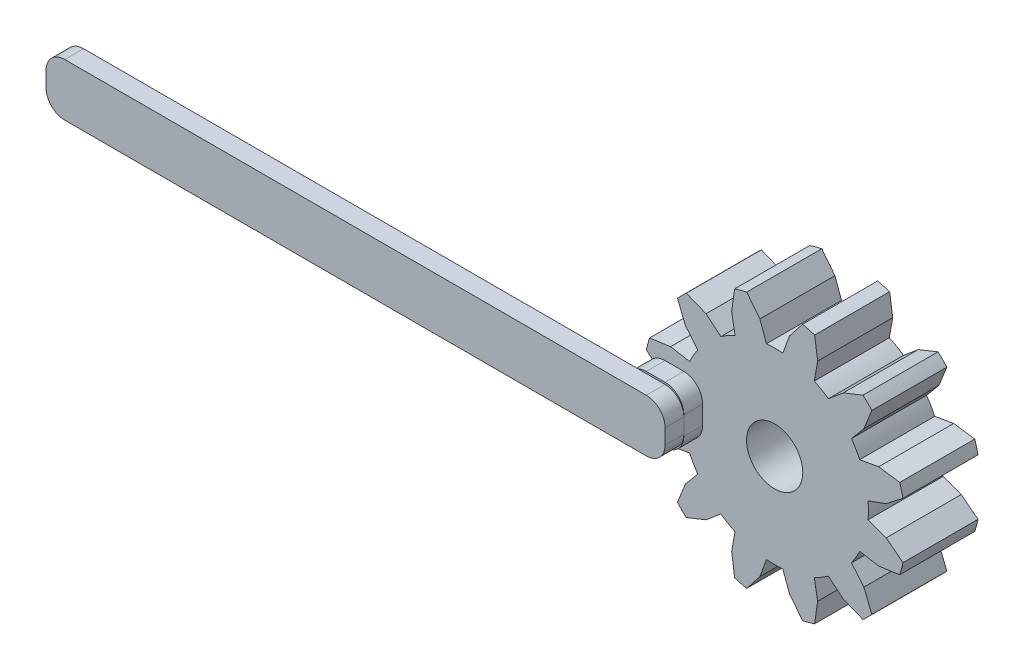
ISO-10303-21;
HEADER;
FILE_DESCRIPTION(('STEP AP214'),'2;1');
FILE_NAME('part.step','',(''),(''),'','','');
FILE_SCHEMA(('AUTOMOTIVE_DESIGN { 1 0 10303 214 1 1 1 1 }'));
ENDSEC;
DATA;
#1=APPLICATION_CONTEXT('core data for automotive mechanical design processes');
#2=APPLICATION_PROTOCOL_DEFINITION('international standard','automotive_design',2000,#1);
#3=PRODUCT_CONTEXT('',#1,'mechanical');
#4=PRODUCT('Part','Part','',(#3));
#5=PRODUCT_RELATED_PRODUCT_CATEGORY('part','',(#4));
#6=PRODUCT_DEFINITION_FORMATION('','',#4);
#7=PRODUCT_DEFINITION_CONTEXT('part definition',#1,'design');
#8=PRODUCT_DEFINITION('design','',#6,#7);
#9=PRODUCT_DEFINITION_SHAPE('','',#8);
#10=(LENGTH_UNIT() NAMED_UNIT(*) SI_UNIT(.MILLI.,.METRE.));
#11=(NAMED_UNIT(*) PLANE_ANGLE_UNIT() SI_UNIT($,.RADIAN.));
#12=(NAMED_UNIT(*) SI_UNIT($,.STERADIAN.) SOLID_ANGLE_UNIT());
#13=UNCERTAINTY_MEASURE_WITH_UNIT(LENGTH_MEASURE(1.E-05),#10,'distance_accuracy_value','');
#14=(GEOMETRIC_REPRESENTATION_CONTEXT(3) GLOBAL_UNCERTAINTY_ASSIGNED_CONTEXT((#13)) GLOBAL_UNIT_ASSIGNED_CONTEXT((#10,
#11,#12)) REPRESENTATION_CONTEXT('',''));
#15=CARTESIAN_POINT('',(0.,0.,0.));
#16=DIRECTION('',(0.,0.,1.));
#17=DIRECTION('',(1.,0.,0.));
#18=AXIS2_PLACEMENT_3D('',#15,#16,#17);
#19=CARTESIAN_POINT('',(-368.400833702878,14.,20.));
#20=DIRECTION('',(1.,0.,0.));
#21=DIRECTION('',(0.,0.,-1.));
#22=AXIS2_PLACEMENT_3D('',#19,#20,#21);
#23=PLANE('',#22);
#24=DIRECTION('',(0.,-1.,0.));
#25=VECTOR('',#24,1.);
#26=CARTESIAN_POINT('',(-368.400833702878,14.,20.));
#27=LINE('',#26,#25);
#28=CARTESIAN_POINT('',(-368.400833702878,4.00000000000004,20.));
#29=VERTEX_POINT('',#28);
#30=CARTESIAN_POINT('',(-368.400833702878,-3.99999999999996,20.));
#31=VERTEX_POINT('',#30);
#32=EDGE_CURVE('E165',#29,#31,#27,.T.);
#33=ORIENTED_EDGE('',*,*,#32,.F.);
#34=DIRECTION('',(0.,0.,-1.));
#35=VECTOR('',#34,1.);
#36=CARTESIAN_POINT('',(-368.400833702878,4.00000000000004,20.));
#37=LINE('',#36,#35);
#38=CARTESIAN_POINT('',(-368.400833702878,4.00000000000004,10.));
#39=VERTEX_POINT('',#38);
#40=EDGE_CURVE('E149',#29,#39,#37,.T.);
#41=ORIENTED_EDGE('',*,*,#40,.T.);
#42=DIRECTION('',(0.,-1.,0.));
#43=VECTOR('',#42,1.);
#44=CARTESIAN_POINT('',(-368.400833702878,14.,10.));
#45=LINE('',#44,#43);
#46=CARTESIAN_POINT('',(-368.400833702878,-3.99999999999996,10.));
#47=VERTEX_POINT('',#46);
#48=EDGE_CURVE('E162',#39,#47,#45,.T.);
#49=ORIENTED_EDGE('',*,*,#48,.T.);
#50=DIRECTION('',(0.,0.,-1.));
#51=VECTOR('',#50,1.);
#52=CARTESIAN_POINT('',(-368.400833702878,-3.99999999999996,20.));
#53=LINE('',#52,#51);
#54=EDGE_CURVE('E168',#47,#31,#53,.F.);
#55=ORIENTED_EDGE('',*,*,#54,.T.);
#56=EDGE_LOOP('',(#33,#41,#49,#55));
#57=FACE_BOUND('',#56,.T.);
#58=ADVANCED_FACE('F62',(#57),#23,.F.);
#59=CARTESIAN_POINT('',(-368.400833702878,-14.,20.));
#60=DIRECTION('',(0.,1.,0.));
#61=DIRECTION('',(-1.,0.,0.));
#62=AXIS2_PLACEMENT_3D('',#59,#60,#61);
#63=PLANE('',#62);
#64=DIRECTION('',(1.,0.,0.));
#65=VECTOR('',#64,1.);
#66=CARTESIAN_POINT('',(-368.400833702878,-14.,10.));
#67=LINE('',#66,#65);
#68=CARTESIAN_POINT('',(-358.400833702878,-14.,10.));
#69=VERTEX_POINT('',#68);
#70=CARTESIAN_POINT('',(-48.400833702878,-14.0000000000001,10.));
#71=VERTEX_POINT('',#70);
#72=EDGE_CURVE('E173',#69,#71,#67,.T.);
#73=ORIENTED_EDGE('',*,*,#72,.T.);
#74=DIRECTION('',(0.,0.,-1.));
#75=VECTOR('',#74,1.);
#76=CARTESIAN_POINT('',(-48.400833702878,-14.0000000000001,20.));
#77=LINE('',#76,#75);
#78=CARTESIAN_POINT('',(-48.400833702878,-14.0000000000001,20.));
#79=VERTEX_POINT('',#78);
#80=EDGE_CURVE('E12',#71,#79,#77,.F.);
#81=ORIENTED_EDGE('',*,*,#80,.T.);
#82=DIRECTION('',(1.,0.,0.));
#83=VECTOR('',#82,1.);
#84=CARTESIAN_POINT('',(-368.400833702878,-14.,20.));
#85=LINE('',#84,#83);
#86=CARTESIAN_POINT('',(-358.400833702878,-14.,20.));
#87=VERTEX_POINT('',#86);
#88=EDGE_CURVE('E227',#87,#79,#85,.T.);
#89=ORIENTED_EDGE('',*,*,#88,.F.);
#90=DIRECTION('',(0.,0.,-1.));
#91=VECTOR('',#90,1.);
#92=CARTESIAN_POINT('',(-358.400833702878,-14.,20.));
#93=LINE('',#92,#91);
#94=EDGE_CURVE('E71',#87,#69,#93,.T.);
#95=ORIENTED_EDGE('',*,*,#94,.T.);
#96=EDGE_LOOP('',(#73,#81,#89,#95));
#97=FACE_BOUND('',#96,.T.);
#98=ADVANCED_FACE('F225',(#97),#63,.F.);
#99=CARTESIAN_POINT('',(-38.400833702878,14.,20.));
#100=DIRECTION('',(-1.,0.,0.));
#101=DIRECTION('',(0.,0.,1.));
#102=AXIS2_PLACEMENT_3D('',#99,#100,#101);
#103=PLANE('',#102);
#104=DIRECTION('',(0.,1.,0.));
#105=VECTOR('',#104,1.);
#106=CARTESIAN_POINT('',(-38.400833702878,14.,10.));
#107=LINE('',#106,#105);
#108=CARTESIAN_POINT('',(-38.400833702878,-4.00000000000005,10.));
#109=VERTEX_POINT('',#108);
#110=CARTESIAN_POINT('',(-38.400833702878,4.00000000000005,10.));
#111=VERTEX_POINT('',#110);
#112=EDGE_CURVE('E180',#109,#111,#107,.T.);
#113=ORIENTED_EDGE('',*,*,#112,.T.);
#114=DIRECTION('',(0.,0.,-1.));
#115=VECTOR('',#114,1.);
#116=CARTESIAN_POINT('',(-38.400833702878,4.00000000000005,20.));
#117=LINE('',#116,#115);
#118=CARTESIAN_POINT('',(-38.400833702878,4.00000000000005,20.));
#119=VERTEX_POINT('',#118);
#120=EDGE_CURVE('E81',#111,#119,#117,.F.);
#121=ORIENTED_EDGE('',*,*,#120,.T.);
#122=DIRECTION('',(0.,1.,0.));
#123=VECTOR('',#122,1.);
#124=CARTESIAN_POINT('',(-38.400833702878,14.,20.));
#125=LINE('',#124,#123);
#126=CARTESIAN_POINT('',(-38.400833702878,-4.00000000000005,20.));
#127=VERTEX_POINT('',#126);
#128=EDGE_CURVE('E235',#127,#119,#125,.T.);
#129=ORIENTED_EDGE('',*,*,#128,.F.);
#130=DIRECTION('',(0.,0.,-1.));
#131=VECTOR('',#130,1.);
#132=CARTESIAN_POINT('',(-38.400833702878,-4.00000000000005,20.));
#133=LINE('',#132,#131);
#134=EDGE_CURVE('E214',#127,#109,#133,.T.);
#135=ORIENTED_EDGE('',*,*,#134,.T.);
#136=EDGE_LOOP('',(#113,#121,#129,#135));
#137=FACE_BOUND('',#136,.T.);
#138=ADVANCED_FACE('F234',(#137),#103,.F.);
#139=CARTESIAN_POINT('',(-368.400833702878,14.,20.));
#140=DIRECTION('',(0.,-1.,0.));
#141=DIRECTION('',(1.,0.,0.));
#142=AXIS2_PLACEMENT_3D('',#139,#140,#141);
#143=PLANE('',#142);
#144=DIRECTION('',(-1.,0.,0.));
#145=VECTOR('',#144,1.);
#146=CARTESIAN_POINT('',(-368.400833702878,14.,10.));
#147=LINE('',#146,#145);
#148=CARTESIAN_POINT('',(-48.400833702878,14.,10.));
#149=VERTEX_POINT('',#148);
#150=CARTESIAN_POINT('',(-358.400833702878,14.,10.));
#151=VERTEX_POINT('',#150);
#152=EDGE_CURVE('E188',#149,#151,#147,.T.);
#153=ORIENTED_EDGE('',*,*,#152,.T.);
#154=DIRECTION('',(0.,0.,-1.));
#155=VECTOR('',#154,1.);
#156=CARTESIAN_POINT('',(-358.400833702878,14.,20.));
#157=LINE('',#156,#155);
#158=CARTESIAN_POINT('',(-358.400833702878,14.,20.));
#159=VERTEX_POINT('',#158);
#160=EDGE_CURVE('E150',#151,#159,#157,.F.);
#161=ORIENTED_EDGE('',*,*,#160,.T.);
#162=DIRECTION('',(-1.,0.,0.));
#163=VECTOR('',#162,1.);
#164=CARTESIAN_POINT('',(-368.400833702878,14.,20.));
#165=LINE('',#164,#163);
#166=CARTESIAN_POINT('',(-48.400833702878,14.,20.));
#167=VERTEX_POINT('',#166);
#168=EDGE_CURVE('E183',#167,#159,#165,.T.);
#169=ORIENTED_EDGE('',*,*,#168,.F.);
#170=DIRECTION('',(0.,0.,-1.));
#171=VECTOR('',#170,1.);
#172=CARTESIAN_POINT('',(-48.400833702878,14.,20.));
#173=LINE('',#172,#171);
#174=EDGE_CURVE('E156',#167,#149,#173,.T.);
#175=ORIENTED_EDGE('',*,*,#174,.T.);
#176=EDGE_LOOP('',(#153,#161,#169,#175));
#177=FACE_BOUND('',#176,.T.);
#178=ADVANCED_FACE('F271',(#177),#143,.F.);
#179=CARTESIAN_POINT('',(0.,0.,20.));
#180=DIRECTION('',(0.,0.,1.));
#181=DIRECTION('',(1.,0.,0.));
#182=AXIS2_PLACEMENT_3D('',#179,#180,#181);
#183=PLANE('',#182);
#184=ORIENTED_EDGE('',*,*,#168,.T.);
#185=CARTESIAN_POINT('',(-358.400833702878,4.00000000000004,20.));
#186=DIRECTION('',(0.,0.,1.));
#187=DIRECTION('',(1.,0.,0.));
#188=AXIS2_PLACEMENT_3D('',#185,#186,#187);
#189=CIRCLE('',#188,10.);
#190=EDGE_CURVE('E211',#159,#29,#189,.T.);
#191=ORIENTED_EDGE('',*,*,#190,.T.);
#192=ORIENTED_EDGE('',*,*,#32,.T.);
#193=CARTESIAN_POINT('',(-358.400833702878,-3.99999999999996,20.));
#194=DIRECTION('',(0.,0.,1.));
#195=DIRECTION('',(1.,0.,0.));
#196=AXIS2_PLACEMENT_3D('',#193,#194,#195);
#197=CIRCLE('',#196,10.);
#198=EDGE_CURVE('E203',#31,#87,#197,.T.);
#199=ORIENTED_EDGE('',*,*,#198,.T.);
#200=ORIENTED_EDGE('',*,*,#88,.T.);
#201=CARTESIAN_POINT('',(-48.400833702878,-4.00000000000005,20.));
#202=DIRECTION('',(0.,0.,1.));
#203=DIRECTION('',(1.,0.,0.));
#204=AXIS2_PLACEMENT_3D('',#201,#202,#203);
#205=CIRCLE('',#204,10.);
#206=EDGE_CURVE('E89',#79,#127,#205,.T.);
#207=ORIENTED_EDGE('',*,*,#206,.T.);
#208=ORIENTED_EDGE('',*,*,#128,.T.);
#209=CARTESIAN_POINT('',(-48.400833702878,4.00000000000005,20.));
#210=DIRECTION('',(0.,0.,1.));
#211=DIRECTION('',(1.,0.,0.));
#212=AXIS2_PLACEMENT_3D('',#209,#210,#211);
#213=CIRCLE('',#212,10.);
#214=EDGE_CURVE('E208',#119,#167,#213,.T.);
#215=ORIENTED_EDGE('',*,*,#214,.T.);
#216=EDGE_LOOP('',(#184,#191,#192,#199,#200,#207,#208,#215));
#217=FACE_BOUND('',#216,.T.);
#218=ADVANCED_FACE('F247',(#217),#183,.T.);
#219=CARTESIAN_POINT('',(0.,0.,10.));
#220=DIRECTION('',(0.,0.,1.));
#221=DIRECTION('',(1.,0.,0.));
#222=AXIS2_PLACEMENT_3D('',#219,#220,#221);
#223=PLANE('',#222);
#224=ORIENTED_EDGE('',*,*,#48,.F.);
#225=CARTESIAN_POINT('',(-358.400833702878,4.00000000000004,10.));
#226=DIRECTION('',(0.,0.,1.));
#227=DIRECTION('',(1.,0.,0.));
#228=AXIS2_PLACEMENT_3D('',#225,#226,#227);
#229=CIRCLE('',#228,10.);
#230=EDGE_CURVE('E145',#39,#151,#229,.F.);
#231=ORIENTED_EDGE('',*,*,#230,.T.);
#232=ORIENTED_EDGE('',*,*,#152,.F.);
#233=CARTESIAN_POINT('',(-48.400833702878,4.00000000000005,10.));
#234=DIRECTION('',(0.,0.,1.));
#235=DIRECTION('',(1.,0.,0.));
#236=AXIS2_PLACEMENT_3D('',#233,#234,#235);
#237=CIRCLE('',#236,10.);
#238=EDGE_CURVE('E157',#149,#111,#237,.F.);
#239=ORIENTED_EDGE('',*,*,#238,.T.);
#240=ORIENTED_EDGE('',*,*,#112,.F.);
#241=CARTESIAN_POINT('',(-48.400833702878,-4.00000000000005,10.));
#242=DIRECTION('',(0.,0.,1.));
#243=DIRECTION('',(1.,0.,0.));
#244=AXIS2_PLACEMENT_3D('',#241,#242,#243);
#245=CIRCLE('',#244,10.);
#246=EDGE_CURVE('E194',#109,#71,#245,.F.);
#247=ORIENTED_EDGE('',*,*,#246,.T.);
#248=ORIENTED_EDGE('',*,*,#72,.F.);
#249=CARTESIAN_POINT('',(-358.400833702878,-3.99999999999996,10.));
#250=DIRECTION('',(0.,0.,1.));
#251=DIRECTION('',(1.,0.,0.));
#252=AXIS2_PLACEMENT_3D('',#249,#250,#251);
#253=CIRCLE('',#252,10.);
#254=EDGE_CURVE('E167',#69,#47,#253,.F.);
#255=ORIENTED_EDGE('',*,*,#254,.T.);
#256=EDGE_LOOP('',(#224,#231,#232,#239,#240,#247,#248,#255));
#257=FACE_BOUND('',#256,.T.);
#258=ADVANCED_FACE('F170',(#257),#223,.F.);
#259=CARTESIAN_POINT('',(-358.400833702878,4.00000000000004,20.));
#260=DIRECTION('',(0.,0.,-1.));
#261=DIRECTION('',(-1.,0.,0.));
#262=AXIS2_PLACEMENT_3D('',#259,#260,#261);
#263=CYLINDRICAL_SURFACE('',#262,10.);
#264=ORIENTED_EDGE('',*,*,#190,.F.);
#265=ORIENTED_EDGE('',*,*,#160,.F.);
#266=ORIENTED_EDGE('',*,*,#230,.F.);
#267=ORIENTED_EDGE('',*,*,#40,.F.);
#268=EDGE_LOOP('',(#264,#265,#266,#267));
#269=FACE_BOUND('',#268,.T.);
#270=ADVANCED_FACE('F148',(#269),#263,.T.);
#271=CARTESIAN_POINT('',(-48.400833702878,4.00000000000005,20.));
#272=DIRECTION('',(0.,0.,-1.));
#273=DIRECTION('',(-1.,0.,0.));
#274=AXIS2_PLACEMENT_3D('',#271,#272,#273);
#275=CYLINDRICAL_SURFACE('',#274,10.);
#276=ORIENTED_EDGE('',*,*,#214,.F.);
#277=ORIENTED_EDGE('',*,*,#120,.F.);
#278=ORIENTED_EDGE('',*,*,#238,.F.);
#279=ORIENTED_EDGE('',*,*,#174,.F.);
#280=EDGE_LOOP('',(#276,#277,#278,#279));
#281=FACE_BOUND('',#280,.T.);
#282=ADVANCED_FACE('F252',(#281),#275,.T.);
#283=CARTESIAN_POINT('',(-48.400833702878,-4.00000000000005,20.));
#284=DIRECTION('',(0.,0.,-1.));
#285=DIRECTION('',(-1.,0.,0.));
#286=AXIS2_PLACEMENT_3D('',#283,#284,#285);
#287=CYLINDRICAL_SURFACE('',#286,10.);
#288=ORIENTED_EDGE('',*,*,#206,.F.);
#289=ORIENTED_EDGE('',*,*,#80,.F.);
#290=ORIENTED_EDGE('',*,*,#246,.F.);
#291=ORIENTED_EDGE('',*,*,#134,.F.);
#292=EDGE_LOOP('',(#288,#289,#290,#291));
#293=FACE_BOUND('',#292,.T.);
#294=ADVANCED_FACE('F233',(#293),#287,.T.);
#295=CARTESIAN_POINT('',(-358.400833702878,-3.99999999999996,20.));
#296=DIRECTION('',(0.,0.,-1.));
#297=DIRECTION('',(-1.,0.,0.));
#298=AXIS2_PLACEMENT_3D('',#295,#296,#297);
#299=CYLINDRICAL_SURFACE('',#298,10.);
#300=ORIENTED_EDGE('',*,*,#198,.F.);
#301=ORIENTED_EDGE('',*,*,#54,.F.);
#302=ORIENTED_EDGE('',*,*,#254,.F.);
#303=ORIENTED_EDGE('',*,*,#94,.F.);
#304=EDGE_LOOP('',(#300,#301,#302,#303));
#305=FACE_BOUND('',#304,.T.);
#306=ADVANCED_FACE('F64',(#305),#299,.T.);
#307=CLOSED_SHELL('',(#58,#98,#138,#178,#218,#258,#270,#282,#294,#306));
#308=MANIFOLD_SOLID_BREP('B2',#307);
#309=CARTESIAN_POINT('',(-68.400833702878,15.,10.));
#310=DIRECTION('',(1.,0.,0.));
#311=DIRECTION('',(0.,0.,-1.));
#312=AXIS2_PLACEMENT_3D('',#309,#310,#311);
#313=PLANE('',#312);
#314=DIRECTION('',(0.,-1.,0.));
#315=VECTOR('',#314,1.);
#316=CARTESIAN_POINT('',(-68.400833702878,15.,10.));
#317=LINE('',#316,#315);
#318=CARTESIAN_POINT('',(-68.400833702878,4.99999999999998,10.));
#319=VERTEX_POINT('',#318);
#320=CARTESIAN_POINT('',(-68.400833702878,-5.00000000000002,10.));
#321=VERTEX_POINT('',#320);
#322=EDGE_CURVE('E497',#319,#321,#317,.T.);
#323=ORIENTED_EDGE('',*,*,#322,.F.);
#324=DIRECTION('',(0.,0.,-1.));
#325=VECTOR('',#324,1.);
#326=CARTESIAN_POINT('',(-68.400833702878,4.99999999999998,10.));
#327=LINE('',#326,#325);
#328=CARTESIAN_POINT('',(-68.400833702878,4.99999999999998,0.));
#329=VERTEX_POINT('',#328);
#330=EDGE_CURVE('E481',#319,#329,#327,.T.);
#331=ORIENTED_EDGE('',*,*,#330,.T.);
#332=DIRECTION('',(0.,-1.,0.));
#333=VECTOR('',#332,1.);
#334=CARTESIAN_POINT('',(-68.400833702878,15.,0.));
#335=LINE('',#334,#333);
#336=CARTESIAN_POINT('',(-68.400833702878,-5.00000000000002,0.));
#337=VERTEX_POINT('',#336);
#338=EDGE_CURVE('E494',#329,#337,#335,.T.);
#339=ORIENTED_EDGE('',*,*,#338,.T.);
#340=DIRECTION('',(0.,0.,-1.));
#341=VECTOR('',#340,1.);
#342=CARTESIAN_POINT('',(-68.400833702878,-5.00000000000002,10.));
#343=LINE('',#342,#341);
#344=EDGE_CURVE('E500',#337,#321,#343,.F.);
#345=ORIENTED_EDGE('',*,*,#344,.T.);
#346=EDGE_LOOP('',(#323,#331,#339,#345));
#347=FACE_BOUND('',#346,.T.);
#348=ADVANCED_FACE('F410',(#347),#313,.F.);
#349=CARTESIAN_POINT('',(-38.400833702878,-15.,10.));
#350=DIRECTION('',(0.,1.,0.));
#351=DIRECTION('',(-1.,0.,0.));
#352=AXIS2_PLACEMENT_3D('',#349,#350,#351);
#353=PLANE('',#352);
#354=DIRECTION('',(1.,0.,0.));
#355=VECTOR('',#354,1.);
#356=CARTESIAN_POINT('',(-38.400833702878,-15.,0.));
#357=LINE('',#356,#355);
#358=CARTESIAN_POINT('',(-58.400833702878,-15.,0.));
#359=VERTEX_POINT('',#358);
#360=CARTESIAN_POINT('',(-48.400833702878,-15.,0.));
#361=VERTEX_POINT('',#360);
#362=EDGE_CURVE('E505',#359,#361,#357,.T.);
#363=ORIENTED_EDGE('',*,*,#362,.T.);
#364=DIRECTION('',(0.,0.,-1.));
#365=VECTOR('',#364,1.);
#366=CARTESIAN_POINT('',(-48.400833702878,-15.,10.));
#367=LINE('',#366,#365);
#368=CARTESIAN_POINT('',(-48.400833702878,-15.,10.));
#369=VERTEX_POINT('',#368);
#370=EDGE_CURVE('E60',#361,#369,#367,.F.);
#371=ORIENTED_EDGE('',*,*,#370,.T.);
#372=DIRECTION('',(1.,0.,0.));
#373=VECTOR('',#372,1.);
#374=CARTESIAN_POINT('',(-38.400833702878,-15.,10.));
#375=LINE('',#374,#373);
#376=CARTESIAN_POINT('',(-58.400833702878,-15.,10.));
#377=VERTEX_POINT('',#376);
#378=EDGE_CURVE('E559',#377,#369,#375,.T.);
#379=ORIENTED_EDGE('',*,*,#378,.F.);
#380=DIRECTION('',(0.,0.,-1.));
#381=VECTOR('',#380,1.);
#382=CARTESIAN_POINT('',(-58.400833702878,-15.,10.));
#383=LINE('',#382,#381);
#384=EDGE_CURVE('E419',#377,#359,#383,.T.);
#385=ORIENTED_EDGE('',*,*,#384,.T.);
#386=EDGE_LOOP('',(#363,#371,#379,#385));
#387=FACE_BOUND('',#386,.T.);
#388=ADVANCED_FACE('F557',(#387),#353,.F.);
#389=CARTESIAN_POINT('',(-38.400833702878,15.,10.));
#390=DIRECTION('',(-1.,0.,0.));
#391=DIRECTION('',(0.,-1.,0.));
#392=AXIS2_PLACEMENT_3D('',#389,#390,#391);
#393=PLANE('',#392);
#394=DIRECTION('',(0.,1.,0.));
#395=VECTOR('',#394,1.);
#396=CARTESIAN_POINT('',(-38.400833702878,15.,0.));
#397=LINE('',#396,#395);
#398=CARTESIAN_POINT('',(-38.400833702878,-5.00000000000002,0.));
#399=VERTEX_POINT('',#398);
#400=CARTESIAN_POINT('',(-38.400833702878,4.99999999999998,0.));
#401=VERTEX_POINT('',#400);
#402=EDGE_CURVE('E510',#399,#401,#397,.T.);
#403=ORIENTED_EDGE('',*,*,#402,.T.);
#404=DIRECTION('',(0.,0.,-1.));
#405=VECTOR('',#404,1.);
#406=CARTESIAN_POINT('',(-38.400833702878,4.99999999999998,10.));
#407=LINE('',#406,#405);
#408=CARTESIAN_POINT('',(-38.400833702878,4.99999999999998,10.));
#409=VERTEX_POINT('',#408);
#410=EDGE_CURVE('E426',#401,#409,#407,.F.);
#411=ORIENTED_EDGE('',*,*,#410,.T.);
#412=DIRECTION('',(0.,1.,0.));
#413=VECTOR('',#412,1.);
#414=CARTESIAN_POINT('',(-38.400833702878,15.,10.));
#415=LINE('',#414,#413);
#416=CARTESIAN_POINT('',(-38.400833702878,-5.00000000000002,10.));
#417=VERTEX_POINT('',#416);
#418=EDGE_CURVE('E567',#417,#409,#415,.T.);
#419=ORIENTED_EDGE('',*,*,#418,.F.);
#420=DIRECTION('',(0.,0.,-1.));
#421=VECTOR('',#420,1.);
#422=CARTESIAN_POINT('',(-38.400833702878,-5.00000000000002,10.));
#423=LINE('',#422,#421);
#424=EDGE_CURVE('E546',#417,#399,#423,.T.);
#425=ORIENTED_EDGE('',*,*,#424,.T.);
#426=EDGE_LOOP('',(#403,#411,#419,#425));
#427=FACE_BOUND('',#426,.T.);
#428=ADVANCED_FACE('F566',(#427),#393,.F.);
#429=CARTESIAN_POINT('',(-38.400833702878,15.,10.));
#430=DIRECTION('',(0.,-1.,0.));
#431=DIRECTION('',(1.,0.,0.));
#432=AXIS2_PLACEMENT_3D('',#429,#430,#431);
#433=PLANE('',#432);
#434=DIRECTION('',(-1.,0.,0.));
#435=VECTOR('',#434,1.);
#436=CARTESIAN_POINT('',(-38.400833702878,15.,0.));
#437=LINE('',#436,#435);
#438=CARTESIAN_POINT('',(-48.400833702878,15.,0.));
#439=VERTEX_POINT('',#438);
#440=CARTESIAN_POINT('',(-58.400833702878,15.,0.));
#441=VERTEX_POINT('',#440);
#442=EDGE_CURVE('E518',#439,#441,#437,.T.);
#443=ORIENTED_EDGE('',*,*,#442,.T.);
#444=DIRECTION('',(0.,0.,-1.));
#445=VECTOR('',#444,1.);
#446=CARTESIAN_POINT('',(-58.400833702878,15.,10.));
#447=LINE('',#446,#445);
#448=CARTESIAN_POINT('',(-58.400833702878,15.,10.));
#449=VERTEX_POINT('',#448);
#450=EDGE_CURVE('E482',#441,#449,#447,.F.);
#451=ORIENTED_EDGE('',*,*,#450,.T.);
#452=DIRECTION('',(-1.,0.,0.));
#453=VECTOR('',#452,1.);
#454=CARTESIAN_POINT('',(-38.400833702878,15.,10.));
#455=LINE('',#454,#453);
#456=CARTESIAN_POINT('',(-48.400833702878,15.,10.));
#457=VERTEX_POINT('',#456);
#458=EDGE_CURVE('E513',#457,#449,#455,.T.);
#459=ORIENTED_EDGE('',*,*,#458,.F.);
#460=DIRECTION('',(0.,0.,-1.));
#461=VECTOR('',#460,1.);
#462=CARTESIAN_POINT('',(-48.400833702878,15.,10.));
#463=LINE('',#462,#461);
#464=EDGE_CURVE('E488',#457,#439,#463,.T.);
#465=ORIENTED_EDGE('',*,*,#464,.T.);
#466=EDGE_LOOP('',(#443,#451,#459,#465));
#467=FACE_BOUND('',#466,.T.);
#468=ADVANCED_FACE('F601',(#467),#433,.F.);
#469=CARTESIAN_POINT('',(0.,0.,10.));
#470=DIRECTION('',(0.,0.,-1.));
#471=DIRECTION('',(-1.,0.,0.));
#472=AXIS2_PLACEMENT_3D('',#469,#470,#471);
#473=PLANE('',#472);
#474=ORIENTED_EDGE('',*,*,#458,.T.);
#475=CARTESIAN_POINT('',(-58.400833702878,4.99999999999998,10.));
#476=DIRECTION('',(0.,0.,-1.));
#477=DIRECTION('',(-1.,0.,0.));
#478=AXIS2_PLACEMENT_3D('',#475,#476,#477);
#479=CIRCLE('',#478,10.);
#480=EDGE_CURVE('E543',#449,#319,#479,.F.);
#481=ORIENTED_EDGE('',*,*,#480,.T.);
#482=ORIENTED_EDGE('',*,*,#322,.T.);
#483=CARTESIAN_POINT('',(-58.400833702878,-5.00000000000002,10.));
#484=DIRECTION('',(0.,0.,-1.));
#485=DIRECTION('',(-1.,0.,0.));
#486=AXIS2_PLACEMENT_3D('',#483,#484,#485);
#487=CIRCLE('',#486,10.);
#488=EDGE_CURVE('E535',#321,#377,#487,.F.);
#489=ORIENTED_EDGE('',*,*,#488,.T.);
#490=ORIENTED_EDGE('',*,*,#378,.T.);
#491=CARTESIAN_POINT('',(-48.400833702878,-5.00000000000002,10.));
#492=DIRECTION('',(0.,0.,-1.));
#493=DIRECTION('',(-1.,0.,0.));
#494=AXIS2_PLACEMENT_3D('',#491,#492,#493);
#495=CIRCLE('',#494,10.);
#496=EDGE_CURVE('E433',#369,#417,#495,.F.);
#497=ORIENTED_EDGE('',*,*,#496,.T.);
#498=ORIENTED_EDGE('',*,*,#418,.T.);
#499=CARTESIAN_POINT('',(-48.400833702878,4.99999999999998,10.));
#500=DIRECTION('',(0.,0.,-1.));
#501=DIRECTION('',(-1.,0.,0.));
#502=AXIS2_PLACEMENT_3D('',#499,#500,#501);
#503=CIRCLE('',#502,10.);
#504=EDGE_CURVE('E540',#409,#457,#503,.F.);
#505=ORIENTED_EDGE('',*,*,#504,.T.);
#506=EDGE_LOOP('',(#474,#481,#482,#489,#490,#497,#498,#505));
#507=FACE_BOUND('',#506,.T.);
#508=ADVANCED_FACE('F578',(#507),#473,.F.);
#509=CARTESIAN_POINT('',(0.,0.,0.));
#510=DIRECTION('',(0.,0.,-1.));
#511=DIRECTION('',(-1.,0.,0.));
#512=AXIS2_PLACEMENT_3D('',#509,#510,#511);
#513=PLANE('',#512);
#514=ORIENTED_EDGE('',*,*,#338,.F.);
#515=CARTESIAN_POINT('',(-58.400833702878,4.99999999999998,0.));
#516=DIRECTION('',(0.,0.,-1.));
#517=DIRECTION('',(-1.,0.,0.));
#518=AXIS2_PLACEMENT_3D('',#515,#516,#517);
#519=CIRCLE('',#518,10.);
#520=EDGE_CURVE('E477',#329,#441,#519,.T.);
#521=ORIENTED_EDGE('',*,*,#520,.T.);
#522=ORIENTED_EDGE('',*,*,#442,.F.);
#523=CARTESIAN_POINT('',(-48.400833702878,4.99999999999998,0.));
#524=DIRECTION('',(0.,0.,-1.));
#525=DIRECTION('',(-1.,0.,0.));
#526=AXIS2_PLACEMENT_3D('',#523,#524,#525);
#527=CIRCLE('',#526,10.);
#528=EDGE_CURVE('E489',#439,#401,#527,.T.);
#529=ORIENTED_EDGE('',*,*,#528,.T.);
#530=ORIENTED_EDGE('',*,*,#402,.F.);
#531=CARTESIAN_POINT('',(-48.400833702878,-5.00000000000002,0.));
#532=DIRECTION('',(0.,0.,-1.));
#533=DIRECTION('',(-1.,0.,0.));
#534=AXIS2_PLACEMENT_3D('',#531,#532,#533);
#535=CIRCLE('',#534,10.);
#536=EDGE_CURVE('E525',#399,#361,#535,.T.);
#537=ORIENTED_EDGE('',*,*,#536,.T.);
#538=ORIENTED_EDGE('',*,*,#362,.F.);
#539=CARTESIAN_POINT('',(-58.400833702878,-5.00000000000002,0.));
#540=DIRECTION('',(0.,0.,-1.));
#541=DIRECTION('',(-1.,0.,0.));
#542=AXIS2_PLACEMENT_3D('',#539,#540,#541);
#543=CIRCLE('',#542,10.);
#544=EDGE_CURVE('E499',#359,#337,#543,.T.);
#545=ORIENTED_EDGE('',*,*,#544,.T.);
#546=EDGE_LOOP('',(#514,#521,#522,#529,#530,#537,#538,#545));
#547=FACE_BOUND('',#546,.T.);
#548=ADVANCED_FACE('F502',(#547),#513,.T.);
#549=CARTESIAN_POINT('',(-58.400833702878,4.99999999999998,10.));
#550=DIRECTION('',(0.,0.,-1.));
#551=DIRECTION('',(-1.,0.,0.));
#552=AXIS2_PLACEMENT_3D('',#549,#550,#551);
#553=CYLINDRICAL_SURFACE('',#552,10.);
#554=ORIENTED_EDGE('',*,*,#480,.F.);
#555=ORIENTED_EDGE('',*,*,#450,.F.);
#556=ORIENTED_EDGE('',*,*,#520,.F.);
#557=ORIENTED_EDGE('',*,*,#330,.F.);
#558=EDGE_LOOP('',(#554,#555,#556,#557));
#559=FACE_BOUND('',#558,.T.);
#560=ADVANCED_FACE('F480',(#559),#553,.T.);
#561=CARTESIAN_POINT('',(-48.400833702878,4.99999999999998,10.));
#562=DIRECTION('',(0.,0.,-1.));
#563=DIRECTION('',(-1.,0.,0.));
#564=AXIS2_PLACEMENT_3D('',#561,#562,#563);
#565=CYLINDRICAL_SURFACE('',#564,10.);
#566=ORIENTED_EDGE('',*,*,#504,.F.);
#567=ORIENTED_EDGE('',*,*,#410,.F.);
#568=ORIENTED_EDGE('',*,*,#528,.F.);
#569=ORIENTED_EDGE('',*,*,#464,.F.);
#570=EDGE_LOOP('',(#566,#567,#568,#569));
#571=FACE_BOUND('',#570,.T.);
#572=ADVANCED_FACE('F583',(#571),#565,.T.);
#573=CARTESIAN_POINT('',(-48.400833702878,-5.00000000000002,10.));
#574=DIRECTION('',(0.,0.,-1.));
#575=DIRECTION('',(-1.,0.,0.));
#576=AXIS2_PLACEMENT_3D('',#573,#574,#575);
#577=CYLINDRICAL_SURFACE('',#576,10.);
#578=ORIENTED_EDGE('',*,*,#496,.F.);
#579=ORIENTED_EDGE('',*,*,#370,.F.);
#580=ORIENTED_EDGE('',*,*,#536,.F.);
#581=ORIENTED_EDGE('',*,*,#424,.F.);
#582=EDGE_LOOP('',(#578,#579,#580,#581));
#583=FACE_BOUND('',#582,.T.);
#584=ADVANCED_FACE('F565',(#583),#577,.T.);
#585=CARTESIAN_POINT('',(-58.400833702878,-5.00000000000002,10.));
#586=DIRECTION('',(0.,0.,-1.));
#587=DIRECTION('',(-1.,0.,0.));
#588=AXIS2_PLACEMENT_3D('',#585,#586,#587);
#589=CYLINDRICAL_SURFACE('',#588,10.);
#590=ORIENTED_EDGE('',*,*,#488,.F.);
#591=ORIENTED_EDGE('',*,*,#344,.F.);
#592=ORIENTED_EDGE('',*,*,#544,.F.);
#593=ORIENTED_EDGE('',*,*,#384,.F.);
#594=EDGE_LOOP('',(#590,#591,#592,#593));
#595=FACE_BOUND('',#594,.T.);
#596=ADVANCED_FACE('F412',(#595),#589,.T.);
#597=CLOSED_SHELL('',(#348,#388,#428,#468,#508,#548,#560,#572,#584,#596));
#598=MANIFOLD_SOLID_BREP('B6',#597);
#599=CARTESIAN_POINT('',(9.16489106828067E-11,1.66984481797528E-11,-40.));
#600=DIRECTION('',(0.,0.,1.));
#601=DIRECTION('',(1.,0.,0.));
#602=AXIS2_PLACEMENT_3D('',#599,#600,#601);
#603=CYLINDRICAL_SURFACE('',#602,69.9999999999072);
#604=CARTESIAN_POINT('',(9.16489106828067E-11,1.66984481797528E-11,0.));
#605=DIRECTION('',(0.,0.,1.));
#606=DIRECTION('',(1.,0.,0.));
#607=AXIS2_PLACEMENT_3D('',#604,#605,#606);
#608=CIRCLE('',#607,69.9999999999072);
#609=CARTESIAN_POINT('',(68.400833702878,14.877027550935,0.));
#610=VERTEX_POINT('',#609);
#611=CARTESIAN_POINT('',(66.675373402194,21.316533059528,0.));
#612=VERTEX_POINT('',#611);
#613=EDGE_CURVE('E1339',#610,#612,#608,.T.);
#614=ORIENTED_EDGE('',*,*,#613,.F.);
#615=DIRECTION('',(0.,0.,1.));
#616=VECTOR('',#615,1.);
#617=CARTESIAN_POINT('',(68.400833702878,14.877027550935,-40.));
#618=LINE('',#617,#616);
#619=CARTESIAN_POINT('',(68.400833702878,14.877027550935,-40.));
#620=VERTEX_POINT('',#619);
#621=EDGE_CURVE('E408',#620,#610,#618,.T.);
#622=ORIENTED_EDGE('',*,*,#621,.F.);
#623=CARTESIAN_POINT('',(9.16489106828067E-11,1.66984481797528E-11,-40.));
#624=DIRECTION('',(0.,0.,1.));
#625=DIRECTION('',(1.,0.,0.));
#626=AXIS2_PLACEMENT_3D('',#623,#624,#625);
#627=CIRCLE('',#626,69.9999999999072);
#628=CARTESIAN_POINT('',(66.675373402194,21.316533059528,-40.));
#629=VERTEX_POINT('',#628);
#630=EDGE_CURVE('E1624',#620,#629,#627,.T.);
#631=ORIENTED_EDGE('',*,*,#630,.T.);
#632=DIRECTION('',(0.,0.,1.));
#633=VECTOR('',#632,1.);
#634=CARTESIAN_POINT('',(66.675373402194,21.316533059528,-40.));
#635=LINE('',#634,#633);
#636=EDGE_CURVE('E709',#629,#612,#635,.T.);
#637=ORIENTED_EDGE('',*,*,#636,.T.);
#638=EDGE_LOOP('',(#614,#622,#631,#637));
#639=FACE_BOUND('',#638,.T.);
#640=ADVANCED_FACE('F706',(#639),#603,.T.);
#641=CARTESIAN_POINT('',(59.480601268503,7.8776946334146,-40.));
#642=DIRECTION('',(0.617307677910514,-0.78672182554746,0.));
#643=DIRECTION('',(0.786721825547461,0.617307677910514,0.));
#644=AXIS2_PLACEMENT_3D('',#641,#642,#643);
#645=PLANE('',#644);
#646=DIRECTION('',(0.78672182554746,0.617307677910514,0.));
#647=VECTOR('',#646,1.);
#648=CARTESIAN_POINT('',(59.480601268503,7.8776946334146,0.));
#649=LINE('',#648,#647);
#650=CARTESIAN_POINT('',(59.480601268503,7.8776946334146,0.));
#651=VERTEX_POINT('',#650);
#652=EDGE_CURVE('E1621',#651,#610,#649,.T.);
#653=ORIENTED_EDGE('',*,*,#652,.F.);
#654=DIRECTION('',(0.,0.,1.));
#655=VECTOR('',#654,1.);
#656=CARTESIAN_POINT('',(59.480601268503,7.8776946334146,-40.));
#657=LINE('',#656,#655);
#658=CARTESIAN_POINT('',(59.480601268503,7.8776946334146,-40.));
#659=VERTEX_POINT('',#658);
#660=EDGE_CURVE('E716',#659,#651,#657,.T.);
#661=ORIENTED_EDGE('',*,*,#660,.F.);
#662=DIRECTION('',(0.78672182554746,0.617307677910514,0.));
#663=VECTOR('',#662,1.);
#664=CARTESIAN_POINT('',(59.480601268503,7.8776946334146,-40.));
#665=LINE('',#664,#663);
#666=EDGE_CURVE('E1323',#659,#620,#665,.T.);
#667=ORIENTED_EDGE('',*,*,#666,.T.);
#668=ORIENTED_EDGE('',*,*,#621,.T.);
#669=EDGE_LOOP('',(#653,#661,#667,#668));
#670=FACE_BOUND('',#669,.T.);
#671=ADVANCED_FACE('F1838',(#670),#645,.T.);
#672=CARTESIAN_POINT('',(49.809734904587,4.35778713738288,-40.));
#673=DIRECTION('',(0.342020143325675,-0.939692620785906,0.));
#674=DIRECTION('',(0.939692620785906,0.342020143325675,0.));
#675=AXIS2_PLACEMENT_3D('',#672,#673,#674);
#676=PLANE('',#675);
#677=DIRECTION('',(0.939692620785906,0.342020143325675,0.));
#678=VECTOR('',#677,1.);
#679=CARTESIAN_POINT('',(49.809734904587,4.35778713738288,0.));
#680=LINE('',#679,#678);
#681=CARTESIAN_POINT('',(49.809734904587,4.35778713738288,0.));
#682=VERTEX_POINT('',#681);
#683=EDGE_CURVE('E1309',#682,#651,#680,.T.);
#684=ORIENTED_EDGE('',*,*,#683,.F.);
#685=DIRECTION('',(0.,0.,1.));
#686=VECTOR('',#685,1.);
#687=CARTESIAN_POINT('',(49.809734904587,4.35778713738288,-40.));
#688=LINE('',#687,#686);
#689=CARTESIAN_POINT('',(49.809734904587,4.35778713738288,-40.));
#690=VERTEX_POINT('',#689);
#691=EDGE_CURVE('E1304',#690,#682,#688,.T.);
#692=ORIENTED_EDGE('',*,*,#691,.F.);
#693=DIRECTION('',(0.939692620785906,0.342020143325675,0.));
#694=VECTOR('',#693,1.);
#695=CARTESIAN_POINT('',(49.809734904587,4.35778713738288,-40.));
#696=LINE('',#695,#694);
#697=EDGE_CURVE('E1307',#690,#659,#696,.T.);
#698=ORIENTED_EDGE('',*,*,#697,.T.);
#699=ORIENTED_EDGE('',*,*,#660,.T.);
#700=EDGE_LOOP('',(#684,#692,#698,#699));
#701=FACE_BOUND('',#700,.T.);
#702=ADVANCED_FACE('F1306',(#701),#676,.T.);
#703=CARTESIAN_POINT('',(0.,0.,-40.));
#704=DIRECTION('',(0.,0.,1.));
#705=DIRECTION('',(1.,0.,0.));
#706=AXIS2_PLACEMENT_3D('',#703,#704,#705);
#707=CYLINDRICAL_SURFACE('',#706,49.9999999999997);
#708=CARTESIAN_POINT('',(0.,0.,0.));
#709=DIRECTION('',(0.,0.,1.));
#710=DIRECTION('',(1.,0.,0.));
#711=AXIS2_PLACEMENT_3D('',#708,#709,#710);
#712=CIRCLE('',#711,49.9999999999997);
#713=CARTESIAN_POINT('',(49.809734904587,-4.35778713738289,0.));
#714=VERTEX_POINT('',#713);
#715=EDGE_CURVE('E1616',#714,#682,#712,.T.);
#716=ORIENTED_EDGE('',*,*,#715,.F.);
#717=DIRECTION('',(0.,0.,1.));
#718=VECTOR('',#717,1.);
#719=CARTESIAN_POINT('',(49.809734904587,-4.35778713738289,-40.));
#720=LINE('',#719,#718);
#721=CARTESIAN_POINT('',(49.809734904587,-4.35778713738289,-40.));
#722=VERTEX_POINT('',#721);
#723=EDGE_CURVE('E1315',#722,#714,#720,.T.);
#724=ORIENTED_EDGE('',*,*,#723,.F.);
#725=CARTESIAN_POINT('',(0.,0.,-40.));
#726=DIRECTION('',(0.,0.,1.));
#727=DIRECTION('',(1.,0.,0.));
#728=AXIS2_PLACEMENT_3D('',#725,#726,#727);
#729=CIRCLE('',#728,49.9999999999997);
#730=EDGE_CURVE('E1321',#722,#690,#729,.T.);
#731=ORIENTED_EDGE('',*,*,#730,.T.);
#732=ORIENTED_EDGE('',*,*,#691,.T.);
#733=EDGE_LOOP('',(#716,#724,#731,#732));
#734=FACE_BOUND('',#733,.T.);
#735=ADVANCED_FACE('F1326',(#734),#707,.T.);
#736=CARTESIAN_POINT('',(59.480601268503,-7.8776946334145,-40.));
#737=DIRECTION('',(0.342020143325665,0.93969262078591,0.));
#738=DIRECTION('',(-0.93969262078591,0.342020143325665,0.));
#739=AXIS2_PLACEMENT_3D('',#736,#737,#738);
#740=PLANE('',#739);
#741=DIRECTION('',(-0.93969262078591,0.342020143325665,0.));
#742=VECTOR('',#741,1.);
#743=CARTESIAN_POINT('',(59.480601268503,-7.8776946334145,0.));
#744=LINE('',#743,#742);
#745=CARTESIAN_POINT('',(59.480601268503,-7.8776946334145,0.));
#746=VERTEX_POINT('',#745);
#747=EDGE_CURVE('E1612',#746,#714,#744,.T.);
#748=ORIENTED_EDGE('',*,*,#747,.F.);
#749=DIRECTION('',(0.,0.,1.));
#750=VECTOR('',#749,1.);
#751=CARTESIAN_POINT('',(59.480601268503,-7.8776946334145,-40.));
#752=LINE('',#751,#750);
#753=CARTESIAN_POINT('',(59.480601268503,-7.8776946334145,-40.));
#754=VERTEX_POINT('',#753);
#755=EDGE_CURVE('E1630',#754,#746,#752,.T.);
#756=ORIENTED_EDGE('',*,*,#755,.F.);
#757=DIRECTION('',(-0.93969262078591,0.342020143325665,0.));
#758=VECTOR('',#757,1.);
#759=CARTESIAN_POINT('',(59.480601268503,-7.8776946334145,-40.));
#760=LINE('',#759,#758);
#761=EDGE_CURVE('E1328',#754,#722,#760,.T.);
#762=ORIENTED_EDGE('',*,*,#761,.T.);
#763=ORIENTED_EDGE('',*,*,#723,.T.);
#764=EDGE_LOOP('',(#748,#756,#762,#763));
#765=FACE_BOUND('',#764,.T.);
#766=ADVANCED_FACE('F1851',(#765),#740,.T.);
#767=CARTESIAN_POINT('',(68.400833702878,-14.877027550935,-40.));
#768=DIRECTION('',(0.617307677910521,0.786721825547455,0.));
#769=DIRECTION('',(-0.786721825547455,0.617307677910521,0.));
#770=AXIS2_PLACEMENT_3D('',#767,#768,#769);
#771=PLANE('',#770);
#772=DIRECTION('',(-0.786721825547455,0.617307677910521,0.));
#773=VECTOR('',#772,1.);
#774=CARTESIAN_POINT('',(68.400833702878,-14.877027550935,0.));
#775=LINE('',#774,#773);
#776=CARTESIAN_POINT('',(68.400833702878,-14.877027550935,0.));
#777=VERTEX_POINT('',#776);
#778=EDGE_CURVE('E1608',#777,#746,#775,.T.);
#779=ORIENTED_EDGE('',*,*,#778,.F.);
#780=DIRECTION('',(0.,0.,1.));
#781=VECTOR('',#780,1.);
#782=CARTESIAN_POINT('',(68.400833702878,-14.877027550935,-40.));
#783=LINE('',#782,#781);
#784=CARTESIAN_POINT('',(68.400833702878,-14.877027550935,-40.));
#785=VERTEX_POINT('',#784);
#786=EDGE_CURVE('E1633',#785,#777,#783,.T.);
#787=ORIENTED_EDGE('',*,*,#786,.F.);
#788=DIRECTION('',(-0.786721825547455,0.617307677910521,0.));
#789=VECTOR('',#788,1.);
#790=CARTESIAN_POINT('',(68.400833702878,-14.877027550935,-40.));
#791=LINE('',#790,#789);
#792=EDGE_CURVE('E1333',#785,#754,#791,.T.);
#793=ORIENTED_EDGE('',*,*,#792,.T.);
#794=ORIENTED_EDGE('',*,*,#755,.T.);
#795=EDGE_LOOP('',(#779,#787,#793,#794));
#796=FACE_BOUND('',#795,.T.);
#797=ADVANCED_FACE('F1854',(#796),#771,.T.);
#798=CARTESIAN_POINT('',(9.16627884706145E-11,-1.67019176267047E-11,-40.));
#799=DIRECTION('',(0.,0.,1.));
#800=DIRECTION('',(1.,0.,0.));
#801=AXIS2_PLACEMENT_3D('',#798,#799,#800);
#802=CYLINDRICAL_SURFACE('',#801,69.9999999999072);
#803=CARTESIAN_POINT('',(9.16627884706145E-11,-1.67019176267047E-11,0.));
#804=DIRECTION('',(0.,0.,1.));
#805=DIRECTION('',(1.,0.,0.));
#806=AXIS2_PLACEMENT_3D('',#803,#804,#805);
#807=CIRCLE('',#806,69.9999999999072);
#808=CARTESIAN_POINT('',(66.675373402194,-21.316533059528,0.));
#809=VERTEX_POINT('',#808);
#810=EDGE_CURVE('E1604',#809,#777,#807,.T.);
#811=ORIENTED_EDGE('',*,*,#810,.F.);
#812=DIRECTION('',(0.,0.,1.));
#813=VECTOR('',#812,1.);
#814=CARTESIAN_POINT('',(66.675373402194,-21.316533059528,-40.));
#815=LINE('',#814,#813);
#816=CARTESIAN_POINT('',(66.675373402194,-21.316533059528,-40.));
#817=VERTEX_POINT('',#816);
#818=EDGE_CURVE('E1636',#817,#809,#815,.T.);
#819=ORIENTED_EDGE('',*,*,#818,.F.);
#820=CARTESIAN_POINT('',(9.16627884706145E-11,-1.67019176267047E-11,-40.));
#821=DIRECTION('',(0.,0.,1.));
#822=DIRECTION('',(1.,0.,0.));
#823=AXIS2_PLACEMENT_3D('',#820,#821,#822);
#824=CIRCLE('',#823,69.9999999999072);
#825=EDGE_CURVE('E2404',#817,#785,#824,.T.);
#826=ORIENTED_EDGE('',*,*,#825,.T.);
#827=ORIENTED_EDGE('',*,*,#786,.T.);
#828=EDGE_LOOP('',(#811,#819,#826,#827));
#829=FACE_BOUND('',#828,.T.);
#830=ADVANCED_FACE('F1858',(#829),#802,.T.);
#831=CARTESIAN_POINT('',(55.450559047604,-22.918016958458,-40.));
#832=DIRECTION('',(0.141243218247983,-0.989974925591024,0.));
#833=DIRECTION('',(0.989974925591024,0.141243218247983,0.));
#834=AXIS2_PLACEMENT_3D('',#831,#832,#833);
#835=PLANE('',#834);
#836=DIRECTION('',(0.989974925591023,0.141243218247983,0.));
#837=VECTOR('',#836,1.);
#838=CARTESIAN_POINT('',(55.450559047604,-22.918016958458,0.));
#839=LINE('',#838,#837);
#840=CARTESIAN_POINT('',(55.450559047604,-22.918016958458,0.));
#841=VERTEX_POINT('',#840);
#842=EDGE_CURVE('E1600',#841,#809,#839,.T.);
#843=ORIENTED_EDGE('',*,*,#842,.F.);
#844=DIRECTION('',(0.,0.,1.));
#845=VECTOR('',#844,1.);
#846=CARTESIAN_POINT('',(55.450559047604,-22.918016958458,-40.));
#847=LINE('',#846,#845);
#848=CARTESIAN_POINT('',(55.450559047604,-22.918016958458,-40.));
#849=VERTEX_POINT('',#848);
#850=EDGE_CURVE('E1639',#849,#841,#847,.T.);
#851=ORIENTED_EDGE('',*,*,#850,.F.);
#852=DIRECTION('',(0.989974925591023,0.141243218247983,0.));
#853=VECTOR('',#852,1.);
#854=CARTESIAN_POINT('',(55.450559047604,-22.918016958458,-40.));
#855=LINE('',#854,#853);
#856=EDGE_CURVE('E2400',#849,#817,#855,.T.);
#857=ORIENTED_EDGE('',*,*,#856,.T.);
#858=ORIENTED_EDGE('',*,*,#818,.T.);
#859=EDGE_LOOP('',(#843,#851,#857,#858));
#860=FACE_BOUND('',#859,.T.);
#861=ADVANCED_FACE('F1862',(#860),#835,.T.);
#862=CARTESIAN_POINT('',(45.315389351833,-21.130913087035,-40.));
#863=DIRECTION('',(-0.173648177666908,-0.984807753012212,0.));
#864=DIRECTION('',(0.984807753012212,-0.173648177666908,0.));
#865=AXIS2_PLACEMENT_3D('',#862,#863,#864);
#866=PLANE('',#865);
#867=DIRECTION('',(0.984807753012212,-0.173648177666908,0.));
#868=VECTOR('',#867,1.);
#869=CARTESIAN_POINT('',(45.315389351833,-21.130913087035,0.));
#870=LINE('',#869,#868);
#871=CARTESIAN_POINT('',(45.315389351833,-21.130913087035,0.));
#872=VERTEX_POINT('',#871);
#873=EDGE_CURVE('E1596',#872,#841,#870,.T.);
#874=ORIENTED_EDGE('',*,*,#873,.F.);
#875=DIRECTION('',(0.,0.,1.));
#876=VECTOR('',#875,1.);
#877=CARTESIAN_POINT('',(45.315389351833,-21.130913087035,-40.));
#878=LINE('',#877,#876);
#879=CARTESIAN_POINT('',(45.315389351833,-21.130913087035,-40.));
#880=VERTEX_POINT('',#879);
#881=EDGE_CURVE('E1642',#880,#872,#878,.T.);
#882=ORIENTED_EDGE('',*,*,#881,.F.);
#883=DIRECTION('',(0.984807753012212,-0.173648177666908,0.));
#884=VECTOR('',#883,1.);
#885=CARTESIAN_POINT('',(45.315389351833,-21.130913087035,-40.));
#886=LINE('',#885,#884);
#887=EDGE_CURVE('E2396',#880,#849,#886,.T.);
#888=ORIENTED_EDGE('',*,*,#887,.T.);
#889=ORIENTED_EDGE('',*,*,#850,.T.);
#890=EDGE_LOOP('',(#874,#882,#888,#889));
#891=FACE_BOUND('',#890,.T.);
#892=ADVANCED_FACE('F1866',(#891),#866,.T.);
#893=CARTESIAN_POINT('',(-5.65103519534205E-11,3.46250805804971E-11,-40.));
#894=DIRECTION('',(0.,0.,1.));
#895=DIRECTION('',(1.,0.,0.));
#896=AXIS2_PLACEMENT_3D('',#893,#894,#895);
#897=CYLINDRICAL_SURFACE('',#896,50.0000000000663);
#898=CARTESIAN_POINT('',(-5.65103519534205E-11,3.46250805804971E-11,0.));
#899=DIRECTION('',(0.,0.,1.));
#900=DIRECTION('',(1.,0.,0.));
#901=AXIS2_PLACEMENT_3D('',#898,#899,#900);
#902=CIRCLE('',#901,50.0000000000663);
#903=CARTESIAN_POINT('',(40.95760221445,-28.678821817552,0.));
#904=VERTEX_POINT('',#903);
#905=EDGE_CURVE('E1592',#904,#872,#902,.T.);
#906=ORIENTED_EDGE('',*,*,#905,.F.);
#907=DIRECTION('',(0.,0.,1.));
#908=VECTOR('',#907,1.);
#909=CARTESIAN_POINT('',(40.95760221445,-28.678821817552,-40.));
#910=LINE('',#909,#908);
#911=CARTESIAN_POINT('',(40.95760221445,-28.678821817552,-40.));
#912=VERTEX_POINT('',#911);
#913=EDGE_CURVE('E1645',#912,#904,#910,.T.);
#914=ORIENTED_EDGE('',*,*,#913,.F.);
#915=CARTESIAN_POINT('',(-5.65103519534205E-11,3.46250805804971E-11,-40.));
#916=DIRECTION('',(0.,0.,1.));
#917=DIRECTION('',(1.,0.,0.));
#918=AXIS2_PLACEMENT_3D('',#915,#916,#917);
#919=CIRCLE('',#918,50.0000000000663);
#920=EDGE_CURVE('E2392',#912,#880,#919,.T.);
#921=ORIENTED_EDGE('',*,*,#920,.T.);
#922=ORIENTED_EDGE('',*,*,#881,.T.);
#923=EDGE_LOOP('',(#906,#914,#921,#922));
#924=FACE_BOUND('',#923,.T.);
#925=ADVANCED_FACE('F1870',(#924),#897,.T.);
#926=CARTESIAN_POINT('',(47.572864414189,-36.562584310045,-40.));
#927=DIRECTION('',(0.766044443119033,0.642787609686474,0.));
#928=DIRECTION('',(-0.642787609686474,0.766044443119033,0.));
#929=AXIS2_PLACEMENT_3D('',#926,#927,#928);
#930=PLANE('',#929);
#931=DIRECTION('',(-0.642787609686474,0.766044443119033,0.));
#932=VECTOR('',#931,1.);
#933=CARTESIAN_POINT('',(47.572864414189,-36.562584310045,0.));
#934=LINE('',#933,#932);
#935=CARTESIAN_POINT('',(47.572864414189,-36.562584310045,0.));
#936=VERTEX_POINT('',#935);
#937=EDGE_CURVE('E1588',#936,#904,#934,.T.);
#938=ORIENTED_EDGE('',*,*,#937,.F.);
#939=DIRECTION('',(0.,0.,1.));
#940=VECTOR('',#939,1.);
#941=CARTESIAN_POINT('',(47.572864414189,-36.562584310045,-40.));
#942=LINE('',#941,#940);
#943=CARTESIAN_POINT('',(47.572864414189,-36.562584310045,-40.));
#944=VERTEX_POINT('',#943);
#945=EDGE_CURVE('E1648',#944,#936,#942,.T.);
#946=ORIENTED_EDGE('',*,*,#945,.F.);
#947=DIRECTION('',(-0.642787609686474,0.766044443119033,0.));
#948=VECTOR('',#947,1.);
#949=CARTESIAN_POINT('',(47.572864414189,-36.562584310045,-40.));
#950=LINE('',#949,#948);
#951=EDGE_CURVE('E2388',#944,#912,#950,.T.);
#952=ORIENTED_EDGE('',*,*,#951,.T.);
#953=ORIENTED_EDGE('',*,*,#913,.T.);
#954=EDGE_LOOP('',(#938,#946,#952,#953));
#955=FACE_BOUND('',#954,.T.);
#956=ADVANCED_FACE('F1874',(#955),#930,.T.);
#957=CARTESIAN_POINT('',(51.79834585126,-47.084300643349,-40.));
#958=DIRECTION('',(0.92796504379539,0.372667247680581,0.));
#959=DIRECTION('',(-0.372667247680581,0.92796504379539,0.));
#960=AXIS2_PLACEMENT_3D('',#957,#958,#959);
#961=PLANE('',#960);
#962=DIRECTION('',(-0.372667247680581,0.92796504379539,0.));
#963=VECTOR('',#962,1.);
#964=CARTESIAN_POINT('',(51.79834585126,-47.084300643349,0.));
#965=LINE('',#964,#963);
#966=CARTESIAN_POINT('',(51.79834585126,-47.084300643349,0.));
#967=VERTEX_POINT('',#966);
#968=EDGE_CURVE('E1584',#967,#936,#965,.T.);
#969=ORIENTED_EDGE('',*,*,#968,.F.);
#970=DIRECTION('',(0.,0.,1.));
#971=VECTOR('',#970,1.);
#972=CARTESIAN_POINT('',(51.79834585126,-47.084300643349,-40.));
#973=LINE('',#972,#971);
#974=CARTESIAN_POINT('',(51.79834585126,-47.084300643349,-40.));
#975=VERTEX_POINT('',#974);
#976=EDGE_CURVE('E1651',#975,#967,#973,.T.);
#977=ORIENTED_EDGE('',*,*,#976,.F.);
#978=DIRECTION('',(-0.372667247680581,0.92796504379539,0.));
#979=VECTOR('',#978,1.);
#980=CARTESIAN_POINT('',(51.79834585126,-47.084300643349,-40.));
#981=LINE('',#980,#979);
#982=EDGE_CURVE('E2384',#975,#944,#981,.T.);
#983=ORIENTED_EDGE('',*,*,#982,.T.);
#984=ORIENTED_EDGE('',*,*,#945,.T.);
#985=EDGE_LOOP('',(#969,#977,#983,#984));
#986=FACE_BOUND('',#985,.T.);
#987=ADVANCED_FACE('F1878',(#986),#961,.T.);
#988=CARTESIAN_POINT('',(-3.70072028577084E-10,3.70072028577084E-10,-40.));
#989=DIRECTION('',(0.,0.,1.));
#990=DIRECTION('',(1.,0.,0.));
#991=AXIS2_PLACEMENT_3D('',#988,#989,#990);
#992=CYLINDRICAL_SURFACE('',#991,70.0000000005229);
#993=CARTESIAN_POINT('',(-3.70072028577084E-10,3.70072028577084E-10,0.));
#994=DIRECTION('',(0.,0.,1.));
#995=DIRECTION('',(1.,0.,0.));
#996=AXIS2_PLACEMENT_3D('',#993,#994,#995);
#997=CIRCLE('',#996,70.0000000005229);
#998=CARTESIAN_POINT('',(47.084300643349,-51.79834585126,0.));
#999=VERTEX_POINT('',#998);
#1000=EDGE_CURVE('E1580',#999,#967,#997,.T.);
#1001=ORIENTED_EDGE('',*,*,#1000,.F.);
#1002=DIRECTION('',(0.,0.,1.));
#1003=VECTOR('',#1002,1.);
#1004=CARTESIAN_POINT('',(47.084300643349,-51.79834585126,-40.));
#1005=LINE('',#1004,#1003);
#1006=CARTESIAN_POINT('',(47.084300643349,-51.79834585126,-40.));
#1007=VERTEX_POINT('',#1006);
#1008=EDGE_CURVE('E1654',#1007,#999,#1005,.T.);
#1009=ORIENTED_EDGE('',*,*,#1008,.F.);
#1010=CARTESIAN_POINT('',(-3.70072028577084E-10,3.70072028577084E-10,-40.));
#1011=DIRECTION('',(0.,0.,1.));
#1012=DIRECTION('',(1.,0.,0.));
#1013=AXIS2_PLACEMENT_3D('',#1010,#1011,#1012);
#1014=CIRCLE('',#1013,70.0000000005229);
#1015=EDGE_CURVE('E2380',#1007,#975,#1014,.T.);
#1016=ORIENTED_EDGE('',*,*,#1015,.T.);
#1017=ORIENTED_EDGE('',*,*,#976,.T.);
#1018=EDGE_LOOP('',(#1001,#1009,#1016,#1017));
#1019=FACE_BOUND('',#1018,.T.);
#1020=ADVANCED_FACE('F1882',(#1019),#992,.T.);
#1021=CARTESIAN_POINT('',(36.562584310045,-47.572864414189,-40.));
#1022=DIRECTION('',(-0.372667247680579,-0.927965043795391,0.));
#1023=DIRECTION('',(0.927965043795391,-0.372667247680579,0.));
#1024=AXIS2_PLACEMENT_3D('',#1021,#1022,#1023);
#1025=PLANE('',#1024);
#1026=DIRECTION('',(0.927965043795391,-0.372667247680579,0.));
#1027=VECTOR('',#1026,1.);
#1028=CARTESIAN_POINT('',(36.562584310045,-47.572864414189,0.));
#1029=LINE('',#1028,#1027);
#1030=CARTESIAN_POINT('',(36.562584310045,-47.572864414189,0.));
#1031=VERTEX_POINT('',#1030);
#1032=EDGE_CURVE('E1576',#1031,#999,#1029,.T.);
#1033=ORIENTED_EDGE('',*,*,#1032,.F.);
#1034=DIRECTION('',(0.,0.,1.));
#1035=VECTOR('',#1034,1.);
#1036=CARTESIAN_POINT('',(36.562584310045,-47.572864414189,-40.));
#1037=LINE('',#1036,#1035);
#1038=CARTESIAN_POINT('',(36.562584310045,-47.572864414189,-40.));
#1039=VERTEX_POINT('',#1038);
#1040=EDGE_CURVE('E1657',#1039,#1031,#1037,.T.);
#1041=ORIENTED_EDGE('',*,*,#1040,.F.);
#1042=DIRECTION('',(0.927965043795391,-0.372667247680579,0.));
#1043=VECTOR('',#1042,1.);
#1044=CARTESIAN_POINT('',(36.562584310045,-47.572864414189,-40.));
#1045=LINE('',#1044,#1043);
#1046=EDGE_CURVE('E2376',#1039,#1007,#1045,.T.);
#1047=ORIENTED_EDGE('',*,*,#1046,.T.);
#1048=ORIENTED_EDGE('',*,*,#1008,.T.);
#1049=EDGE_LOOP('',(#1033,#1041,#1047,#1048));
#1050=FACE_BOUND('',#1049,.T.);
#1051=ADVANCED_FACE('F1886',(#1050),#1025,.T.);
#1052=CARTESIAN_POINT('',(28.678821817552,-40.95760221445,-40.));
#1053=DIRECTION('',(-0.642787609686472,-0.766044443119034,0.));
#1054=DIRECTION('',(0.766044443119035,-0.642787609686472,0.));
#1055=AXIS2_PLACEMENT_3D('',#1052,#1053,#1054);
#1056=PLANE('',#1055);
#1057=DIRECTION('',(0.766044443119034,-0.642787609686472,0.));
#1058=VECTOR('',#1057,1.);
#1059=CARTESIAN_POINT('',(28.678821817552,-40.95760221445,0.));
#1060=LINE('',#1059,#1058);
#1061=CARTESIAN_POINT('',(28.678821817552,-40.95760221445,0.));
#1062=VERTEX_POINT('',#1061);
#1063=EDGE_CURVE('E1572',#1062,#1031,#1060,.T.);
#1064=ORIENTED_EDGE('',*,*,#1063,.F.);
#1065=DIRECTION('',(0.,0.,1.));
#1066=VECTOR('',#1065,1.);
#1067=CARTESIAN_POINT('',(28.678821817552,-40.95760221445,-40.));
#1068=LINE('',#1067,#1066);
#1069=CARTESIAN_POINT('',(28.678821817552,-40.95760221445,-40.));
#1070=VERTEX_POINT('',#1069);
#1071=EDGE_CURVE('E1660',#1070,#1062,#1068,.T.);
#1072=ORIENTED_EDGE('',*,*,#1071,.F.);
#1073=DIRECTION('',(0.766044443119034,-0.642787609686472,0.));
#1074=VECTOR('',#1073,1.);
#1075=CARTESIAN_POINT('',(28.678821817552,-40.95760221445,-40.));
#1076=LINE('',#1075,#1074);
#1077=EDGE_CURVE('E2372',#1070,#1039,#1076,.T.);
#1078=ORIENTED_EDGE('',*,*,#1077,.T.);
#1079=ORIENTED_EDGE('',*,*,#1040,.T.);
#1080=EDGE_LOOP('',(#1064,#1072,#1078,#1079));
#1081=FACE_BOUND('',#1080,.T.);
#1082=ADVANCED_FACE('F1890',(#1081),#1056,.T.);
#1083=CARTESIAN_POINT('',(2.86819179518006E-11,-4.2861547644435E-11,-40.));
#1084=DIRECTION('',(0.,0.,1.));
#1085=DIRECTION('',(1.,0.,0.));
#1086=AXIS2_PLACEMENT_3D('',#1083,#1084,#1085);
#1087=CYLINDRICAL_SURFACE('',#1086,49.9999999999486);
#1088=CARTESIAN_POINT('',(2.86819179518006E-11,-4.2861547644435E-11,0.));
#1089=DIRECTION('',(0.,0.,1.));
#1090=DIRECTION('',(1.,0.,0.));
#1091=AXIS2_PLACEMENT_3D('',#1088,#1089,#1090);
#1092=CIRCLE('',#1091,49.9999999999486);
#1093=CARTESIAN_POINT('',(21.130913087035,-45.315389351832,0.));
#1094=VERTEX_POINT('',#1093);
#1095=EDGE_CURVE('E1568',#1094,#1062,#1092,.T.);
#1096=ORIENTED_EDGE('',*,*,#1095,.F.);
#1097=DIRECTION('',(0.,0.,1.));
#1098=VECTOR('',#1097,1.);
#1099=CARTESIAN_POINT('',(21.130913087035,-45.315389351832,-40.));
#1100=LINE('',#1099,#1098);
#1101=CARTESIAN_POINT('',(21.130913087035,-45.315389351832,-40.));
#1102=VERTEX_POINT('',#1101);
#1103=EDGE_CURVE('E1663',#1102,#1094,#1100,.T.);
#1104=ORIENTED_EDGE('',*,*,#1103,.F.);
#1105=CARTESIAN_POINT('',(2.86819179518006E-11,-4.2861547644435E-11,-40.));
#1106=DIRECTION('',(0.,0.,1.));
#1107=DIRECTION('',(1.,0.,0.));
#1108=AXIS2_PLACEMENT_3D('',#1105,#1106,#1107);
#1109=CIRCLE('',#1108,49.9999999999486);
#1110=EDGE_CURVE('E2368',#1102,#1070,#1109,.T.);
#1111=ORIENTED_EDGE('',*,*,#1110,.T.);
#1112=ORIENTED_EDGE('',*,*,#1071,.T.);
#1113=EDGE_LOOP('',(#1096,#1104,#1111,#1112));
#1114=FACE_BOUND('',#1113,.T.);
#1115=ADVANCED_FACE('F1894',(#1114),#1087,.T.);
#1116=CARTESIAN_POINT('',(22.918016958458,-55.450559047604,-40.));
#1117=DIRECTION('',(0.984807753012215,0.173648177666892,0.));
#1118=DIRECTION('',(-0.173648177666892,0.984807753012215,0.));
#1119=AXIS2_PLACEMENT_3D('',#1116,#1117,#1118);
#1120=PLANE('',#1119);
#1121=DIRECTION('',(-0.173648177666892,0.984807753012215,0.));
#1122=VECTOR('',#1121,1.);
#1123=CARTESIAN_POINT('',(22.918016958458,-55.450559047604,0.));
#1124=LINE('',#1123,#1122);
#1125=CARTESIAN_POINT('',(22.918016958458,-55.450559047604,0.));
#1126=VERTEX_POINT('',#1125);
#1127=EDGE_CURVE('E1564',#1126,#1094,#1124,.T.);
#1128=ORIENTED_EDGE('',*,*,#1127,.F.);
#1129=DIRECTION('',(0.,0.,1.));
#1130=VECTOR('',#1129,1.);
#1131=CARTESIAN_POINT('',(22.918016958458,-55.450559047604,-40.));
#1132=LINE('',#1131,#1130);
#1133=CARTESIAN_POINT('',(22.918016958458,-55.450559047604,-40.));
#1134=VERTEX_POINT('',#1133);
#1135=EDGE_CURVE('E1666',#1134,#1126,#1132,.T.);
#1136=ORIENTED_EDGE('',*,*,#1135,.F.);
#1137=DIRECTION('',(-0.173648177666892,0.984807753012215,0.));
#1138=VECTOR('',#1137,1.);
#1139=CARTESIAN_POINT('',(22.918016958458,-55.450559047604,-40.));
#1140=LINE('',#1139,#1138);
#1141=EDGE_CURVE('E2364',#1134,#1102,#1140,.T.);
#1142=ORIENTED_EDGE('',*,*,#1141,.T.);
#1143=ORIENTED_EDGE('',*,*,#1103,.T.);
#1144=EDGE_LOOP('',(#1128,#1136,#1142,#1143));
#1145=FACE_BOUND('',#1144,.T.);
#1146=ADVANCED_FACE('F1898',(#1145),#1120,.T.);
#1147=CARTESIAN_POINT('',(21.316533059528,-66.675373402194,-40.));
#1148=DIRECTION('',(0.989974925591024,-0.141243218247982,0.));
#1149=DIRECTION('',(0.141243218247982,0.989974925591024,0.));
#1150=AXIS2_PLACEMENT_3D('',#1147,#1148,#1149);
#1151=PLANE('',#1150);
#1152=DIRECTION('',(0.141243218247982,0.989974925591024,0.));
#1153=VECTOR('',#1152,1.);
#1154=CARTESIAN_POINT('',(21.316533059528,-66.675373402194,0.));
#1155=LINE('',#1154,#1153);
#1156=CARTESIAN_POINT('',(21.316533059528,-66.675373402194,0.));
#1157=VERTEX_POINT('',#1156);
#1158=EDGE_CURVE('E1560',#1157,#1126,#1155,.T.);
#1159=ORIENTED_EDGE('',*,*,#1158,.F.);
#1160=DIRECTION('',(0.,0.,1.));
#1161=VECTOR('',#1160,1.);
#1162=CARTESIAN_POINT('',(21.316533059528,-66.675373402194,-40.));
#1163=LINE('',#1162,#1161);
#1164=CARTESIAN_POINT('',(21.316533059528,-66.675373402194,-40.));
#1165=VERTEX_POINT('',#1164);
#1166=EDGE_CURVE('E1669',#1165,#1157,#1163,.T.);
#1167=ORIENTED_EDGE('',*,*,#1166,.F.);
#1168=DIRECTION('',(0.141243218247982,0.989974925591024,0.));
#1169=VECTOR('',#1168,1.);
#1170=CARTESIAN_POINT('',(21.316533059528,-66.675373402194,-40.));
#1171=LINE('',#1170,#1169);
#1172=EDGE_CURVE('E2360',#1165,#1134,#1171,.T.);
#1173=ORIENTED_EDGE('',*,*,#1172,.T.);
#1174=ORIENTED_EDGE('',*,*,#1135,.T.);
#1175=EDGE_LOOP('',(#1159,#1167,#1173,#1174));
#1176=FACE_BOUND('',#1175,.T.);
#1177=ADVANCED_FACE('F1902',(#1176),#1151,.T.);
#1178=CARTESIAN_POINT('',(1.66984481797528E-11,-9.16489106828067E-11,-40.));
#1179=DIRECTION('',(0.,0.,1.));
#1180=DIRECTION('',(1.,0.,0.));
#1181=AXIS2_PLACEMENT_3D('',#1178,#1179,#1180);
#1182=CYLINDRICAL_SURFACE('',#1181,69.9999999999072);
#1183=CARTESIAN_POINT('',(1.66984481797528E-11,-9.16489106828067E-11,0.));
#1184=DIRECTION('',(0.,0.,1.));
#1185=DIRECTION('',(1.,0.,0.));
#1186=AXIS2_PLACEMENT_3D('',#1183,#1184,#1185);
#1187=CIRCLE('',#1186,69.9999999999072);
#1188=CARTESIAN_POINT('',(14.8770275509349,-68.400833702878,0.));
#1189=VERTEX_POINT('',#1188);
#1190=EDGE_CURVE('E1556',#1189,#1157,#1187,.T.);
#1191=ORIENTED_EDGE('',*,*,#1190,.F.);
#1192=DIRECTION('',(0.,0.,1.));
#1193=VECTOR('',#1192,1.);
#1194=CARTESIAN_POINT('',(14.8770275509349,-68.400833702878,-40.));
#1195=LINE('',#1194,#1193);
#1196=CARTESIAN_POINT('',(14.8770275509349,-68.400833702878,-40.));
#1197=VERTEX_POINT('',#1196);
#1198=EDGE_CURVE('E1672',#1197,#1189,#1195,.T.);
#1199=ORIENTED_EDGE('',*,*,#1198,.F.);
#1200=CARTESIAN_POINT('',(1.66984481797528E-11,-9.16489106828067E-11,-40.));
#1201=DIRECTION('',(0.,0.,1.));
#1202=DIRECTION('',(1.,0.,0.));
#1203=AXIS2_PLACEMENT_3D('',#1200,#1201,#1202);
#1204=CIRCLE('',#1203,69.9999999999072);
#1205=EDGE_CURVE('E2356',#1197,#1165,#1204,.T.);
#1206=ORIENTED_EDGE('',*,*,#1205,.T.);
#1207=ORIENTED_EDGE('',*,*,#1166,.T.);
#1208=EDGE_LOOP('',(#1191,#1199,#1206,#1207));
#1209=FACE_BOUND('',#1208,.T.);
#1210=ADVANCED_FACE('F1906',(#1209),#1182,.T.);
#1211=CARTESIAN_POINT('',(7.8776946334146,-59.480601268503,-40.));
#1212=DIRECTION('',(-0.786721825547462,-0.617307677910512,0.));
#1213=DIRECTION('',(0.617307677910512,-0.786721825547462,0.));
#1214=AXIS2_PLACEMENT_3D('',#1211,#1212,#1213);
#1215=PLANE('',#1214);
#1216=DIRECTION('',(0.617307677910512,-0.786721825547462,0.));
#1217=VECTOR('',#1216,1.);
#1218=CARTESIAN_POINT('',(7.8776946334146,-59.480601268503,0.));
#1219=LINE('',#1218,#1217);
#1220=CARTESIAN_POINT('',(7.8776946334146,-59.480601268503,0.));
#1221=VERTEX_POINT('',#1220);
#1222=EDGE_CURVE('E1552',#1221,#1189,#1219,.T.);
#1223=ORIENTED_EDGE('',*,*,#1222,.F.);
#1224=DIRECTION('',(0.,0.,1.));
#1225=VECTOR('',#1224,1.);
#1226=CARTESIAN_POINT('',(7.8776946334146,-59.480601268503,-40.));
#1227=LINE('',#1226,#1225);
#1228=CARTESIAN_POINT('',(7.8776946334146,-59.480601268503,-40.));
#1229=VERTEX_POINT('',#1228);
#1230=EDGE_CURVE('E1675',#1229,#1221,#1227,.T.);
#1231=ORIENTED_EDGE('',*,*,#1230,.F.);
#1232=DIRECTION('',(0.617307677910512,-0.786721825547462,0.));
#1233=VECTOR('',#1232,1.);
#1234=CARTESIAN_POINT('',(7.8776946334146,-59.480601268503,-40.));
#1235=LINE('',#1234,#1233);
#1236=EDGE_CURVE('E2352',#1229,#1197,#1235,.T.);
#1237=ORIENTED_EDGE('',*,*,#1236,.T.);
#1238=ORIENTED_EDGE('',*,*,#1198,.T.);
#1239=EDGE_LOOP('',(#1223,#1231,#1237,#1238));
#1240=FACE_BOUND('',#1239,.T.);
#1241=ADVANCED_FACE('F1910',(#1240),#1215,.T.);
#1242=CARTESIAN_POINT('',(4.35778713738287,-49.809734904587,-40.));
#1243=DIRECTION('',(-0.939692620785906,-0.342020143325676,0.));
#1244=DIRECTION('',(0.342020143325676,-0.939692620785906,0.));
#1245=AXIS2_PLACEMENT_3D('',#1242,#1243,#1244);
#1246=PLANE('',#1245);
#1247=DIRECTION('',(0.342020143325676,-0.939692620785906,0.));
#1248=VECTOR('',#1247,1.);
#1249=CARTESIAN_POINT('',(4.35778713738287,-49.809734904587,0.));
#1250=LINE('',#1249,#1248);
#1251=CARTESIAN_POINT('',(4.35778713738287,-49.809734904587,0.));
#1252=VERTEX_POINT('',#1251);
#1253=EDGE_CURVE('E1548',#1252,#1221,#1250,.T.);
#1254=ORIENTED_EDGE('',*,*,#1253,.F.);
#1255=DIRECTION('',(0.,0.,1.));
#1256=VECTOR('',#1255,1.);
#1257=CARTESIAN_POINT('',(4.35778713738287,-49.809734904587,-40.));
#1258=LINE('',#1257,#1256);
#1259=CARTESIAN_POINT('',(4.35778713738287,-49.809734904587,-40.));
#1260=VERTEX_POINT('',#1259);
#1261=EDGE_CURVE('E1678',#1260,#1252,#1258,.T.);
#1262=ORIENTED_EDGE('',*,*,#1261,.F.);
#1263=DIRECTION('',(0.342020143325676,-0.939692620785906,0.));
#1264=VECTOR('',#1263,1.);
#1265=CARTESIAN_POINT('',(4.35778713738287,-49.809734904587,-40.));
#1266=LINE('',#1265,#1264);
#1267=EDGE_CURVE('E2348',#1260,#1229,#1266,.T.);
#1268=ORIENTED_EDGE('',*,*,#1267,.T.);
#1269=ORIENTED_EDGE('',*,*,#1230,.T.);
#1270=EDGE_LOOP('',(#1254,#1262,#1268,#1269));
#1271=FACE_BOUND('',#1270,.T.);
#1272=ADVANCED_FACE('F1914',(#1271),#1246,.T.);
#1273=CARTESIAN_POINT('',(0.,-7.23379689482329E-11,-40.));
#1274=DIRECTION('',(0.,0.,1.));
#1275=DIRECTION('',(1.,0.,0.));
#1276=AXIS2_PLACEMENT_3D('',#1273,#1274,#1275);
#1277=CYLINDRICAL_SURFACE('',#1276,49.9999999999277);
#1278=CARTESIAN_POINT('',(0.,-7.23379689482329E-11,0.));
#1279=DIRECTION('',(0.,0.,1.));
#1280=DIRECTION('',(1.,0.,0.));
#1281=AXIS2_PLACEMENT_3D('',#1278,#1279,#1280);
#1282=CIRCLE('',#1281,49.9999999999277);
#1283=CARTESIAN_POINT('',(-4.35778713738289,-49.809734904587,0.));
#1284=VERTEX_POINT('',#1283);
#1285=EDGE_CURVE('E1544',#1284,#1252,#1282,.T.);
#1286=ORIENTED_EDGE('',*,*,#1285,.F.);
#1287=DIRECTION('',(0.,0.,1.));
#1288=VECTOR('',#1287,1.);
#1289=CARTESIAN_POINT('',(-4.35778713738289,-49.809734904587,-40.));
#1290=LINE('',#1289,#1288);
#1291=CARTESIAN_POINT('',(-4.35778713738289,-49.809734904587,-40.));
#1292=VERTEX_POINT('',#1291);
#1293=EDGE_CURVE('E1681',#1292,#1284,#1290,.T.);
#1294=ORIENTED_EDGE('',*,*,#1293,.F.);
#1295=CARTESIAN_POINT('',(0.,-7.23379689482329E-11,-40.));
#1296=DIRECTION('',(0.,0.,1.));
#1297=DIRECTION('',(1.,0.,0.));
#1298=AXIS2_PLACEMENT_3D('',#1295,#1296,#1297);
#1299=CIRCLE('',#1298,49.9999999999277);
#1300=EDGE_CURVE('E2344',#1292,#1260,#1299,.T.);
#1301=ORIENTED_EDGE('',*,*,#1300,.T.);
#1302=ORIENTED_EDGE('',*,*,#1261,.T.);
#1303=EDGE_LOOP('',(#1286,#1294,#1301,#1302));
#1304=FACE_BOUND('',#1303,.T.);
#1305=ADVANCED_FACE('F1918',(#1304),#1277,.T.);
#1306=CARTESIAN_POINT('',(-7.8776946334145,-59.480601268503,-40.));
#1307=DIRECTION('',(0.939692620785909,-0.342020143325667,0.));
#1308=DIRECTION('',(0.342020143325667,0.939692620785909,0.));
#1309=AXIS2_PLACEMENT_3D('',#1306,#1307,#1308);
#1310=PLANE('',#1309);
#1311=DIRECTION('',(0.342020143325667,0.939692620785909,0.));
#1312=VECTOR('',#1311,1.);
#1313=CARTESIAN_POINT('',(-7.8776946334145,-59.480601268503,0.));
#1314=LINE('',#1313,#1312);
#1315=CARTESIAN_POINT('',(-7.8776946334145,-59.480601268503,0.));
#1316=VERTEX_POINT('',#1315);
#1317=EDGE_CURVE('E1540',#1316,#1284,#1314,.T.);
#1318=ORIENTED_EDGE('',*,*,#1317,.F.);
#1319=DIRECTION('',(0.,0.,1.));
#1320=VECTOR('',#1319,1.);
#1321=CARTESIAN_POINT('',(-7.8776946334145,-59.480601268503,-40.));
#1322=LINE('',#1321,#1320);
#1323=CARTESIAN_POINT('',(-7.8776946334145,-59.480601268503,-40.));
#1324=VERTEX_POINT('',#1323);
#1325=EDGE_CURVE('E1684',#1324,#1316,#1322,.T.);
#1326=ORIENTED_EDGE('',*,*,#1325,.F.);
#1327=DIRECTION('',(0.342020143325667,0.939692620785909,0.));
#1328=VECTOR('',#1327,1.);
#1329=CARTESIAN_POINT('',(-7.8776946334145,-59.480601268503,-40.));
#1330=LINE('',#1329,#1328);
#1331=EDGE_CURVE('E2340',#1324,#1292,#1330,.T.);
#1332=ORIENTED_EDGE('',*,*,#1331,.T.);
#1333=ORIENTED_EDGE('',*,*,#1293,.T.);
#1334=EDGE_LOOP('',(#1318,#1326,#1332,#1333));
#1335=FACE_BOUND('',#1334,.T.);
#1336=ADVANCED_FACE('F1922',(#1335),#1310,.T.);
#1337=CARTESIAN_POINT('',(-14.877027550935,-68.400833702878,-40.));
#1338=DIRECTION('',(0.786721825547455,-0.617307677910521,0.));
#1339=DIRECTION('',(0.617307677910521,0.786721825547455,0.));
#1340=AXIS2_PLACEMENT_3D('',#1337,#1338,#1339);
#1341=PLANE('',#1340);
#1342=DIRECTION('',(0.617307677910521,0.786721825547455,0.));
#1343=VECTOR('',#1342,1.);
#1344=CARTESIAN_POINT('',(-14.877027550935,-68.400833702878,0.));
#1345=LINE('',#1344,#1343);
#1346=CARTESIAN_POINT('',(-14.877027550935,-68.400833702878,0.));
#1347=VERTEX_POINT('',#1346);
#1348=EDGE_CURVE('E1536',#1347,#1316,#1345,.T.);
#1349=ORIENTED_EDGE('',*,*,#1348,.F.);
#1350=DIRECTION('',(0.,0.,1.));
#1351=VECTOR('',#1350,1.);
#1352=CARTESIAN_POINT('',(-14.877027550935,-68.400833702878,-40.));
#1353=LINE('',#1352,#1351);
#1354=CARTESIAN_POINT('',(-14.877027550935,-68.400833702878,-40.));
#1355=VERTEX_POINT('',#1354);
#1356=EDGE_CURVE('E1687',#1355,#1347,#1353,.T.);
#1357=ORIENTED_EDGE('',*,*,#1356,.F.);
#1358=DIRECTION('',(0.617307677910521,0.786721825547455,0.));
#1359=VECTOR('',#1358,1.);
#1360=CARTESIAN_POINT('',(-14.877027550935,-68.400833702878,-40.));
#1361=LINE('',#1360,#1359);
#1362=EDGE_CURVE('E2336',#1355,#1324,#1361,.T.);
#1363=ORIENTED_EDGE('',*,*,#1362,.T.);
#1364=ORIENTED_EDGE('',*,*,#1325,.T.);
#1365=EDGE_LOOP('',(#1349,#1357,#1363,#1364));
#1366=FACE_BOUND('',#1365,.T.);
#1367=ADVANCED_FACE('F1926',(#1366),#1341,.T.);
#1368=CARTESIAN_POINT('',(-1.67019176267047E-11,-9.16627884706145E-11,-40.));
#1369=DIRECTION('',(0.,0.,1.));
#1370=DIRECTION('',(1.,0.,0.));
#1371=AXIS2_PLACEMENT_3D('',#1368,#1369,#1370);
#1372=CYLINDRICAL_SURFACE('',#1371,69.9999999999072);
#1373=CARTESIAN_POINT('',(-1.67019176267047E-11,-9.16627884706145E-11,0.));
#1374=DIRECTION('',(0.,0.,1.));
#1375=DIRECTION('',(1.,0.,0.));
#1376=AXIS2_PLACEMENT_3D('',#1373,#1374,#1375);
#1377=CIRCLE('',#1376,69.9999999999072);
#1378=CARTESIAN_POINT('',(-21.316533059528,-66.675373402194,0.));
#1379=VERTEX_POINT('',#1378);
#1380=EDGE_CURVE('E1532',#1379,#1347,#1377,.T.);
#1381=ORIENTED_EDGE('',*,*,#1380,.F.);
#1382=DIRECTION('',(0.,0.,1.));
#1383=VECTOR('',#1382,1.);
#1384=CARTESIAN_POINT('',(-21.316533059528,-66.675373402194,-40.));
#1385=LINE('',#1384,#1383);
#1386=CARTESIAN_POINT('',(-21.316533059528,-66.675373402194,-40.));
#1387=VERTEX_POINT('',#1386);
#1388=EDGE_CURVE('E1690',#1387,#1379,#1385,.T.);
#1389=ORIENTED_EDGE('',*,*,#1388,.F.);
#1390=CARTESIAN_POINT('',(-1.67019176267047E-11,-9.16627884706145E-11,-40.));
#1391=DIRECTION('',(0.,0.,1.));
#1392=DIRECTION('',(1.,0.,0.));
#1393=AXIS2_PLACEMENT_3D('',#1390,#1391,#1392);
#1394=CIRCLE('',#1393,69.9999999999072);
#1395=EDGE_CURVE('E2332',#1387,#1355,#1394,.T.);
#1396=ORIENTED_EDGE('',*,*,#1395,.T.);
#1397=ORIENTED_EDGE('',*,*,#1356,.T.);
#1398=EDGE_LOOP('',(#1381,#1389,#1396,#1397));
#1399=FACE_BOUND('',#1398,.T.);
#1400=ADVANCED_FACE('F1930',(#1399),#1372,.T.);
#1401=CARTESIAN_POINT('',(-22.918016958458,-55.450559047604,-40.));
#1402=DIRECTION('',(-0.989974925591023,-0.141243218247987,0.));
#1403=DIRECTION('',(0.141243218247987,-0.989974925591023,0.));
#1404=AXIS2_PLACEMENT_3D('',#1401,#1402,#1403);
#1405=PLANE('',#1404);
#1406=DIRECTION('',(0.141243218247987,-0.989974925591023,0.));
#1407=VECTOR('',#1406,1.);
#1408=CARTESIAN_POINT('',(-22.918016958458,-55.450559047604,0.));
#1409=LINE('',#1408,#1407);
#1410=CARTESIAN_POINT('',(-22.918016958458,-55.450559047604,0.));
#1411=VERTEX_POINT('',#1410);
#1412=EDGE_CURVE('E1528',#1411,#1379,#1409,.T.);
#1413=ORIENTED_EDGE('',*,*,#1412,.F.);
#1414=DIRECTION('',(0.,0.,1.));
#1415=VECTOR('',#1414,1.);
#1416=CARTESIAN_POINT('',(-22.918016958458,-55.450559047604,-40.));
#1417=LINE('',#1416,#1415);
#1418=CARTESIAN_POINT('',(-22.918016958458,-55.450559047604,-40.));
#1419=VERTEX_POINT('',#1418);
#1420=EDGE_CURVE('E1693',#1419,#1411,#1417,.T.);
#1421=ORIENTED_EDGE('',*,*,#1420,.F.);
#1422=DIRECTION('',(0.141243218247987,-0.989974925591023,0.));
#1423=VECTOR('',#1422,1.);
#1424=CARTESIAN_POINT('',(-22.918016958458,-55.450559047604,-40.));
#1425=LINE('',#1424,#1423);
#1426=EDGE_CURVE('E2328',#1419,#1387,#1425,.T.);
#1427=ORIENTED_EDGE('',*,*,#1426,.T.);
#1428=ORIENTED_EDGE('',*,*,#1388,.T.);
#1429=EDGE_LOOP('',(#1413,#1421,#1427,#1428));
#1430=FACE_BOUND('',#1429,.T.);
#1431=ADVANCED_FACE('F1934',(#1430),#1405,.T.);
#1432=CARTESIAN_POINT('',(-21.130913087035,-45.315389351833,-40.));
#1433=DIRECTION('',(-0.984807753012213,0.173648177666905,0.));
#1434=DIRECTION('',(-0.173648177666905,-0.984807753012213,0.));
#1435=AXIS2_PLACEMENT_3D('',#1432,#1433,#1434);
#1436=PLANE('',#1435);
#1437=DIRECTION('',(-0.173648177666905,-0.984807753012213,0.));
#1438=VECTOR('',#1437,1.);
#1439=CARTESIAN_POINT('',(-21.130913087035,-45.315389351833,0.));
#1440=LINE('',#1439,#1438);
#1441=CARTESIAN_POINT('',(-21.130913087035,-45.315389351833,0.));
#1442=VERTEX_POINT('',#1441);
#1443=EDGE_CURVE('E1524',#1442,#1411,#1440,.T.);
#1444=ORIENTED_EDGE('',*,*,#1443,.F.);
#1445=DIRECTION('',(0.,0.,1.));
#1446=VECTOR('',#1445,1.);
#1447=CARTESIAN_POINT('',(-21.130913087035,-45.315389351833,-40.));
#1448=LINE('',#1447,#1446);
#1449=CARTESIAN_POINT('',(-21.130913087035,-45.315389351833,-40.));
#1450=VERTEX_POINT('',#1449);
#1451=EDGE_CURVE('E1696',#1450,#1442,#1448,.T.);
#1452=ORIENTED_EDGE('',*,*,#1451,.F.);
#1453=DIRECTION('',(-0.173648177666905,-0.984807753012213,0.));
#1454=VECTOR('',#1453,1.);
#1455=CARTESIAN_POINT('',(-21.130913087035,-45.315389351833,-40.));
#1456=LINE('',#1455,#1454);
#1457=EDGE_CURVE('E2324',#1450,#1419,#1456,.T.);
#1458=ORIENTED_EDGE('',*,*,#1457,.T.);
#1459=ORIENTED_EDGE('',*,*,#1420,.T.);
#1460=EDGE_LOOP('',(#1444,#1452,#1458,#1459));
#1461=FACE_BOUND('',#1460,.T.);
#1462=ADVANCED_FACE('F1938',(#1461),#1436,.T.);
#1463=CARTESIAN_POINT('',(3.46250805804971E-11,5.65103519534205E-11,-40.));
#1464=DIRECTION('',(0.,0.,1.));
#1465=DIRECTION('',(1.,0.,0.));
#1466=AXIS2_PLACEMENT_3D('',#1463,#1464,#1465);
#1467=CYLINDRICAL_SURFACE('',#1466,50.0000000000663);
#1468=CARTESIAN_POINT('',(3.46250805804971E-11,5.65103519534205E-11,0.));
#1469=DIRECTION('',(0.,0.,1.));
#1470=DIRECTION('',(1.,0.,0.));
#1471=AXIS2_PLACEMENT_3D('',#1468,#1469,#1470);
#1472=CIRCLE('',#1471,50.0000000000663);
#1473=CARTESIAN_POINT('',(-28.678821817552,-40.95760221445,0.));
#1474=VERTEX_POINT('',#1473);
#1475=EDGE_CURVE('E1520',#1474,#1442,#1472,.T.);
#1476=ORIENTED_EDGE('',*,*,#1475,.F.);
#1477=DIRECTION('',(0.,0.,1.));
#1478=VECTOR('',#1477,1.);
#1479=CARTESIAN_POINT('',(-28.678821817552,-40.95760221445,-40.));
#1480=LINE('',#1479,#1478);
#1481=CARTESIAN_POINT('',(-28.678821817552,-40.95760221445,-40.));
#1482=VERTEX_POINT('',#1481);
#1483=EDGE_CURVE('E1699',#1482,#1474,#1480,.T.);
#1484=ORIENTED_EDGE('',*,*,#1483,.F.);
#1485=CARTESIAN_POINT('',(3.46250805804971E-11,5.65103519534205E-11,-40.));
#1486=DIRECTION('',(0.,0.,1.));
#1487=DIRECTION('',(1.,0.,0.));
#1488=AXIS2_PLACEMENT_3D('',#1485,#1486,#1487);
#1489=CIRCLE('',#1488,50.0000000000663);
#1490=EDGE_CURVE('E2320',#1482,#1450,#1489,.T.);
#1491=ORIENTED_EDGE('',*,*,#1490,.T.);
#1492=ORIENTED_EDGE('',*,*,#1451,.T.);
#1493=EDGE_LOOP('',(#1476,#1484,#1491,#1492));
#1494=FACE_BOUND('',#1493,.T.);
#1495=ADVANCED_FACE('F1942',(#1494),#1467,.T.);
#1496=CARTESIAN_POINT('',(-36.562584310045,-47.572864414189,-40.));
#1497=DIRECTION('',(0.642787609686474,-0.766044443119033,0.));
#1498=DIRECTION('',(0.766044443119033,0.642787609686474,0.));
#1499=AXIS2_PLACEMENT_3D('',#1496,#1497,#1498);
#1500=PLANE('',#1499);
#1501=DIRECTION('',(0.766044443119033,0.642787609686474,0.));
#1502=VECTOR('',#1501,1.);
#1503=CARTESIAN_POINT('',(-36.562584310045,-47.572864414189,0.));
#1504=LINE('',#1503,#1502);
#1505=CARTESIAN_POINT('',(-36.562584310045,-47.572864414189,0.));
#1506=VERTEX_POINT('',#1505);
#1507=EDGE_CURVE('E1516',#1506,#1474,#1504,.T.);
#1508=ORIENTED_EDGE('',*,*,#1507,.F.);
#1509=DIRECTION('',(0.,0.,1.));
#1510=VECTOR('',#1509,1.);
#1511=CARTESIAN_POINT('',(-36.562584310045,-47.572864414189,-40.));
#1512=LINE('',#1511,#1510);
#1513=CARTESIAN_POINT('',(-36.562584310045,-47.572864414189,-40.));
#1514=VERTEX_POINT('',#1513);
#1515=EDGE_CURVE('E1702',#1514,#1506,#1512,.T.);
#1516=ORIENTED_EDGE('',*,*,#1515,.F.);
#1517=DIRECTION('',(0.766044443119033,0.642787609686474,0.));
#1518=VECTOR('',#1517,1.);
#1519=CARTESIAN_POINT('',(-36.562584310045,-47.572864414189,-40.));
#1520=LINE('',#1519,#1518);
#1521=EDGE_CURVE('E2316',#1514,#1482,#1520,.T.);
#1522=ORIENTED_EDGE('',*,*,#1521,.T.);
#1523=ORIENTED_EDGE('',*,*,#1483,.T.);
#1524=EDGE_LOOP('',(#1508,#1516,#1522,#1523));
#1525=FACE_BOUND('',#1524,.T.);
#1526=ADVANCED_FACE('F1946',(#1525),#1500,.T.);
#1527=CARTESIAN_POINT('',(-47.084300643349,-51.79834585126,-40.));
#1528=DIRECTION('',(0.372667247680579,-0.927965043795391,0.));
#1529=DIRECTION('',(0.927965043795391,0.372667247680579,0.));
#1530=AXIS2_PLACEMENT_3D('',#1527,#1528,#1529);
#1531=PLANE('',#1530);
#1532=DIRECTION('',(0.927965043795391,0.372667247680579,0.));
#1533=VECTOR('',#1532,1.);
#1534=CARTESIAN_POINT('',(-47.084300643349,-51.79834585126,0.));
#1535=LINE('',#1534,#1533);
#1536=CARTESIAN_POINT('',(-47.084300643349,-51.79834585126,0.));
#1537=VERTEX_POINT('',#1536);
#1538=EDGE_CURVE('E1512',#1537,#1506,#1535,.T.);
#1539=ORIENTED_EDGE('',*,*,#1538,.F.);
#1540=DIRECTION('',(0.,0.,1.));
#1541=VECTOR('',#1540,1.);
#1542=CARTESIAN_POINT('',(-47.084300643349,-51.79834585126,-40.));
#1543=LINE('',#1542,#1541);
#1544=CARTESIAN_POINT('',(-47.084300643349,-51.79834585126,-40.));
#1545=VERTEX_POINT('',#1544);
#1546=EDGE_CURVE('E1705',#1545,#1537,#1543,.T.);
#1547=ORIENTED_EDGE('',*,*,#1546,.F.);
#1548=DIRECTION('',(0.927965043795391,0.372667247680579,0.));
#1549=VECTOR('',#1548,1.);
#1550=CARTESIAN_POINT('',(-47.084300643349,-51.79834585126,-40.));
#1551=LINE('',#1550,#1549);
#1552=EDGE_CURVE('E2312',#1545,#1514,#1551,.T.);
#1553=ORIENTED_EDGE('',*,*,#1552,.T.);
#1554=ORIENTED_EDGE('',*,*,#1515,.T.);
#1555=EDGE_LOOP('',(#1539,#1547,#1553,#1554));
#1556=FACE_BOUND('',#1555,.T.);
#1557=ADVANCED_FACE('F1950',(#1556),#1531,.T.);
#1558=CARTESIAN_POINT('',(3.70072028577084E-10,3.70072028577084E-10,-40.));
#1559=DIRECTION('',(0.,0.,1.));
#1560=DIRECTION('',(1.,0.,0.));
#1561=AXIS2_PLACEMENT_3D('',#1558,#1559,#1560);
#1562=CYLINDRICAL_SURFACE('',#1561,70.0000000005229);
#1563=CARTESIAN_POINT('',(3.70072028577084E-10,3.70072028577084E-10,0.));
#1564=DIRECTION('',(0.,0.,1.));
#1565=DIRECTION('',(1.,0.,0.));
#1566=AXIS2_PLACEMENT_3D('',#1563,#1564,#1565);
#1567=CIRCLE('',#1566,70.0000000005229);
#1568=CARTESIAN_POINT('',(-51.79834585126,-47.084300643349,0.));
#1569=VERTEX_POINT('',#1568);
#1570=EDGE_CURVE('E1508',#1569,#1537,#1567,.T.);
#1571=ORIENTED_EDGE('',*,*,#1570,.F.);
#1572=DIRECTION('',(0.,0.,1.));
#1573=VECTOR('',#1572,1.);
#1574=CARTESIAN_POINT('',(-51.79834585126,-47.084300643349,-40.));
#1575=LINE('',#1574,#1573);
#1576=CARTESIAN_POINT('',(-51.79834585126,-47.084300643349,-40.));
#1577=VERTEX_POINT('',#1576);
#1578=EDGE_CURVE('E1708',#1577,#1569,#1575,.T.);
#1579=ORIENTED_EDGE('',*,*,#1578,.F.);
#1580=CARTESIAN_POINT('',(3.70072028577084E-10,3.70072028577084E-10,-40.));
#1581=DIRECTION('',(0.,0.,1.));
#1582=DIRECTION('',(1.,0.,0.));
#1583=AXIS2_PLACEMENT_3D('',#1580,#1581,#1582);
#1584=CIRCLE('',#1583,70.0000000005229);
#1585=EDGE_CURVE('E2308',#1577,#1545,#1584,.T.);
#1586=ORIENTED_EDGE('',*,*,#1585,.T.);
#1587=ORIENTED_EDGE('',*,*,#1546,.T.);
#1588=EDGE_LOOP('',(#1571,#1579,#1586,#1587));
#1589=FACE_BOUND('',#1588,.T.);
#1590=ADVANCED_FACE('F1954',(#1589),#1562,.T.);
#1591=CARTESIAN_POINT('',(-47.572864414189,-36.562584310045,-40.));
#1592=DIRECTION('',(-0.927965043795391,0.372667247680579,0.));
#1593=DIRECTION('',(-0.372667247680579,-0.927965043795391,0.));
#1594=AXIS2_PLACEMENT_3D('',#1591,#1592,#1593);
#1595=PLANE('',#1594);
#1596=DIRECTION('',(-0.372667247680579,-0.927965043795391,0.));
#1597=VECTOR('',#1596,1.);
#1598=CARTESIAN_POINT('',(-47.572864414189,-36.562584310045,0.));
#1599=LINE('',#1598,#1597);
#1600=CARTESIAN_POINT('',(-47.572864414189,-36.562584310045,0.));
#1601=VERTEX_POINT('',#1600);
#1602=EDGE_CURVE('E1504',#1601,#1569,#1599,.T.);
#1603=ORIENTED_EDGE('',*,*,#1602,.F.);
#1604=DIRECTION('',(0.,0.,1.));
#1605=VECTOR('',#1604,1.);
#1606=CARTESIAN_POINT('',(-47.572864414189,-36.562584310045,-40.));
#1607=LINE('',#1606,#1605);
#1608=CARTESIAN_POINT('',(-47.572864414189,-36.562584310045,-40.));
#1609=VERTEX_POINT('',#1608);
#1610=EDGE_CURVE('E1711',#1609,#1601,#1607,.T.);
#1611=ORIENTED_EDGE('',*,*,#1610,.F.);
#1612=DIRECTION('',(-0.372667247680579,-0.927965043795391,0.));
#1613=VECTOR('',#1612,1.);
#1614=CARTESIAN_POINT('',(-47.572864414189,-36.562584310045,-40.));
#1615=LINE('',#1614,#1613);
#1616=EDGE_CURVE('E2304',#1609,#1577,#1615,.T.);
#1617=ORIENTED_EDGE('',*,*,#1616,.T.);
#1618=ORIENTED_EDGE('',*,*,#1578,.T.);
#1619=EDGE_LOOP('',(#1603,#1611,#1617,#1618));
#1620=FACE_BOUND('',#1619,.T.);
#1621=ADVANCED_FACE('F1958',(#1620),#1595,.T.);
#1622=CARTESIAN_POINT('',(-40.95760221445,-28.678821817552,-40.));
#1623=DIRECTION('',(-0.766044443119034,0.642787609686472,0.));
#1624=DIRECTION('',(-0.642787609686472,-0.766044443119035,0.));
#1625=AXIS2_PLACEMENT_3D('',#1622,#1623,#1624);
#1626=PLANE('',#1625);
#1627=DIRECTION('',(-0.642787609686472,-0.766044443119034,0.));
#1628=VECTOR('',#1627,1.);
#1629=CARTESIAN_POINT('',(-40.95760221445,-28.678821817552,0.));
#1630=LINE('',#1629,#1628);
#1631=CARTESIAN_POINT('',(-40.95760221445,-28.678821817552,0.));
#1632=VERTEX_POINT('',#1631);
#1633=EDGE_CURVE('E1500',#1632,#1601,#1630,.T.);
#1634=ORIENTED_EDGE('',*,*,#1633,.F.);
#1635=DIRECTION('',(0.,0.,1.));
#1636=VECTOR('',#1635,1.);
#1637=CARTESIAN_POINT('',(-40.95760221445,-28.678821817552,-40.));
#1638=LINE('',#1637,#1636);
#1639=CARTESIAN_POINT('',(-40.95760221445,-28.678821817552,-40.));
#1640=VERTEX_POINT('',#1639);
#1641=EDGE_CURVE('E1714',#1640,#1632,#1638,.T.);
#1642=ORIENTED_EDGE('',*,*,#1641,.F.);
#1643=DIRECTION('',(-0.642787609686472,-0.766044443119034,0.));
#1644=VECTOR('',#1643,1.);
#1645=CARTESIAN_POINT('',(-40.95760221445,-28.678821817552,-40.));
#1646=LINE('',#1645,#1644);
#1647=EDGE_CURVE('E2301',#1640,#1609,#1646,.T.);
#1648=ORIENTED_EDGE('',*,*,#1647,.T.);
#1649=ORIENTED_EDGE('',*,*,#1610,.T.);
#1650=EDGE_LOOP('',(#1634,#1642,#1648,#1649));
#1651=FACE_BOUND('',#1650,.T.);
#1652=ADVANCED_FACE('F1962',(#1651),#1626,.T.);
#1653=CARTESIAN_POINT('',(-4.2861547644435E-11,-2.86819179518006E-11,-40.));
#1654=DIRECTION('',(0.,0.,1.));
#1655=DIRECTION('',(1.,0.,0.));
#1656=AXIS2_PLACEMENT_3D('',#1653,#1654,#1655);
#1657=CYLINDRICAL_SURFACE('',#1656,49.9999999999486);
#1658=CARTESIAN_POINT('',(-4.2861547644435E-11,-2.86819179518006E-11,0.));
#1659=DIRECTION('',(0.,0.,1.));
#1660=DIRECTION('',(1.,0.,0.));
#1661=AXIS2_PLACEMENT_3D('',#1658,#1659,#1660);
#1662=CIRCLE('',#1661,49.9999999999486);
#1663=CARTESIAN_POINT('',(-45.315389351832,-21.130913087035,0.));
#1664=VERTEX_POINT('',#1663);
#1665=EDGE_CURVE('E1496',#1664,#1632,#1662,.T.);
#1666=ORIENTED_EDGE('',*,*,#1665,.F.);
#1667=DIRECTION('',(0.,0.,1.));
#1668=VECTOR('',#1667,1.);
#1669=CARTESIAN_POINT('',(-45.315389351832,-21.130913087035,-40.));
#1670=LINE('',#1669,#1668);
#1671=CARTESIAN_POINT('',(-45.315389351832,-21.130913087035,-40.));
#1672=VERTEX_POINT('',#1671);
#1673=EDGE_CURVE('E1717',#1672,#1664,#1670,.T.);
#1674=ORIENTED_EDGE('',*,*,#1673,.F.);
#1675=CARTESIAN_POINT('',(-4.2861547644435E-11,-2.86819179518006E-11,-40.));
#1676=DIRECTION('',(0.,0.,1.));
#1677=DIRECTION('',(1.,0.,0.));
#1678=AXIS2_PLACEMENT_3D('',#1675,#1676,#1677);
#1679=CIRCLE('',#1678,49.9999999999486);
#1680=EDGE_CURVE('E2297',#1672,#1640,#1679,.T.);
#1681=ORIENTED_EDGE('',*,*,#1680,.T.);
#1682=ORIENTED_EDGE('',*,*,#1641,.T.);
#1683=EDGE_LOOP('',(#1666,#1674,#1681,#1682));
#1684=FACE_BOUND('',#1683,.T.);
#1685=ADVANCED_FACE('F1966',(#1684),#1657,.T.);
#1686=CARTESIAN_POINT('',(-55.450559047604,-22.918016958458,-40.));
#1687=DIRECTION('',(0.173648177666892,-0.984807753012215,0.));
#1688=DIRECTION('',(0.984807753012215,0.173648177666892,0.));
#1689=AXIS2_PLACEMENT_3D('',#1686,#1687,#1688);
#1690=PLANE('',#1689);
#1691=DIRECTION('',(0.984807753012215,0.173648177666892,0.));
#1692=VECTOR('',#1691,1.);
#1693=CARTESIAN_POINT('',(-55.450559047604,-22.918016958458,0.));
#1694=LINE('',#1693,#1692);
#1695=CARTESIAN_POINT('',(-55.450559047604,-22.918016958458,0.));
#1696=VERTEX_POINT('',#1695);
#1697=EDGE_CURVE('E1492',#1696,#1664,#1694,.T.);
#1698=ORIENTED_EDGE('',*,*,#1697,.F.);
#1699=DIRECTION('',(0.,0.,1.));
#1700=VECTOR('',#1699,1.);
#1701=CARTESIAN_POINT('',(-55.450559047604,-22.918016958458,-40.));
#1702=LINE('',#1701,#1700);
#1703=CARTESIAN_POINT('',(-55.450559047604,-22.918016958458,-40.));
#1704=VERTEX_POINT('',#1703);
#1705=EDGE_CURVE('E1720',#1704,#1696,#1702,.T.);
#1706=ORIENTED_EDGE('',*,*,#1705,.F.);
#1707=DIRECTION('',(0.984807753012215,0.173648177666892,0.));
#1708=VECTOR('',#1707,1.);
#1709=CARTESIAN_POINT('',(-55.450559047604,-22.918016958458,-40.));
#1710=LINE('',#1709,#1708);
#1711=EDGE_CURVE('E2293',#1704,#1672,#1710,.T.);
#1712=ORIENTED_EDGE('',*,*,#1711,.T.);
#1713=ORIENTED_EDGE('',*,*,#1673,.T.);
#1714=EDGE_LOOP('',(#1698,#1706,#1712,#1713));
#1715=FACE_BOUND('',#1714,.T.);
#1716=ADVANCED_FACE('F1970',(#1715),#1690,.T.);
#1717=CARTESIAN_POINT('',(-66.675373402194,-21.316533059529,-40.));
#1718=DIRECTION('',(-0.141243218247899,-0.989974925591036,0.));
#1719=DIRECTION('',(0.989974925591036,-0.141243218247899,0.));
#1720=AXIS2_PLACEMENT_3D('',#1717,#1718,#1719);
#1721=PLANE('',#1720);
#1722=DIRECTION('',(0.989974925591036,-0.141243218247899,0.));
#1723=VECTOR('',#1722,1.);
#1724=CARTESIAN_POINT('',(-66.675373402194,-21.316533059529,0.));
#1725=LINE('',#1724,#1723);
#1726=CARTESIAN_POINT('',(-66.675373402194,-21.316533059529,0.));
#1727=VERTEX_POINT('',#1726);
#1728=EDGE_CURVE('E1488',#1727,#1696,#1725,.T.);
#1729=ORIENTED_EDGE('',*,*,#1728,.F.);
#1730=DIRECTION('',(0.,0.,1.));
#1731=VECTOR('',#1730,1.);
#1732=CARTESIAN_POINT('',(-66.675373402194,-21.316533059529,-40.));
#1733=LINE('',#1732,#1731);
#1734=CARTESIAN_POINT('',(-66.675373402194,-21.316533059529,-40.));
#1735=VERTEX_POINT('',#1734);
#1736=EDGE_CURVE('E1723',#1735,#1727,#1733,.T.);
#1737=ORIENTED_EDGE('',*,*,#1736,.F.);
#1738=DIRECTION('',(0.989974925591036,-0.141243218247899,0.));
#1739=VECTOR('',#1738,1.);
#1740=CARTESIAN_POINT('',(-66.675373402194,-21.316533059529,-40.));
#1741=LINE('',#1740,#1739);
#1742=EDGE_CURVE('E2289',#1735,#1704,#1741,.T.);
#1743=ORIENTED_EDGE('',*,*,#1742,.T.);
#1744=ORIENTED_EDGE('',*,*,#1705,.T.);
#1745=EDGE_LOOP('',(#1729,#1737,#1743,#1744));
#1746=FACE_BOUND('',#1745,.T.);
#1747=ADVANCED_FACE('F1974',(#1746),#1721,.T.);
#1748=CARTESIAN_POINT('',(3.86912724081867E-11,1.49186218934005E-11,-40.));
#1749=DIRECTION('',(0.,0.,1.));
#1750=DIRECTION('',(1.,0.,0.));
#1751=AXIS2_PLACEMENT_3D('',#1748,#1749,#1750);
#1752=CYLINDRICAL_SURFACE('',#1751,70.0000000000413);
#1753=CARTESIAN_POINT('',(3.86912724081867E-11,1.49186218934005E-11,0.));
#1754=DIRECTION('',(0.,0.,1.));
#1755=DIRECTION('',(1.,0.,0.));
#1756=AXIS2_PLACEMENT_3D('',#1753,#1754,#1755);
#1757=CIRCLE('',#1756,70.0000000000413);
#1758=CARTESIAN_POINT('',(-68.400833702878,-14.877027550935,0.));
#1759=VERTEX_POINT('',#1758);
#1760=EDGE_CURVE('E1484',#1759,#1727,#1757,.T.);
#1761=ORIENTED_EDGE('',*,*,#1760,.F.);
#1762=DIRECTION('',(0.,0.,1.));
#1763=VECTOR('',#1762,1.);
#1764=CARTESIAN_POINT('',(-68.400833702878,-14.877027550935,-40.));
#1765=LINE('',#1764,#1763);
#1766=CARTESIAN_POINT('',(-68.400833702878,-14.877027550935,-40.));
#1767=VERTEX_POINT('',#1766);
#1768=EDGE_CURVE('E1726',#1767,#1759,#1765,.T.);
#1769=ORIENTED_EDGE('',*,*,#1768,.F.);
#1770=CARTESIAN_POINT('',(3.86912724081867E-11,1.49186218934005E-11,-40.));
#1771=DIRECTION('',(0.,0.,1.));
#1772=DIRECTION('',(1.,0.,0.));
#1773=AXIS2_PLACEMENT_3D('',#1770,#1771,#1772);
#1774=CIRCLE('',#1773,70.0000000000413);
#1775=EDGE_CURVE('E2285',#1767,#1735,#1774,.T.);
#1776=ORIENTED_EDGE('',*,*,#1775,.T.);
#1777=ORIENTED_EDGE('',*,*,#1736,.T.);
#1778=EDGE_LOOP('',(#1761,#1769,#1776,#1777));
#1779=FACE_BOUND('',#1778,.T.);
#1780=ADVANCED_FACE('F1978',(#1779),#1752,.T.);
#1781=CARTESIAN_POINT('',(-59.480601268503,-7.8776946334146,-40.));
#1782=DIRECTION('',(-0.617307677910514,0.78672182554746,0.));
#1783=DIRECTION('',(-0.78672182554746,-0.617307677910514,0.));
#1784=AXIS2_PLACEMENT_3D('',#1781,#1782,#1783);
#1785=PLANE('',#1784);
#1786=DIRECTION('',(-0.78672182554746,-0.617307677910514,0.));
#1787=VECTOR('',#1786,1.);
#1788=CARTESIAN_POINT('',(-59.480601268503,-7.8776946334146,0.));
#1789=LINE('',#1788,#1787);
#1790=CARTESIAN_POINT('',(-59.480601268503,-7.8776946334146,0.));
#1791=VERTEX_POINT('',#1790);
#1792=EDGE_CURVE('E1480',#1791,#1759,#1789,.T.);
#1793=ORIENTED_EDGE('',*,*,#1792,.F.);
#1794=DIRECTION('',(0.,0.,1.));
#1795=VECTOR('',#1794,1.);
#1796=CARTESIAN_POINT('',(-59.480601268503,-7.8776946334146,-40.));
#1797=LINE('',#1796,#1795);
#1798=CARTESIAN_POINT('',(-59.480601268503,-7.8776946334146,-40.));
#1799=VERTEX_POINT('',#1798);
#1800=EDGE_CURVE('E1729',#1799,#1791,#1797,.T.);
#1801=ORIENTED_EDGE('',*,*,#1800,.F.);
#1802=DIRECTION('',(-0.78672182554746,-0.617307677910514,0.));
#1803=VECTOR('',#1802,1.);
#1804=CARTESIAN_POINT('',(-59.480601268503,-7.8776946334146,-40.));
#1805=LINE('',#1804,#1803);
#1806=EDGE_CURVE('E2281',#1799,#1767,#1805,.T.);
#1807=ORIENTED_EDGE('',*,*,#1806,.T.);
#1808=ORIENTED_EDGE('',*,*,#1768,.T.);
#1809=EDGE_LOOP('',(#1793,#1801,#1807,#1808));
#1810=FACE_BOUND('',#1809,.T.);
#1811=ADVANCED_FACE('F1982',(#1810),#1785,.T.);
#1812=CARTESIAN_POINT('',(-49.809734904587,-4.35778713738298,-40.));
#1813=DIRECTION('',(-0.342020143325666,0.939692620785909,0.));
#1814=DIRECTION('',(-0.939692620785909,-0.342020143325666,0.));
#1815=AXIS2_PLACEMENT_3D('',#1812,#1813,#1814);
#1816=PLANE('',#1815);
#1817=DIRECTION('',(-0.939692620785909,-0.342020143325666,0.));
#1818=VECTOR('',#1817,1.);
#1819=CARTESIAN_POINT('',(-49.809734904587,-4.35778713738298,0.));
#1820=LINE('',#1819,#1818);
#1821=CARTESIAN_POINT('',(-49.809734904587,-4.35778713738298,0.));
#1822=VERTEX_POINT('',#1821);
#1823=EDGE_CURVE('E1476',#1822,#1791,#1820,.T.);
#1824=ORIENTED_EDGE('',*,*,#1823,.F.);
#1825=DIRECTION('',(0.,0.,1.));
#1826=VECTOR('',#1825,1.);
#1827=CARTESIAN_POINT('',(-49.809734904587,-4.35778713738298,-40.));
#1828=LINE('',#1827,#1826);
#1829=CARTESIAN_POINT('',(-49.809734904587,-4.35778713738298,-40.));
#1830=VERTEX_POINT('',#1829);
#1831=EDGE_CURVE('E1732',#1830,#1822,#1828,.T.);
#1832=ORIENTED_EDGE('',*,*,#1831,.F.);
#1833=DIRECTION('',(-0.939692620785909,-0.342020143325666,0.));
#1834=VECTOR('',#1833,1.);
#1835=CARTESIAN_POINT('',(-49.809734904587,-4.35778713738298,-40.));
#1836=LINE('',#1835,#1834);
#1837=EDGE_CURVE('E2277',#1830,#1799,#1836,.T.);
#1838=ORIENTED_EDGE('',*,*,#1837,.T.);
#1839=ORIENTED_EDGE('',*,*,#1800,.T.);
#1840=EDGE_LOOP('',(#1824,#1832,#1838,#1839));
#1841=FACE_BOUND('',#1840,.T.);
#1842=ADVANCED_FACE('F1986',(#1841),#1816,.T.);
#1843=CARTESIAN_POINT('',(-7.11652958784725E-11,0.,-40.));
#1844=DIRECTION('',(0.,0.,1.));
#1845=DIRECTION('',(1.,0.,0.));
#1846=AXIS2_PLACEMENT_3D('',#1843,#1844,#1845);
#1847=CYLINDRICAL_SURFACE('',#1846,49.9999999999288);
#1848=CARTESIAN_POINT('',(-7.11652958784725E-11,0.,0.));
#1849=DIRECTION('',(0.,0.,1.));
#1850=DIRECTION('',(1.,0.,0.));
#1851=AXIS2_PLACEMENT_3D('',#1848,#1849,#1850);
#1852=CIRCLE('',#1851,49.9999999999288);
#1853=CARTESIAN_POINT('',(-49.809734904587,4.35778713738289,0.));
#1854=VERTEX_POINT('',#1853);
#1855=EDGE_CURVE('E1472',#1854,#1822,#1852,.T.);
#1856=ORIENTED_EDGE('',*,*,#1855,.F.);
#1857=DIRECTION('',(0.,0.,1.));
#1858=VECTOR('',#1857,1.);
#1859=CARTESIAN_POINT('',(-49.809734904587,4.35778713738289,-40.));
#1860=LINE('',#1859,#1858);
#1861=CARTESIAN_POINT('',(-49.809734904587,4.35778713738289,-40.));
#1862=VERTEX_POINT('',#1861);
#1863=EDGE_CURVE('E1735',#1862,#1854,#1860,.T.);
#1864=ORIENTED_EDGE('',*,*,#1863,.F.);
#1865=CARTESIAN_POINT('',(-7.11652958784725E-11,0.,-40.));
#1866=DIRECTION('',(0.,0.,1.));
#1867=DIRECTION('',(1.,0.,0.));
#1868=AXIS2_PLACEMENT_3D('',#1865,#1866,#1867);
#1869=CIRCLE('',#1868,49.9999999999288);
#1870=EDGE_CURVE('E2273',#1862,#1830,#1869,.T.);
#1871=ORIENTED_EDGE('',*,*,#1870,.T.);
#1872=ORIENTED_EDGE('',*,*,#1831,.T.);
#1873=EDGE_LOOP('',(#1856,#1864,#1871,#1872));
#1874=FACE_BOUND('',#1873,.T.);
#1875=ADVANCED_FACE('F1990',(#1874),#1847,.T.);
#1876=CARTESIAN_POINT('',(-59.480601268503,7.8776946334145,-40.));
#1877=DIRECTION('',(-0.342020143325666,-0.939692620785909,0.));
#1878=DIRECTION('',(0.93969262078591,-0.342020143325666,0.));
#1879=AXIS2_PLACEMENT_3D('',#1876,#1877,#1878);
#1880=PLANE('',#1879);
#1881=DIRECTION('',(0.93969262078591,-0.342020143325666,0.));
#1882=VECTOR('',#1881,1.);
#1883=CARTESIAN_POINT('',(-59.480601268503,7.8776946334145,0.));
#1884=LINE('',#1883,#1882);
#1885=CARTESIAN_POINT('',(-59.480601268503,7.8776946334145,0.));
#1886=VERTEX_POINT('',#1885);
#1887=EDGE_CURVE('E1468',#1886,#1854,#1884,.T.);
#1888=ORIENTED_EDGE('',*,*,#1887,.F.);
#1889=DIRECTION('',(0.,0.,1.));
#1890=VECTOR('',#1889,1.);
#1891=CARTESIAN_POINT('',(-59.480601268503,7.8776946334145,-40.));
#1892=LINE('',#1891,#1890);
#1893=CARTESIAN_POINT('',(-59.480601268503,7.8776946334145,-40.));
#1894=VERTEX_POINT('',#1893);
#1895=EDGE_CURVE('E1738',#1894,#1886,#1892,.T.);
#1896=ORIENTED_EDGE('',*,*,#1895,.F.);
#1897=DIRECTION('',(0.93969262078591,-0.342020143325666,0.));
#1898=VECTOR('',#1897,1.);
#1899=CARTESIAN_POINT('',(-59.480601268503,7.8776946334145,-40.));
#1900=LINE('',#1899,#1898);
#1901=EDGE_CURVE('E2269',#1894,#1862,#1900,.T.);
#1902=ORIENTED_EDGE('',*,*,#1901,.T.);
#1903=ORIENTED_EDGE('',*,*,#1863,.T.);
#1904=EDGE_LOOP('',(#1888,#1896,#1902,#1903));
#1905=FACE_BOUND('',#1904,.T.);
#1906=ADVANCED_FACE('F1994',(#1905),#1880,.T.);
#1907=CARTESIAN_POINT('',(-68.400833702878,14.877027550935,-40.));
#1908=DIRECTION('',(-0.617307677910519,-0.786721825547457,0.));
#1909=DIRECTION('',(0.786721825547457,-0.617307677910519,0.));
#1910=AXIS2_PLACEMENT_3D('',#1907,#1908,#1909);
#1911=PLANE('',#1910);
#1912=DIRECTION('',(0.786721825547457,-0.617307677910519,0.));
#1913=VECTOR('',#1912,1.);
#1914=CARTESIAN_POINT('',(-68.400833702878,14.877027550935,0.));
#1915=LINE('',#1914,#1913);
#1916=CARTESIAN_POINT('',(-68.400833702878,14.877027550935,0.));
#1917=VERTEX_POINT('',#1916);
#1918=EDGE_CURVE('E1464',#1917,#1886,#1915,.T.);
#1919=ORIENTED_EDGE('',*,*,#1918,.F.);
#1920=DIRECTION('',(0.,0.,1.));
#1921=VECTOR('',#1920,1.);
#1922=CARTESIAN_POINT('',(-68.400833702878,14.877027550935,-40.));
#1923=LINE('',#1922,#1921);
#1924=CARTESIAN_POINT('',(-68.400833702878,14.877027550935,-40.));
#1925=VERTEX_POINT('',#1924);
#1926=EDGE_CURVE('E1741',#1925,#1917,#1923,.T.);
#1927=ORIENTED_EDGE('',*,*,#1926,.F.);
#1928=DIRECTION('',(0.786721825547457,-0.617307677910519,0.));
#1929=VECTOR('',#1928,1.);
#1930=CARTESIAN_POINT('',(-68.400833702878,14.877027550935,-40.));
#1931=LINE('',#1930,#1929);
#1932=EDGE_CURVE('E2265',#1925,#1894,#1931,.T.);
#1933=ORIENTED_EDGE('',*,*,#1932,.T.);
#1934=ORIENTED_EDGE('',*,*,#1895,.T.);
#1935=EDGE_LOOP('',(#1919,#1927,#1933,#1934));
#1936=FACE_BOUND('',#1935,.T.);
#1937=ADVANCED_FACE('F1998',(#1936),#1911,.T.);
#1938=CARTESIAN_POINT('',(-9.16627884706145E-11,1.67019176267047E-11,-40.));
#1939=DIRECTION('',(0.,0.,1.));
#1940=DIRECTION('',(1.,0.,0.));
#1941=AXIS2_PLACEMENT_3D('',#1938,#1939,#1940);
#1942=CYLINDRICAL_SURFACE('',#1941,69.9999999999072);
#1943=CARTESIAN_POINT('',(-9.16627884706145E-11,1.67019176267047E-11,0.));
#1944=DIRECTION('',(0.,0.,1.));
#1945=DIRECTION('',(1.,0.,0.));
#1946=AXIS2_PLACEMENT_3D('',#1943,#1944,#1945);
#1947=CIRCLE('',#1946,69.9999999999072);
#1948=CARTESIAN_POINT('',(-66.675373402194,21.316533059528,0.));
#1949=VERTEX_POINT('',#1948);
#1950=EDGE_CURVE('E1460',#1949,#1917,#1947,.T.);
#1951=ORIENTED_EDGE('',*,*,#1950,.F.);
#1952=DIRECTION('',(0.,0.,1.));
#1953=VECTOR('',#1952,1.);
#1954=CARTESIAN_POINT('',(-66.675373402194,21.316533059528,-40.));
#1955=LINE('',#1954,#1953);
#1956=CARTESIAN_POINT('',(-66.675373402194,21.316533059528,-40.));
#1957=VERTEX_POINT('',#1956);
#1958=EDGE_CURVE('E1744',#1957,#1949,#1955,.T.);
#1959=ORIENTED_EDGE('',*,*,#1958,.F.);
#1960=CARTESIAN_POINT('',(-9.16627884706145E-11,1.67019176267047E-11,-40.));
#1961=DIRECTION('',(0.,0.,1.));
#1962=DIRECTION('',(1.,0.,0.));
#1963=AXIS2_PLACEMENT_3D('',#1960,#1961,#1962);
#1964=CIRCLE('',#1963,69.9999999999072);
#1965=EDGE_CURVE('E2261',#1957,#1925,#1964,.T.);
#1966=ORIENTED_EDGE('',*,*,#1965,.T.);
#1967=ORIENTED_EDGE('',*,*,#1926,.T.);
#1968=EDGE_LOOP('',(#1951,#1959,#1966,#1967));
#1969=FACE_BOUND('',#1968,.T.);
#1970=ADVANCED_FACE('F2002',(#1969),#1942,.T.);
#1971=CARTESIAN_POINT('',(-55.450559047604,22.918016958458,-40.));
#1972=DIRECTION('',(-0.141243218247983,0.989974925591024,0.));
#1973=DIRECTION('',(-0.989974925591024,-0.141243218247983,0.));
#1974=AXIS2_PLACEMENT_3D('',#1971,#1972,#1973);
#1975=PLANE('',#1974);
#1976=DIRECTION('',(-0.989974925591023,-0.141243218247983,0.));
#1977=VECTOR('',#1976,1.);
#1978=CARTESIAN_POINT('',(-55.450559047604,22.918016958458,0.));
#1979=LINE('',#1978,#1977);
#1980=CARTESIAN_POINT('',(-55.450559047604,22.918016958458,0.));
#1981=VERTEX_POINT('',#1980);
#1982=EDGE_CURVE('E1456',#1981,#1949,#1979,.T.);
#1983=ORIENTED_EDGE('',*,*,#1982,.F.);
#1984=DIRECTION('',(0.,0.,1.));
#1985=VECTOR('',#1984,1.);
#1986=CARTESIAN_POINT('',(-55.450559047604,22.918016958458,-40.));
#1987=LINE('',#1986,#1985);
#1988=CARTESIAN_POINT('',(-55.450559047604,22.918016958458,-40.));
#1989=VERTEX_POINT('',#1988);
#1990=EDGE_CURVE('E1747',#1989,#1981,#1987,.T.);
#1991=ORIENTED_EDGE('',*,*,#1990,.F.);
#1992=DIRECTION('',(-0.989974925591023,-0.141243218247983,0.));
#1993=VECTOR('',#1992,1.);
#1994=CARTESIAN_POINT('',(-55.450559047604,22.918016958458,-40.));
#1995=LINE('',#1994,#1993);
#1996=EDGE_CURVE('E2257',#1989,#1957,#1995,.T.);
#1997=ORIENTED_EDGE('',*,*,#1996,.T.);
#1998=ORIENTED_EDGE('',*,*,#1958,.T.);
#1999=EDGE_LOOP('',(#1983,#1991,#1997,#1998));
#2000=FACE_BOUND('',#1999,.T.);
#2001=ADVANCED_FACE('F2006',(#2000),#1975,.T.);
#2002=CARTESIAN_POINT('',(-45.315389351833,21.130913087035,-40.));
#2003=DIRECTION('',(0.173648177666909,0.984807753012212,0.));
#2004=DIRECTION('',(-0.984807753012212,0.173648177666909,0.));
#2005=AXIS2_PLACEMENT_3D('',#2002,#2003,#2004);
#2006=PLANE('',#2005);
#2007=DIRECTION('',(-0.984807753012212,0.173648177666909,0.));
#2008=VECTOR('',#2007,1.);
#2009=CARTESIAN_POINT('',(-45.315389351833,21.130913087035,0.));
#2010=LINE('',#2009,#2008);
#2011=CARTESIAN_POINT('',(-45.315389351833,21.130913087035,0.));
#2012=VERTEX_POINT('',#2011);
#2013=EDGE_CURVE('E1452',#2012,#1981,#2010,.T.);
#2014=ORIENTED_EDGE('',*,*,#2013,.F.);
#2015=DIRECTION('',(0.,0.,1.));
#2016=VECTOR('',#2015,1.);
#2017=CARTESIAN_POINT('',(-45.315389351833,21.130913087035,-40.));
#2018=LINE('',#2017,#2016);
#2019=CARTESIAN_POINT('',(-45.315389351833,21.130913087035,-40.));
#2020=VERTEX_POINT('',#2019);
#2021=EDGE_CURVE('E1750',#2020,#2012,#2018,.T.);
#2022=ORIENTED_EDGE('',*,*,#2021,.F.);
#2023=DIRECTION('',(-0.984807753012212,0.173648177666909,0.));
#2024=VECTOR('',#2023,1.);
#2025=CARTESIAN_POINT('',(-45.315389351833,21.130913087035,-40.));
#2026=LINE('',#2025,#2024);
#2027=EDGE_CURVE('E2253',#2020,#1989,#2026,.T.);
#2028=ORIENTED_EDGE('',*,*,#2027,.T.);
#2029=ORIENTED_EDGE('',*,*,#1990,.T.);
#2030=EDGE_LOOP('',(#2014,#2022,#2028,#2029));
#2031=FACE_BOUND('',#2030,.T.);
#2032=ADVANCED_FACE('F2010',(#2031),#2006,.T.);
#2033=CARTESIAN_POINT('',(5.65103519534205E-11,-3.46250805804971E-11,-40.));
#2034=DIRECTION('',(0.,0.,1.));
#2035=DIRECTION('',(1.,0.,0.));
#2036=AXIS2_PLACEMENT_3D('',#2033,#2034,#2035);
#2037=CYLINDRICAL_SURFACE('',#2036,50.0000000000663);
#2038=CARTESIAN_POINT('',(5.65103519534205E-11,-3.46250805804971E-11,0.));
#2039=DIRECTION('',(0.,0.,1.));
#2040=DIRECTION('',(1.,0.,0.));
#2041=AXIS2_PLACEMENT_3D('',#2038,#2039,#2040);
#2042=CIRCLE('',#2041,50.0000000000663);
#2043=CARTESIAN_POINT('',(-40.95760221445,28.678821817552,0.));
#2044=VERTEX_POINT('',#2043);
#2045=EDGE_CURVE('E1448',#2044,#2012,#2042,.T.);
#2046=ORIENTED_EDGE('',*,*,#2045,.F.);
#2047=DIRECTION('',(0.,0.,1.));
#2048=VECTOR('',#2047,1.);
#2049=CARTESIAN_POINT('',(-40.95760221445,28.678821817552,-40.));
#2050=LINE('',#2049,#2048);
#2051=CARTESIAN_POINT('',(-40.95760221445,28.678821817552,-40.));
#2052=VERTEX_POINT('',#2051);
#2053=EDGE_CURVE('E1753',#2052,#2044,#2050,.T.);
#2054=ORIENTED_EDGE('',*,*,#2053,.F.);
#2055=CARTESIAN_POINT('',(5.65103519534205E-11,-3.46250805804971E-11,-40.));
#2056=DIRECTION('',(0.,0.,1.));
#2057=DIRECTION('',(1.,0.,0.));
#2058=AXIS2_PLACEMENT_3D('',#2055,#2056,#2057);
#2059=CIRCLE('',#2058,50.0000000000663);
#2060=EDGE_CURVE('E2249',#2052,#2020,#2059,.T.);
#2061=ORIENTED_EDGE('',*,*,#2060,.T.);
#2062=ORIENTED_EDGE('',*,*,#2021,.T.);
#2063=EDGE_LOOP('',(#2046,#2054,#2061,#2062));
#2064=FACE_BOUND('',#2063,.T.);
#2065=ADVANCED_FACE('F2014',(#2064),#2037,.T.);
#2066=CARTESIAN_POINT('',(-47.572864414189,36.562584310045,-40.));
#2067=DIRECTION('',(-0.766044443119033,-0.642787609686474,0.));
#2068=DIRECTION('',(0.642787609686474,-0.766044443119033,0.));
#2069=AXIS2_PLACEMENT_3D('',#2066,#2067,#2068);
#2070=PLANE('',#2069);
#2071=DIRECTION('',(0.642787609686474,-0.766044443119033,0.));
#2072=VECTOR('',#2071,1.);
#2073=CARTESIAN_POINT('',(-47.572864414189,36.562584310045,0.));
#2074=LINE('',#2073,#2072);
#2075=CARTESIAN_POINT('',(-47.572864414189,36.562584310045,0.));
#2076=VERTEX_POINT('',#2075);
#2077=EDGE_CURVE('E1444',#2076,#2044,#2074,.T.);
#2078=ORIENTED_EDGE('',*,*,#2077,.F.);
#2079=DIRECTION('',(0.,0.,1.));
#2080=VECTOR('',#2079,1.);
#2081=CARTESIAN_POINT('',(-47.572864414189,36.562584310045,-40.));
#2082=LINE('',#2081,#2080);
#2083=CARTESIAN_POINT('',(-47.572864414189,36.562584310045,-40.));
#2084=VERTEX_POINT('',#2083);
#2085=EDGE_CURVE('E1756',#2084,#2076,#2082,.T.);
#2086=ORIENTED_EDGE('',*,*,#2085,.F.);
#2087=DIRECTION('',(0.642787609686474,-0.766044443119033,0.));
#2088=VECTOR('',#2087,1.);
#2089=CARTESIAN_POINT('',(-47.572864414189,36.562584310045,-40.));
#2090=LINE('',#2089,#2088);
#2091=EDGE_CURVE('E2245',#2084,#2052,#2090,.T.);
#2092=ORIENTED_EDGE('',*,*,#2091,.T.);
#2093=ORIENTED_EDGE('',*,*,#2053,.T.);
#2094=EDGE_LOOP('',(#2078,#2086,#2092,#2093));
#2095=FACE_BOUND('',#2094,.T.);
#2096=ADVANCED_FACE('F2018',(#2095),#2070,.T.);
#2097=CARTESIAN_POINT('',(-51.79834585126,47.084300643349,-40.));
#2098=DIRECTION('',(-0.927965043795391,-0.372667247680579,0.));
#2099=DIRECTION('',(0.372667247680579,-0.927965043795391,0.));
#2100=AXIS2_PLACEMENT_3D('',#2097,#2098,#2099);
#2101=PLANE('',#2100);
#2102=DIRECTION('',(0.372667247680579,-0.927965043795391,0.));
#2103=VECTOR('',#2102,1.);
#2104=CARTESIAN_POINT('',(-51.79834585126,47.084300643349,0.));
#2105=LINE('',#2104,#2103);
#2106=CARTESIAN_POINT('',(-51.79834585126,47.084300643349,0.));
#2107=VERTEX_POINT('',#2106);
#2108=EDGE_CURVE('E1440',#2107,#2076,#2105,.T.);
#2109=ORIENTED_EDGE('',*,*,#2108,.F.);
#2110=DIRECTION('',(0.,0.,1.));
#2111=VECTOR('',#2110,1.);
#2112=CARTESIAN_POINT('',(-51.79834585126,47.084300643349,-40.));
#2113=LINE('',#2112,#2111);
#2114=CARTESIAN_POINT('',(-51.79834585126,47.084300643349,-40.));
#2115=VERTEX_POINT('',#2114);
#2116=EDGE_CURVE('E1759',#2115,#2107,#2113,.T.);
#2117=ORIENTED_EDGE('',*,*,#2116,.F.);
#2118=DIRECTION('',(0.372667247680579,-0.927965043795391,0.));
#2119=VECTOR('',#2118,1.);
#2120=CARTESIAN_POINT('',(-51.79834585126,47.084300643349,-40.));
#2121=LINE('',#2120,#2119);
#2122=EDGE_CURVE('E2241',#2115,#2084,#2121,.T.);
#2123=ORIENTED_EDGE('',*,*,#2122,.T.);
#2124=ORIENTED_EDGE('',*,*,#2085,.T.);
#2125=EDGE_LOOP('',(#2109,#2117,#2123,#2124));
#2126=FACE_BOUND('',#2125,.T.);
#2127=ADVANCED_FACE('F2022',(#2126),#2101,.T.);
#2128=CARTESIAN_POINT('',(3.70072028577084E-10,-3.70072028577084E-10,-40.));
#2129=DIRECTION('',(0.,0.,1.));
#2130=DIRECTION('',(1.,0.,0.));
#2131=AXIS2_PLACEMENT_3D('',#2128,#2129,#2130);
#2132=CYLINDRICAL_SURFACE('',#2131,70.0000000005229);
#2133=CARTESIAN_POINT('',(3.70072028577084E-10,-3.70072028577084E-10,0.));
#2134=DIRECTION('',(0.,0.,1.));
#2135=DIRECTION('',(1.,0.,0.));
#2136=AXIS2_PLACEMENT_3D('',#2133,#2134,#2135);
#2137=CIRCLE('',#2136,70.0000000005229);
#2138=CARTESIAN_POINT('',(-47.084300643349,51.79834585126,0.));
#2139=VERTEX_POINT('',#2138);
#2140=EDGE_CURVE('E1436',#2139,#2107,#2137,.T.);
#2141=ORIENTED_EDGE('',*,*,#2140,.F.);
#2142=DIRECTION('',(0.,0.,1.));
#2143=VECTOR('',#2142,1.);
#2144=CARTESIAN_POINT('',(-47.084300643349,51.79834585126,-40.));
#2145=LINE('',#2144,#2143);
#2146=CARTESIAN_POINT('',(-47.084300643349,51.79834585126,-40.));
#2147=VERTEX_POINT('',#2146);
#2148=EDGE_CURVE('E1762',#2147,#2139,#2145,.T.);
#2149=ORIENTED_EDGE('',*,*,#2148,.F.);
#2150=CARTESIAN_POINT('',(3.70072028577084E-10,-3.70072028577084E-10,-40.));
#2151=DIRECTION('',(0.,0.,1.));
#2152=DIRECTION('',(1.,0.,0.));
#2153=AXIS2_PLACEMENT_3D('',#2150,#2151,#2152);
#2154=CIRCLE('',#2153,70.0000000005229);
#2155=EDGE_CURVE('E2238',#2147,#2115,#2154,.T.);
#2156=ORIENTED_EDGE('',*,*,#2155,.T.);
#2157=ORIENTED_EDGE('',*,*,#2116,.T.);
#2158=EDGE_LOOP('',(#2141,#2149,#2156,#2157));
#2159=FACE_BOUND('',#2158,.T.);
#2160=ADVANCED_FACE('F2026',(#2159),#2132,.T.);
#2161=CARTESIAN_POINT('',(-36.562584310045,47.572864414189,-40.));
#2162=DIRECTION('',(0.372667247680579,0.927965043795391,0.));
#2163=DIRECTION('',(-0.927965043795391,0.372667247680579,0.));
#2164=AXIS2_PLACEMENT_3D('',#2161,#2162,#2163);
#2165=PLANE('',#2164);
#2166=DIRECTION('',(-0.927965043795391,0.372667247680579,0.));
#2167=VECTOR('',#2166,1.);
#2168=CARTESIAN_POINT('',(-36.562584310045,47.572864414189,0.));
#2169=LINE('',#2168,#2167);
#2170=CARTESIAN_POINT('',(-36.562584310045,47.572864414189,0.));
#2171=VERTEX_POINT('',#2170);
#2172=EDGE_CURVE('E1432',#2171,#2139,#2169,.T.);
#2173=ORIENTED_EDGE('',*,*,#2172,.F.);
#2174=DIRECTION('',(0.,0.,1.));
#2175=VECTOR('',#2174,1.);
#2176=CARTESIAN_POINT('',(-36.562584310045,47.572864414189,-40.));
#2177=LINE('',#2176,#2175);
#2178=CARTESIAN_POINT('',(-36.562584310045,47.572864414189,-40.));
#2179=VERTEX_POINT('',#2178);
#2180=EDGE_CURVE('E1765',#2179,#2171,#2177,.T.);
#2181=ORIENTED_EDGE('',*,*,#2180,.F.);
#2182=DIRECTION('',(-0.927965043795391,0.372667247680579,0.));
#2183=VECTOR('',#2182,1.);
#2184=CARTESIAN_POINT('',(-36.562584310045,47.572864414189,-40.));
#2185=LINE('',#2184,#2183);
#2186=EDGE_CURVE('E2234',#2179,#2147,#2185,.T.);
#2187=ORIENTED_EDGE('',*,*,#2186,.T.);
#2188=ORIENTED_EDGE('',*,*,#2148,.T.);
#2189=EDGE_LOOP('',(#2173,#2181,#2187,#2188));
#2190=FACE_BOUND('',#2189,.T.);
#2191=ADVANCED_FACE('F2030',(#2190),#2165,.T.);
#2192=CARTESIAN_POINT('',(-28.678821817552,40.95760221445,-40.));
#2193=DIRECTION('',(0.642787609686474,0.766044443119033,0.));
#2194=DIRECTION('',(-0.766044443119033,0.642787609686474,0.));
#2195=AXIS2_PLACEMENT_3D('',#2192,#2193,#2194);
#2196=PLANE('',#2195);
#2197=DIRECTION('',(-0.766044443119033,0.642787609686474,0.));
#2198=VECTOR('',#2197,1.);
#2199=CARTESIAN_POINT('',(-28.678821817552,40.95760221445,0.));
#2200=LINE('',#2199,#2198);
#2201=CARTESIAN_POINT('',(-28.678821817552,40.95760221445,0.));
#2202=VERTEX_POINT('',#2201);
#2203=EDGE_CURVE('E1428',#2202,#2171,#2200,.T.);
#2204=ORIENTED_EDGE('',*,*,#2203,.F.);
#2205=DIRECTION('',(0.,0.,1.));
#2206=VECTOR('',#2205,1.);
#2207=CARTESIAN_POINT('',(-28.678821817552,40.95760221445,-40.));
#2208=LINE('',#2207,#2206);
#2209=CARTESIAN_POINT('',(-28.678821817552,40.95760221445,-40.));
#2210=VERTEX_POINT('',#2209);
#2211=EDGE_CURVE('E1768',#2210,#2202,#2208,.T.);
#2212=ORIENTED_EDGE('',*,*,#2211,.F.);
#2213=DIRECTION('',(-0.766044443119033,0.642787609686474,0.));
#2214=VECTOR('',#2213,1.);
#2215=CARTESIAN_POINT('',(-28.678821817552,40.95760221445,-40.));
#2216=LINE('',#2215,#2214);
#2217=EDGE_CURVE('E2230',#2210,#2179,#2216,.T.);
#2218=ORIENTED_EDGE('',*,*,#2217,.T.);
#2219=ORIENTED_EDGE('',*,*,#2180,.T.);
#2220=EDGE_LOOP('',(#2204,#2212,#2218,#2219));
#2221=FACE_BOUND('',#2220,.T.);
#2222=ADVANCED_FACE('F2034',(#2221),#2196,.T.);
#2223=CARTESIAN_POINT('',(-2.86819179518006E-11,4.2861547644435E-11,-40.));
#2224=DIRECTION('',(0.,0.,1.));
#2225=DIRECTION('',(1.,0.,0.));
#2226=AXIS2_PLACEMENT_3D('',#2223,#2224,#2225);
#2227=CYLINDRICAL_SURFACE('',#2226,49.9999999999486);
#2228=CARTESIAN_POINT('',(-2.86819179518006E-11,4.2861547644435E-11,0.));
#2229=DIRECTION('',(0.,0.,1.));
#2230=DIRECTION('',(1.,0.,0.));
#2231=AXIS2_PLACEMENT_3D('',#2228,#2229,#2230);
#2232=CIRCLE('',#2231,49.9999999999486);
#2233=CARTESIAN_POINT('',(-21.130913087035,45.315389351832,0.));
#2234=VERTEX_POINT('',#2233);
#2235=EDGE_CURVE('E1424',#2234,#2202,#2232,.T.);
#2236=ORIENTED_EDGE('',*,*,#2235,.F.);
#2237=DIRECTION('',(0.,0.,1.));
#2238=VECTOR('',#2237,1.);
#2239=CARTESIAN_POINT('',(-21.130913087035,45.315389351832,-40.));
#2240=LINE('',#2239,#2238);
#2241=CARTESIAN_POINT('',(-21.130913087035,45.315389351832,-40.));
#2242=VERTEX_POINT('',#2241);
#2243=EDGE_CURVE('E1771',#2242,#2234,#2240,.T.);
#2244=ORIENTED_EDGE('',*,*,#2243,.F.);
#2245=CARTESIAN_POINT('',(-2.86819179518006E-11,4.2861547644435E-11,-40.));
#2246=DIRECTION('',(0.,0.,1.));
#2247=DIRECTION('',(1.,0.,0.));
#2248=AXIS2_PLACEMENT_3D('',#2245,#2246,#2247);
#2249=CIRCLE('',#2248,49.9999999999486);
#2250=EDGE_CURVE('E2226',#2242,#2210,#2249,.T.);
#2251=ORIENTED_EDGE('',*,*,#2250,.T.);
#2252=ORIENTED_EDGE('',*,*,#2211,.T.);
#2253=EDGE_LOOP('',(#2236,#2244,#2251,#2252));
#2254=FACE_BOUND('',#2253,.T.);
#2255=ADVANCED_FACE('F2038',(#2254),#2227,.T.);
#2256=CARTESIAN_POINT('',(-22.918016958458,55.450559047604,-40.));
#2257=DIRECTION('',(-0.984807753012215,-0.173648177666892,0.));
#2258=DIRECTION('',(0.173648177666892,-0.984807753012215,0.));
#2259=AXIS2_PLACEMENT_3D('',#2256,#2257,#2258);
#2260=PLANE('',#2259);
#2261=DIRECTION('',(0.173648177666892,-0.984807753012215,0.));
#2262=VECTOR('',#2261,1.);
#2263=CARTESIAN_POINT('',(-22.918016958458,55.450559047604,0.));
#2264=LINE('',#2263,#2262);
#2265=CARTESIAN_POINT('',(-22.918016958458,55.450559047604,0.));
#2266=VERTEX_POINT('',#2265);
#2267=EDGE_CURVE('E1420',#2266,#2234,#2264,.T.);
#2268=ORIENTED_EDGE('',*,*,#2267,.F.);
#2269=DIRECTION('',(0.,0.,1.));
#2270=VECTOR('',#2269,1.);
#2271=CARTESIAN_POINT('',(-22.918016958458,55.450559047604,-40.));
#2272=LINE('',#2271,#2270);
#2273=CARTESIAN_POINT('',(-22.918016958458,55.450559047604,-40.));
#2274=VERTEX_POINT('',#2273);
#2275=EDGE_CURVE('E1774',#2274,#2266,#2272,.T.);
#2276=ORIENTED_EDGE('',*,*,#2275,.F.);
#2277=DIRECTION('',(0.173648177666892,-0.984807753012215,0.));
#2278=VECTOR('',#2277,1.);
#2279=CARTESIAN_POINT('',(-22.918016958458,55.450559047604,-40.));
#2280=LINE('',#2279,#2278);
#2281=EDGE_CURVE('E2222',#2274,#2242,#2280,.T.);
#2282=ORIENTED_EDGE('',*,*,#2281,.T.);
#2283=ORIENTED_EDGE('',*,*,#2243,.T.);
#2284=EDGE_LOOP('',(#2268,#2276,#2282,#2283));
#2285=FACE_BOUND('',#2284,.T.);
#2286=ADVANCED_FACE('F2042',(#2285),#2260,.T.);
#2287=CARTESIAN_POINT('',(-21.316533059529,66.675373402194,-40.));
#2288=DIRECTION('',(-0.989974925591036,0.141243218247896,0.));
#2289=DIRECTION('',(-0.141243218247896,-0.989974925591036,0.));
#2290=AXIS2_PLACEMENT_3D('',#2287,#2288,#2289);
#2291=PLANE('',#2290);
#2292=DIRECTION('',(-0.141243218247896,-0.989974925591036,0.));
#2293=VECTOR('',#2292,1.);
#2294=CARTESIAN_POINT('',(-21.316533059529,66.675373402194,0.));
#2295=LINE('',#2294,#2293);
#2296=CARTESIAN_POINT('',(-21.316533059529,66.675373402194,0.));
#2297=VERTEX_POINT('',#2296);
#2298=EDGE_CURVE('E1416',#2297,#2266,#2295,.T.);
#2299=ORIENTED_EDGE('',*,*,#2298,.F.);
#2300=DIRECTION('',(0.,0.,1.));
#2301=VECTOR('',#2300,1.);
#2302=CARTESIAN_POINT('',(-21.316533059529,66.675373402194,-40.));
#2303=LINE('',#2302,#2301);
#2304=CARTESIAN_POINT('',(-21.316533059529,66.675373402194,-40.));
#2305=VERTEX_POINT('',#2304);
#2306=EDGE_CURVE('E1777',#2305,#2297,#2303,.T.);
#2307=ORIENTED_EDGE('',*,*,#2306,.F.);
#2308=DIRECTION('',(-0.141243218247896,-0.989974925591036,0.));
#2309=VECTOR('',#2308,1.);
#2310=CARTESIAN_POINT('',(-21.316533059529,66.675373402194,-40.));
#2311=LINE('',#2310,#2309);
#2312=EDGE_CURVE('E2218',#2305,#2274,#2311,.T.);
#2313=ORIENTED_EDGE('',*,*,#2312,.T.);
#2314=ORIENTED_EDGE('',*,*,#2275,.T.);
#2315=EDGE_LOOP('',(#2299,#2307,#2313,#2314));
#2316=FACE_BOUND('',#2315,.T.);
#2317=ADVANCED_FACE('F2046',(#2316),#2291,.T.);
#2318=CARTESIAN_POINT('',(-4.40723846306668E-11,1.81465953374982E-10,-40.));
#2319=DIRECTION('',(0.,0.,1.));
#2320=DIRECTION('',(1.,0.,0.));
#2321=AXIS2_PLACEMENT_3D('',#2318,#2319,#2320);
#2322=CYLINDRICAL_SURFACE('',#2321,69.9999999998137);
#2323=CARTESIAN_POINT('',(-4.40723846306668E-11,1.81465953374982E-10,0.));
#2324=DIRECTION('',(0.,0.,1.));
#2325=DIRECTION('',(1.,0.,0.));
#2326=AXIS2_PLACEMENT_3D('',#2323,#2324,#2325);
#2327=CIRCLE('',#2326,69.9999999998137);
#2328=CARTESIAN_POINT('',(-14.877027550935,68.400833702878,0.));
#2329=VERTEX_POINT('',#2328);
#2330=EDGE_CURVE('E1412',#2329,#2297,#2327,.T.);
#2331=ORIENTED_EDGE('',*,*,#2330,.F.);
#2332=DIRECTION('',(0.,0.,1.));
#2333=VECTOR('',#2332,1.);
#2334=CARTESIAN_POINT('',(-14.877027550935,68.400833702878,-40.));
#2335=LINE('',#2334,#2333);
#2336=CARTESIAN_POINT('',(-14.877027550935,68.400833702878,-40.));
#2337=VERTEX_POINT('',#2336);
#2338=EDGE_CURVE('E1780',#2337,#2329,#2335,.T.);
#2339=ORIENTED_EDGE('',*,*,#2338,.F.);
#2340=CARTESIAN_POINT('',(-4.40723846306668E-11,1.81465953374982E-10,-40.));
#2341=DIRECTION('',(0.,0.,1.));
#2342=DIRECTION('',(1.,0.,0.));
#2343=AXIS2_PLACEMENT_3D('',#2340,#2341,#2342);
#2344=CIRCLE('',#2343,69.9999999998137);
#2345=EDGE_CURVE('E2214',#2337,#2305,#2344,.T.);
#2346=ORIENTED_EDGE('',*,*,#2345,.T.);
#2347=ORIENTED_EDGE('',*,*,#2306,.T.);
#2348=EDGE_LOOP('',(#2331,#2339,#2346,#2347));
#2349=FACE_BOUND('',#2348,.T.);
#2350=ADVANCED_FACE('F2050',(#2349),#2322,.T.);
#2351=CARTESIAN_POINT('',(-7.8776946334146,59.480601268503,-40.));
#2352=DIRECTION('',(0.786721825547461,0.617307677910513,0.));
#2353=DIRECTION('',(-0.617307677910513,0.786721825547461,0.));
#2354=AXIS2_PLACEMENT_3D('',#2351,#2352,#2353);
#2355=PLANE('',#2354);
#2356=DIRECTION('',(-0.617307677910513,0.786721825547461,0.));
#2357=VECTOR('',#2356,1.);
#2358=CARTESIAN_POINT('',(-7.8776946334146,59.480601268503,0.));
#2359=LINE('',#2358,#2357);
#2360=CARTESIAN_POINT('',(-7.8776946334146,59.480601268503,0.));
#2361=VERTEX_POINT('',#2360);
#2362=EDGE_CURVE('E1408',#2361,#2329,#2359,.T.);
#2363=ORIENTED_EDGE('',*,*,#2362,.F.);
#2364=DIRECTION('',(0.,0.,1.));
#2365=VECTOR('',#2364,1.);
#2366=CARTESIAN_POINT('',(-7.8776946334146,59.480601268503,-40.));
#2367=LINE('',#2366,#2365);
#2368=CARTESIAN_POINT('',(-7.8776946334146,59.480601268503,-40.));
#2369=VERTEX_POINT('',#2368);
#2370=EDGE_CURVE('E1783',#2369,#2361,#2367,.T.);
#2371=ORIENTED_EDGE('',*,*,#2370,.F.);
#2372=DIRECTION('',(-0.617307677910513,0.786721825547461,0.));
#2373=VECTOR('',#2372,1.);
#2374=CARTESIAN_POINT('',(-7.8776946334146,59.480601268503,-40.));
#2375=LINE('',#2374,#2373);
#2376=EDGE_CURVE('E2210',#2369,#2337,#2375,.T.);
#2377=ORIENTED_EDGE('',*,*,#2376,.T.);
#2378=ORIENTED_EDGE('',*,*,#2338,.T.);
#2379=EDGE_LOOP('',(#2363,#2371,#2377,#2378));
#2380=FACE_BOUND('',#2379,.T.);
#2381=ADVANCED_FACE('F2054',(#2380),#2355,.T.);
#2382=CARTESIAN_POINT('',(-4.3577871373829,49.809734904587,-40.));
#2383=DIRECTION('',(0.939692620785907,0.342020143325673,0.));
#2384=DIRECTION('',(-0.342020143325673,0.939692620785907,0.));
#2385=AXIS2_PLACEMENT_3D('',#2382,#2383,#2384);
#2386=PLANE('',#2385);
#2387=DIRECTION('',(-0.342020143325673,0.939692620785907,0.));
#2388=VECTOR('',#2387,1.);
#2389=CARTESIAN_POINT('',(-4.3577871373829,49.809734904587,0.));
#2390=LINE('',#2389,#2388);
#2391=CARTESIAN_POINT('',(-4.3577871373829,49.809734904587,0.));
#2392=VERTEX_POINT('',#2391);
#2393=EDGE_CURVE('E1404',#2392,#2361,#2390,.T.);
#2394=ORIENTED_EDGE('',*,*,#2393,.F.);
#2395=DIRECTION('',(0.,0.,1.));
#2396=VECTOR('',#2395,1.);
#2397=CARTESIAN_POINT('',(-4.3577871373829,49.809734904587,-40.));
#2398=LINE('',#2397,#2396);
#2399=CARTESIAN_POINT('',(-4.3577871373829,49.809734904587,-40.));
#2400=VERTEX_POINT('',#2399);
#2401=EDGE_CURVE('E1786',#2400,#2392,#2398,.T.);
#2402=ORIENTED_EDGE('',*,*,#2401,.F.);
#2403=DIRECTION('',(-0.342020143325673,0.939692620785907,0.));
#2404=VECTOR('',#2403,1.);
#2405=CARTESIAN_POINT('',(-4.3577871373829,49.809734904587,-40.));
#2406=LINE('',#2405,#2404);
#2407=EDGE_CURVE('E2206',#2400,#2369,#2406,.T.);
#2408=ORIENTED_EDGE('',*,*,#2407,.T.);
#2409=ORIENTED_EDGE('',*,*,#2370,.T.);
#2410=EDGE_LOOP('',(#2394,#2402,#2408,#2409));
#2411=FACE_BOUND('',#2410,.T.);
#2412=ADVANCED_FACE('F2058',(#2411),#2386,.T.);
#2413=CARTESIAN_POINT('',(0.,7.23379689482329E-11,-40.));
#2414=DIRECTION('',(0.,0.,1.));
#2415=DIRECTION('',(1.,0.,0.));
#2416=AXIS2_PLACEMENT_3D('',#2413,#2414,#2415);
#2417=CYLINDRICAL_SURFACE('',#2416,49.9999999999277);
#2418=CARTESIAN_POINT('',(0.,7.23379689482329E-11,0.));
#2419=DIRECTION('',(0.,0.,1.));
#2420=DIRECTION('',(1.,0.,0.));
#2421=AXIS2_PLACEMENT_3D('',#2418,#2419,#2420);
#2422=CIRCLE('',#2421,49.9999999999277);
#2423=CARTESIAN_POINT('',(4.35778713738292,49.809734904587,0.));
#2424=VERTEX_POINT('',#2423);
#2425=EDGE_CURVE('E1400',#2424,#2392,#2422,.T.);
#2426=ORIENTED_EDGE('',*,*,#2425,.F.);
#2427=DIRECTION('',(0.,0.,1.));
#2428=VECTOR('',#2427,1.);
#2429=CARTESIAN_POINT('',(4.35778713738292,49.809734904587,-40.));
#2430=LINE('',#2429,#2428);
#2431=CARTESIAN_POINT('',(4.35778713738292,49.809734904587,-40.));
#2432=VERTEX_POINT('',#2431);
#2433=EDGE_CURVE('E1789',#2432,#2424,#2430,.T.);
#2434=ORIENTED_EDGE('',*,*,#2433,.F.);
#2435=CARTESIAN_POINT('',(0.,7.23379689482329E-11,-40.));
#2436=DIRECTION('',(0.,0.,1.));
#2437=DIRECTION('',(1.,0.,0.));
#2438=AXIS2_PLACEMENT_3D('',#2435,#2436,#2437);
#2439=CIRCLE('',#2438,49.9999999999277);
#2440=EDGE_CURVE('E2202',#2432,#2400,#2439,.T.);
#2441=ORIENTED_EDGE('',*,*,#2440,.T.);
#2442=ORIENTED_EDGE('',*,*,#2401,.T.);
#2443=EDGE_LOOP('',(#2426,#2434,#2441,#2442));
#2444=FACE_BOUND('',#2443,.T.);
#2445=ADVANCED_FACE('F2062',(#2444),#2417,.T.);
#2446=CARTESIAN_POINT('',(7.8776946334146,59.480601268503,-40.));
#2447=DIRECTION('',(-0.939692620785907,0.342020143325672,0.));
#2448=DIRECTION('',(-0.342020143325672,-0.939692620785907,0.));
#2449=AXIS2_PLACEMENT_3D('',#2446,#2447,#2448);
#2450=PLANE('',#2449);
#2451=DIRECTION('',(-0.342020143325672,-0.939692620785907,0.));
#2452=VECTOR('',#2451,1.);
#2453=CARTESIAN_POINT('',(7.8776946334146,59.480601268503,0.));
#2454=LINE('',#2453,#2452);
#2455=CARTESIAN_POINT('',(7.8776946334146,59.480601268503,0.));
#2456=VERTEX_POINT('',#2455);
#2457=EDGE_CURVE('E1396',#2456,#2424,#2454,.T.);
#2458=ORIENTED_EDGE('',*,*,#2457,.F.);
#2459=DIRECTION('',(0.,0.,1.));
#2460=VECTOR('',#2459,1.);
#2461=CARTESIAN_POINT('',(7.8776946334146,59.480601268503,-40.));
#2462=LINE('',#2461,#2460);
#2463=CARTESIAN_POINT('',(7.8776946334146,59.480601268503,-40.));
#2464=VERTEX_POINT('',#2463);
#2465=EDGE_CURVE('E1792',#2464,#2456,#2462,.T.);
#2466=ORIENTED_EDGE('',*,*,#2465,.F.);
#2467=DIRECTION('',(-0.342020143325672,-0.939692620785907,0.));
#2468=VECTOR('',#2467,1.);
#2469=CARTESIAN_POINT('',(7.8776946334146,59.480601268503,-40.));
#2470=LINE('',#2469,#2468);
#2471=EDGE_CURVE('E2198',#2464,#2432,#2470,.T.);
#2472=ORIENTED_EDGE('',*,*,#2471,.T.);
#2473=ORIENTED_EDGE('',*,*,#2433,.T.);
#2474=EDGE_LOOP('',(#2458,#2466,#2472,#2473));
#2475=FACE_BOUND('',#2474,.T.);
#2476=ADVANCED_FACE('F2066',(#2475),#2450,.T.);
#2477=CARTESIAN_POINT('',(14.877027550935,68.400833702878,-40.));
#2478=DIRECTION('',(-0.78672182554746,0.617307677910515,0.));
#2479=DIRECTION('',(-0.617307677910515,-0.78672182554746,0.));
#2480=AXIS2_PLACEMENT_3D('',#2477,#2478,#2479);
#2481=PLANE('',#2480);
#2482=DIRECTION('',(-0.617307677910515,-0.78672182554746,0.));
#2483=VECTOR('',#2482,1.);
#2484=CARTESIAN_POINT('',(14.877027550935,68.400833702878,0.));
#2485=LINE('',#2484,#2483);
#2486=CARTESIAN_POINT('',(14.877027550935,68.400833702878,0.));
#2487=VERTEX_POINT('',#2486);
#2488=EDGE_CURVE('E1392',#2487,#2456,#2485,.T.);
#2489=ORIENTED_EDGE('',*,*,#2488,.F.);
#2490=DIRECTION('',(0.,0.,1.));
#2491=VECTOR('',#2490,1.);
#2492=CARTESIAN_POINT('',(14.877027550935,68.400833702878,-40.));
#2493=LINE('',#2492,#2491);
#2494=CARTESIAN_POINT('',(14.877027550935,68.400833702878,-40.));
#2495=VERTEX_POINT('',#2494);
#2496=EDGE_CURVE('E1795',#2495,#2487,#2493,.T.);
#2497=ORIENTED_EDGE('',*,*,#2496,.F.);
#2498=DIRECTION('',(-0.617307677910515,-0.78672182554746,0.));
#2499=VECTOR('',#2498,1.);
#2500=CARTESIAN_POINT('',(14.877027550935,68.400833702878,-40.));
#2501=LINE('',#2500,#2499);
#2502=EDGE_CURVE('E2194',#2495,#2464,#2501,.T.);
#2503=ORIENTED_EDGE('',*,*,#2502,.T.);
#2504=ORIENTED_EDGE('',*,*,#2465,.T.);
#2505=EDGE_LOOP('',(#2489,#2497,#2503,#2504));
#2506=FACE_BOUND('',#2505,.T.);
#2507=ADVANCED_FACE('F2070',(#2506),#2481,.T.);
#2508=CARTESIAN_POINT('',(7.57068019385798E-11,3.11875525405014E-10,-40.));
#2509=DIRECTION('',(0.,0.,1.));
#2510=DIRECTION('',(1.,0.,0.));
#2511=AXIS2_PLACEMENT_3D('',#2508,#2509,#2510);
#2512=CYLINDRICAL_SURFACE('',#2511,69.9999999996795);
#2513=CARTESIAN_POINT('',(7.57068019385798E-11,3.11875525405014E-10,0.));
#2514=DIRECTION('',(0.,0.,1.));
#2515=DIRECTION('',(1.,0.,0.));
#2516=AXIS2_PLACEMENT_3D('',#2513,#2514,#2515);
#2517=CIRCLE('',#2516,69.9999999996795);
#2518=CARTESIAN_POINT('',(21.316533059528,66.675373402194,0.));
#2519=VERTEX_POINT('',#2518);
#2520=EDGE_CURVE('E1388',#2519,#2487,#2517,.T.);
#2521=ORIENTED_EDGE('',*,*,#2520,.F.);
#2522=DIRECTION('',(0.,0.,1.));
#2523=VECTOR('',#2522,1.);
#2524=CARTESIAN_POINT('',(21.316533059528,66.675373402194,-40.));
#2525=LINE('',#2524,#2523);
#2526=CARTESIAN_POINT('',(21.316533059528,66.675373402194,-40.));
#2527=VERTEX_POINT('',#2526);
#2528=EDGE_CURVE('E1798',#2527,#2519,#2525,.T.);
#2529=ORIENTED_EDGE('',*,*,#2528,.F.);
#2530=CARTESIAN_POINT('',(7.57068019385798E-11,3.11875525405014E-10,-40.));
#2531=DIRECTION('',(0.,0.,1.));
#2532=DIRECTION('',(1.,0.,0.));
#2533=AXIS2_PLACEMENT_3D('',#2530,#2531,#2532);
#2534=CIRCLE('',#2533,69.9999999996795);
#2535=EDGE_CURVE('E2190',#2527,#2495,#2534,.T.);
#2536=ORIENTED_EDGE('',*,*,#2535,.T.);
#2537=ORIENTED_EDGE('',*,*,#2496,.T.);
#2538=EDGE_LOOP('',(#2521,#2529,#2536,#2537));
#2539=FACE_BOUND('',#2538,.T.);
#2540=ADVANCED_FACE('F2074',(#2539),#2512,.T.);
#2541=CARTESIAN_POINT('',(22.918016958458,55.450559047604,-40.));
#2542=DIRECTION('',(0.989974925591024,0.141243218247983,0.));
#2543=DIRECTION('',(-0.141243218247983,0.989974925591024,0.));
#2544=AXIS2_PLACEMENT_3D('',#2541,#2542,#2543);
#2545=PLANE('',#2544);
#2546=DIRECTION('',(-0.141243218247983,0.989974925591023,0.));
#2547=VECTOR('',#2546,1.);
#2548=CARTESIAN_POINT('',(22.918016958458,55.450559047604,0.));
#2549=LINE('',#2548,#2547);
#2550=CARTESIAN_POINT('',(22.918016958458,55.450559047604,0.));
#2551=VERTEX_POINT('',#2550);
#2552=EDGE_CURVE('E1384',#2551,#2519,#2549,.T.);
#2553=ORIENTED_EDGE('',*,*,#2552,.F.);
#2554=DIRECTION('',(0.,0.,1.));
#2555=VECTOR('',#2554,1.);
#2556=CARTESIAN_POINT('',(22.918016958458,55.450559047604,-40.));
#2557=LINE('',#2556,#2555);
#2558=CARTESIAN_POINT('',(22.918016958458,55.450559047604,-40.));
#2559=VERTEX_POINT('',#2558);
#2560=EDGE_CURVE('E1801',#2559,#2551,#2557,.T.);
#2561=ORIENTED_EDGE('',*,*,#2560,.F.);
#2562=DIRECTION('',(-0.141243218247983,0.989974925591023,0.));
#2563=VECTOR('',#2562,1.);
#2564=CARTESIAN_POINT('',(22.918016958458,55.450559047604,-40.));
#2565=LINE('',#2564,#2563);
#2566=EDGE_CURVE('E2186',#2559,#2527,#2565,.T.);
#2567=ORIENTED_EDGE('',*,*,#2566,.T.);
#2568=ORIENTED_EDGE('',*,*,#2528,.T.);
#2569=EDGE_LOOP('',(#2553,#2561,#2567,#2568));
#2570=FACE_BOUND('',#2569,.T.);
#2571=ADVANCED_FACE('F2078',(#2570),#2545,.T.);
#2572=CARTESIAN_POINT('',(21.130913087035,45.315389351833,-40.));
#2573=DIRECTION('',(0.984807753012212,-0.173648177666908,0.));
#2574=DIRECTION('',(0.173648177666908,0.984807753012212,0.));
#2575=AXIS2_PLACEMENT_3D('',#2572,#2573,#2574);
#2576=PLANE('',#2575);
#2577=DIRECTION('',(0.173648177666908,0.984807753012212,0.));
#2578=VECTOR('',#2577,1.);
#2579=CARTESIAN_POINT('',(21.130913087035,45.315389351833,0.));
#2580=LINE('',#2579,#2578);
#2581=CARTESIAN_POINT('',(21.130913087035,45.315389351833,0.));
#2582=VERTEX_POINT('',#2581);
#2583=EDGE_CURVE('E1380',#2582,#2551,#2580,.T.);
#2584=ORIENTED_EDGE('',*,*,#2583,.F.);
#2585=DIRECTION('',(0.,0.,1.));
#2586=VECTOR('',#2585,1.);
#2587=CARTESIAN_POINT('',(21.130913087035,45.315389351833,-40.));
#2588=LINE('',#2587,#2586);
#2589=CARTESIAN_POINT('',(21.130913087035,45.315389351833,-40.));
#2590=VERTEX_POINT('',#2589);
#2591=EDGE_CURVE('E1804',#2590,#2582,#2588,.T.);
#2592=ORIENTED_EDGE('',*,*,#2591,.F.);
#2593=DIRECTION('',(0.173648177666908,0.984807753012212,0.));
#2594=VECTOR('',#2593,1.);
#2595=CARTESIAN_POINT('',(21.130913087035,45.315389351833,-40.));
#2596=LINE('',#2595,#2594);
#2597=EDGE_CURVE('E2182',#2590,#2559,#2596,.T.);
#2598=ORIENTED_EDGE('',*,*,#2597,.T.);
#2599=ORIENTED_EDGE('',*,*,#2560,.T.);
#2600=EDGE_LOOP('',(#2584,#2592,#2598,#2599));
#2601=FACE_BOUND('',#2600,.T.);
#2602=ADVANCED_FACE('F2082',(#2601),#2576,.T.);
#2603=CARTESIAN_POINT('',(-3.46250805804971E-11,-5.65103519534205E-11,-40.));
#2604=DIRECTION('',(0.,0.,1.));
#2605=DIRECTION('',(1.,0.,0.));
#2606=AXIS2_PLACEMENT_3D('',#2603,#2604,#2605);
#2607=CYLINDRICAL_SURFACE('',#2606,50.0000000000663);
#2608=CARTESIAN_POINT('',(-3.46250805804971E-11,-5.65103519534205E-11,0.));
#2609=DIRECTION('',(0.,0.,1.));
#2610=DIRECTION('',(1.,0.,0.));
#2611=AXIS2_PLACEMENT_3D('',#2608,#2609,#2610);
#2612=CIRCLE('',#2611,50.0000000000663);
#2613=CARTESIAN_POINT('',(28.678821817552,40.95760221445,0.));
#2614=VERTEX_POINT('',#2613);
#2615=EDGE_CURVE('E1376',#2614,#2582,#2612,.T.);
#2616=ORIENTED_EDGE('',*,*,#2615,.F.);
#2617=DIRECTION('',(0.,0.,1.));
#2618=VECTOR('',#2617,1.);
#2619=CARTESIAN_POINT('',(28.678821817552,40.95760221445,-40.));
#2620=LINE('',#2619,#2618);
#2621=CARTESIAN_POINT('',(28.678821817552,40.95760221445,-40.));
#2622=VERTEX_POINT('',#2621);
#2623=EDGE_CURVE('E1807',#2622,#2614,#2620,.T.);
#2624=ORIENTED_EDGE('',*,*,#2623,.F.);
#2625=CARTESIAN_POINT('',(-3.46250805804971E-11,-5.65103519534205E-11,-40.));
#2626=DIRECTION('',(0.,0.,1.));
#2627=DIRECTION('',(1.,0.,0.));
#2628=AXIS2_PLACEMENT_3D('',#2625,#2626,#2627);
#2629=CIRCLE('',#2628,50.0000000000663);
#2630=EDGE_CURVE('E2178',#2622,#2590,#2629,.T.);
#2631=ORIENTED_EDGE('',*,*,#2630,.T.);
#2632=ORIENTED_EDGE('',*,*,#2591,.T.);
#2633=EDGE_LOOP('',(#2616,#2624,#2631,#2632));
#2634=FACE_BOUND('',#2633,.T.);
#2635=ADVANCED_FACE('F2086',(#2634),#2607,.T.);
#2636=CARTESIAN_POINT('',(36.562584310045,47.572864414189,-40.));
#2637=DIRECTION('',(-0.642787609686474,0.766044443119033,0.));
#2638=DIRECTION('',(-0.766044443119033,-0.642787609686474,0.));
#2639=AXIS2_PLACEMENT_3D('',#2636,#2637,#2638);
#2640=PLANE('',#2639);
#2641=DIRECTION('',(-0.766044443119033,-0.642787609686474,0.));
#2642=VECTOR('',#2641,1.);
#2643=CARTESIAN_POINT('',(36.562584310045,47.572864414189,0.));
#2644=LINE('',#2643,#2642);
#2645=CARTESIAN_POINT('',(36.562584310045,47.572864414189,0.));
#2646=VERTEX_POINT('',#2645);
#2647=EDGE_CURVE('E1372',#2646,#2614,#2644,.T.);
#2648=ORIENTED_EDGE('',*,*,#2647,.F.);
#2649=DIRECTION('',(0.,0.,1.));
#2650=VECTOR('',#2649,1.);
#2651=CARTESIAN_POINT('',(36.562584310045,47.572864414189,-40.));
#2652=LINE('',#2651,#2650);
#2653=CARTESIAN_POINT('',(36.562584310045,47.572864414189,-40.));
#2654=VERTEX_POINT('',#2653);
#2655=EDGE_CURVE('E1810',#2654,#2646,#2652,.T.);
#2656=ORIENTED_EDGE('',*,*,#2655,.F.);
#2657=DIRECTION('',(-0.766044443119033,-0.642787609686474,0.));
#2658=VECTOR('',#2657,1.);
#2659=CARTESIAN_POINT('',(36.562584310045,47.572864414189,-40.));
#2660=LINE('',#2659,#2658);
#2661=EDGE_CURVE('E2174',#2654,#2622,#2660,.T.);
#2662=ORIENTED_EDGE('',*,*,#2661,.T.);
#2663=ORIENTED_EDGE('',*,*,#2623,.T.);
#2664=EDGE_LOOP('',(#2648,#2656,#2662,#2663));
#2665=FACE_BOUND('',#2664,.T.);
#2666=ADVANCED_FACE('F2090',(#2665),#2640,.T.);
#2667=CARTESIAN_POINT('',(47.084300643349,51.79834585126,-40.));
#2668=DIRECTION('',(-0.37266724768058,0.927965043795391,0.));
#2669=DIRECTION('',(-0.927965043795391,-0.37266724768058,0.));
#2670=AXIS2_PLACEMENT_3D('',#2667,#2668,#2669);
#2671=PLANE('',#2670);
#2672=DIRECTION('',(-0.927965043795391,-0.37266724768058,0.));
#2673=VECTOR('',#2672,1.);
#2674=CARTESIAN_POINT('',(47.084300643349,51.79834585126,0.));
#2675=LINE('',#2674,#2673);
#2676=CARTESIAN_POINT('',(47.084300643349,51.79834585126,0.));
#2677=VERTEX_POINT('',#2676);
#2678=EDGE_CURVE('E1368',#2677,#2646,#2675,.T.);
#2679=ORIENTED_EDGE('',*,*,#2678,.F.);
#2680=DIRECTION('',(0.,0.,1.));
#2681=VECTOR('',#2680,1.);
#2682=CARTESIAN_POINT('',(47.084300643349,51.79834585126,-40.));
#2683=LINE('',#2682,#2681);
#2684=CARTESIAN_POINT('',(47.084300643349,51.79834585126,-40.));
#2685=VERTEX_POINT('',#2684);
#2686=EDGE_CURVE('E1813',#2685,#2677,#2683,.T.);
#2687=ORIENTED_EDGE('',*,*,#2686,.F.);
#2688=DIRECTION('',(-0.927965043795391,-0.37266724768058,0.));
#2689=VECTOR('',#2688,1.);
#2690=CARTESIAN_POINT('',(47.084300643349,51.79834585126,-40.));
#2691=LINE('',#2690,#2689);
#2692=EDGE_CURVE('E2170',#2685,#2654,#2691,.T.);
#2693=ORIENTED_EDGE('',*,*,#2692,.T.);
#2694=ORIENTED_EDGE('',*,*,#2655,.T.);
#2695=EDGE_LOOP('',(#2679,#2687,#2693,#2694));
#2696=FACE_BOUND('',#2695,.T.);
#2697=ADVANCED_FACE('F2094',(#2696),#2671,.T.);
#2698=CARTESIAN_POINT('',(-3.70072028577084E-10,-3.70072028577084E-10,-40.));
#2699=DIRECTION('',(0.,0.,1.));
#2700=DIRECTION('',(1.,0.,0.));
#2701=AXIS2_PLACEMENT_3D('',#2698,#2699,#2700);
#2702=CYLINDRICAL_SURFACE('',#2701,70.0000000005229);
#2703=CARTESIAN_POINT('',(-3.70072028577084E-10,-3.70072028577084E-10,0.));
#2704=DIRECTION('',(0.,0.,1.));
#2705=DIRECTION('',(1.,0.,0.));
#2706=AXIS2_PLACEMENT_3D('',#2703,#2704,#2705);
#2707=CIRCLE('',#2706,70.0000000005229);
#2708=CARTESIAN_POINT('',(51.79834585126,47.084300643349,0.));
#2709=VERTEX_POINT('',#2708);
#2710=EDGE_CURVE('E1364',#2709,#2677,#2707,.T.);
#2711=ORIENTED_EDGE('',*,*,#2710,.F.);
#2712=DIRECTION('',(0.,0.,1.));
#2713=VECTOR('',#2712,1.);
#2714=CARTESIAN_POINT('',(51.79834585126,47.084300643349,-40.));
#2715=LINE('',#2714,#2713);
#2716=CARTESIAN_POINT('',(51.79834585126,47.084300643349,-40.));
#2717=VERTEX_POINT('',#2716);
#2718=EDGE_CURVE('E1816',#2717,#2709,#2715,.T.);
#2719=ORIENTED_EDGE('',*,*,#2718,.F.);
#2720=CARTESIAN_POINT('',(-3.70072028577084E-10,-3.70072028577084E-10,-40.));
#2721=DIRECTION('',(0.,0.,1.));
#2722=DIRECTION('',(1.,0.,0.));
#2723=AXIS2_PLACEMENT_3D('',#2720,#2721,#2722);
#2724=CIRCLE('',#2723,70.0000000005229);
#2725=EDGE_CURVE('E2166',#2717,#2685,#2724,.T.);
#2726=ORIENTED_EDGE('',*,*,#2725,.T.);
#2727=ORIENTED_EDGE('',*,*,#2686,.T.);
#2728=EDGE_LOOP('',(#2711,#2719,#2726,#2727));
#2729=FACE_BOUND('',#2728,.T.);
#2730=ADVANCED_FACE('F2098',(#2729),#2702,.T.);
#2731=CARTESIAN_POINT('',(47.572864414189,36.562584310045,-40.));
#2732=DIRECTION('',(0.927965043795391,-0.372667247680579,0.));
#2733=DIRECTION('',(0.372667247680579,0.927965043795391,0.));
#2734=AXIS2_PLACEMENT_3D('',#2731,#2732,#2733);
#2735=PLANE('',#2734);
#2736=DIRECTION('',(0.372667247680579,0.927965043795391,0.));
#2737=VECTOR('',#2736,1.);
#2738=CARTESIAN_POINT('',(47.572864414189,36.562584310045,0.));
#2739=LINE('',#2738,#2737);
#2740=CARTESIAN_POINT('',(47.572864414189,36.562584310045,0.));
#2741=VERTEX_POINT('',#2740);
#2742=EDGE_CURVE('E1360',#2741,#2709,#2739,.T.);
#2743=ORIENTED_EDGE('',*,*,#2742,.F.);
#2744=DIRECTION('',(0.,0.,1.));
#2745=VECTOR('',#2744,1.);
#2746=CARTESIAN_POINT('',(47.572864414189,36.562584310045,-40.));
#2747=LINE('',#2746,#2745);
#2748=CARTESIAN_POINT('',(47.572864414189,36.562584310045,-40.));
#2749=VERTEX_POINT('',#2748);
#2750=EDGE_CURVE('E1819',#2749,#2741,#2747,.T.);
#2751=ORIENTED_EDGE('',*,*,#2750,.F.);
#2752=DIRECTION('',(0.372667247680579,0.927965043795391,0.));
#2753=VECTOR('',#2752,1.);
#2754=CARTESIAN_POINT('',(47.572864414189,36.562584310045,-40.));
#2755=LINE('',#2754,#2753);
#2756=EDGE_CURVE('E2162',#2749,#2717,#2755,.T.);
#2757=ORIENTED_EDGE('',*,*,#2756,.T.);
#2758=ORIENTED_EDGE('',*,*,#2718,.T.);
#2759=EDGE_LOOP('',(#2743,#2751,#2757,#2758));
#2760=FACE_BOUND('',#2759,.T.);
#2761=ADVANCED_FACE('F2102',(#2760),#2735,.T.);
#2762=CARTESIAN_POINT('',(40.95760221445,28.678821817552,-40.));
#2763=DIRECTION('',(0.766044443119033,-0.642787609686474,0.));
#2764=DIRECTION('',(0.642787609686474,0.766044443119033,0.));
#2765=AXIS2_PLACEMENT_3D('',#2762,#2763,#2764);
#2766=PLANE('',#2765);
#2767=DIRECTION('',(0.642787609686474,0.766044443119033,0.));
#2768=VECTOR('',#2767,1.);
#2769=CARTESIAN_POINT('',(40.95760221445,28.678821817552,0.));
#2770=LINE('',#2769,#2768);
#2771=CARTESIAN_POINT('',(40.95760221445,28.678821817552,0.));
#2772=VERTEX_POINT('',#2771);
#2773=EDGE_CURVE('E1356',#2772,#2741,#2770,.T.);
#2774=ORIENTED_EDGE('',*,*,#2773,.F.);
#2775=DIRECTION('',(0.,0.,1.));
#2776=VECTOR('',#2775,1.);
#2777=CARTESIAN_POINT('',(40.95760221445,28.678821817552,-40.));
#2778=LINE('',#2777,#2776);
#2779=CARTESIAN_POINT('',(40.95760221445,28.678821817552,-40.));
#2780=VERTEX_POINT('',#2779);
#2781=EDGE_CURVE('E1822',#2780,#2772,#2778,.T.);
#2782=ORIENTED_EDGE('',*,*,#2781,.F.);
#2783=DIRECTION('',(0.642787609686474,0.766044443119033,0.));
#2784=VECTOR('',#2783,1.);
#2785=CARTESIAN_POINT('',(40.95760221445,28.678821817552,-40.));
#2786=LINE('',#2785,#2784);
#2787=EDGE_CURVE('E2158',#2780,#2749,#2786,.T.);
#2788=ORIENTED_EDGE('',*,*,#2787,.T.);
#2789=ORIENTED_EDGE('',*,*,#2750,.T.);
#2790=EDGE_LOOP('',(#2774,#2782,#2788,#2789));
#2791=FACE_BOUND('',#2790,.T.);
#2792=ADVANCED_FACE('F2106',(#2791),#2766,.T.);
#2793=CARTESIAN_POINT('',(-5.65172908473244E-11,-3.4628550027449E-11,-40.));
#2794=DIRECTION('',(0.,0.,1.));
#2795=DIRECTION('',(1.,0.,0.));
#2796=AXIS2_PLACEMENT_3D('',#2793,#2794,#2795);
#2797=CYLINDRICAL_SURFACE('',#2796,50.0000000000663);
#2798=CARTESIAN_POINT('',(-5.65172908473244E-11,-3.4628550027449E-11,0.));
#2799=DIRECTION('',(0.,0.,1.));
#2800=DIRECTION('',(1.,0.,0.));
#2801=AXIS2_PLACEMENT_3D('',#2798,#2799,#2800);
#2802=CIRCLE('',#2801,50.0000000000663);
#2803=CARTESIAN_POINT('',(45.315389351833,21.130913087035,0.));
#2804=VERTEX_POINT('',#2803);
#2805=EDGE_CURVE('E1352',#2804,#2772,#2802,.T.);
#2806=ORIENTED_EDGE('',*,*,#2805,.F.);
#2807=DIRECTION('',(0.,0.,1.));
#2808=VECTOR('',#2807,1.);
#2809=CARTESIAN_POINT('',(45.315389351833,21.130913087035,-40.));
#2810=LINE('',#2809,#2808);
#2811=CARTESIAN_POINT('',(45.315389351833,21.130913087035,-40.));
#2812=VERTEX_POINT('',#2811);
#2813=EDGE_CURVE('E1825',#2812,#2804,#2810,.T.);
#2814=ORIENTED_EDGE('',*,*,#2813,.F.);
#2815=CARTESIAN_POINT('',(-5.65172908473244E-11,-3.4628550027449E-11,-40.));
#2816=DIRECTION('',(0.,0.,1.));
#2817=DIRECTION('',(1.,0.,0.));
#2818=AXIS2_PLACEMENT_3D('',#2815,#2816,#2817);
#2819=CIRCLE('',#2818,50.0000000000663);
#2820=EDGE_CURVE('E2154',#2812,#2780,#2819,.T.);
#2821=ORIENTED_EDGE('',*,*,#2820,.T.);
#2822=ORIENTED_EDGE('',*,*,#2781,.T.);
#2823=EDGE_LOOP('',(#2806,#2814,#2821,#2822));
#2824=FACE_BOUND('',#2823,.T.);
#2825=ADVANCED_FACE('F2110',(#2824),#2797,.T.);
#2826=CARTESIAN_POINT('',(55.450559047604,22.918016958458,-40.));
#2827=DIRECTION('',(-0.173648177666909,0.984807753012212,0.));
#2828=DIRECTION('',(-0.984807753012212,-0.173648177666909,0.));
#2829=AXIS2_PLACEMENT_3D('',#2826,#2827,#2828);
#2830=PLANE('',#2829);
#2831=DIRECTION('',(-0.984807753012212,-0.173648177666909,0.));
#2832=VECTOR('',#2831,1.);
#2833=CARTESIAN_POINT('',(55.450559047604,22.918016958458,0.));
#2834=LINE('',#2833,#2832);
#2835=CARTESIAN_POINT('',(55.450559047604,22.918016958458,0.));
#2836=VERTEX_POINT('',#2835);
#2837=EDGE_CURVE('E1348',#2836,#2804,#2834,.T.);
#2838=ORIENTED_EDGE('',*,*,#2837,.F.);
#2839=DIRECTION('',(0.,0.,1.));
#2840=VECTOR('',#2839,1.);
#2841=CARTESIAN_POINT('',(55.450559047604,22.918016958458,-40.));
#2842=LINE('',#2841,#2840);
#2843=CARTESIAN_POINT('',(55.450559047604,22.918016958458,-40.));
#2844=VERTEX_POINT('',#2843);
#2845=EDGE_CURVE('E1827',#2844,#2836,#2842,.T.);
#2846=ORIENTED_EDGE('',*,*,#2845,.F.);
#2847=DIRECTION('',(-0.984807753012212,-0.173648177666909,0.));
#2848=VECTOR('',#2847,1.);
#2849=CARTESIAN_POINT('',(55.450559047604,22.918016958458,-40.));
#2850=LINE('',#2849,#2848);
#2851=EDGE_CURVE('E2150',#2844,#2812,#2850,.T.);
#2852=ORIENTED_EDGE('',*,*,#2851,.T.);
#2853=ORIENTED_EDGE('',*,*,#2813,.T.);
#2854=EDGE_LOOP('',(#2838,#2846,#2852,#2853));
#2855=FACE_BOUND('',#2854,.T.);
#2856=ADVANCED_FACE('F2114',(#2855),#2830,.T.);
#2857=CARTESIAN_POINT('',(66.675373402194,21.316533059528,-40.));
#2858=DIRECTION('',(0.141243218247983,0.989974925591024,0.));
#2859=DIRECTION('',(-0.989974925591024,0.141243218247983,0.));
#2860=AXIS2_PLACEMENT_3D('',#2857,#2858,#2859);
#2861=PLANE('',#2860);
#2862=DIRECTION('',(-0.989974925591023,0.141243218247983,0.));
#2863=VECTOR('',#2862,1.);
#2864=CARTESIAN_POINT('',(66.675373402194,21.316533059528,0.));
#2865=LINE('',#2864,#2863);
#2866=EDGE_CURVE('E1343',#612,#2836,#2865,.T.);
#2867=ORIENTED_EDGE('',*,*,#2866,.F.);
#2868=ORIENTED_EDGE('',*,*,#636,.F.);
#2869=DIRECTION('',(-0.989974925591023,0.141243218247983,0.));
#2870=VECTOR('',#2869,1.);
#2871=CARTESIAN_POINT('',(66.675373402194,21.316533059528,-40.));
#2872=LINE('',#2871,#2870);
#2873=EDGE_CURVE('E2147',#629,#2844,#2872,.T.);
#2874=ORIENTED_EDGE('',*,*,#2873,.T.);
#2875=ORIENTED_EDGE('',*,*,#2845,.T.);
#2876=EDGE_LOOP('',(#2867,#2868,#2874,#2875));
#2877=FACE_BOUND('',#2876,.T.);
#2878=ADVANCED_FACE('F1835',(#2877),#2861,.T.);
#2879=CARTESIAN_POINT('',(9.16489106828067E-11,1.66984481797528E-11,-40.));
#2880=DIRECTION('',(0.,0.,1.));
#2881=DIRECTION('',(1.,0.,0.));
#2882=AXIS2_PLACEMENT_3D('',#2879,#2880,#2881);
#2883=PLANE('',#2882);
#2884=CARTESIAN_POINT('',(0.,0.,-40.));
#2885=DIRECTION('',(0.,0.,1.));
#2886=DIRECTION('',(1.,0.,0.));
#2887=AXIS2_PLACEMENT_3D('',#2884,#2885,#2886);
#2888=CIRCLE('',#2887,15.);
#2889=CARTESIAN_POINT('',(15.,0.,-40.));
#2890=VERTEX_POINT('',#2889);
#2891=EDGE_CURVE('E1344',#2890,#2890,#2888,.T.);
#2892=ORIENTED_EDGE('',*,*,#2891,.T.);
#2893=EDGE_LOOP('',(#2892));
#2894=FACE_BOUND('',#2893,.T.);
#2895=ORIENTED_EDGE('',*,*,#630,.F.);
#2896=ORIENTED_EDGE('',*,*,#666,.F.);
#2897=ORIENTED_EDGE('',*,*,#697,.F.);
#2898=ORIENTED_EDGE('',*,*,#730,.F.);
#2899=ORIENTED_EDGE('',*,*,#761,.F.);
#2900=ORIENTED_EDGE('',*,*,#792,.F.);
#2901=ORIENTED_EDGE('',*,*,#825,.F.);
#2902=ORIENTED_EDGE('',*,*,#856,.F.);
#2903=ORIENTED_EDGE('',*,*,#887,.F.);
#2904=ORIENTED_EDGE('',*,*,#920,.F.);
#2905=ORIENTED_EDGE('',*,*,#951,.F.);
#2906=ORIENTED_EDGE('',*,*,#982,.F.);
#2907=ORIENTED_EDGE('',*,*,#1015,.F.);
#2908=ORIENTED_EDGE('',*,*,#1046,.F.);
#2909=ORIENTED_EDGE('',*,*,#1077,.F.);
#2910=ORIENTED_EDGE('',*,*,#1110,.F.);
#2911=ORIENTED_EDGE('',*,*,#1141,.F.);
#2912=ORIENTED_EDGE('',*,*,#1172,.F.);
#2913=ORIENTED_EDGE('',*,*,#1205,.F.);
#2914=ORIENTED_EDGE('',*,*,#1236,.F.);
#2915=ORIENTED_EDGE('',*,*,#1267,.F.);
#2916=ORIENTED_EDGE('',*,*,#1300,.F.);
#2917=ORIENTED_EDGE('',*,*,#1331,.F.);
#2918=ORIENTED_EDGE('',*,*,#1362,.F.);
#2919=ORIENTED_EDGE('',*,*,#1395,.F.);
#2920=ORIENTED_EDGE('',*,*,#1426,.F.);
#2921=ORIENTED_EDGE('',*,*,#1457,.F.);
#2922=ORIENTED_EDGE('',*,*,#1490,.F.);
#2923=ORIENTED_EDGE('',*,*,#1521,.F.);
#2924=ORIENTED_EDGE('',*,*,#1552,.F.);
#2925=ORIENTED_EDGE('',*,*,#1585,.F.);
#2926=ORIENTED_EDGE('',*,*,#1616,.F.);
#2927=ORIENTED_EDGE('',*,*,#1647,.F.);
#2928=ORIENTED_EDGE('',*,*,#1680,.F.);
#2929=ORIENTED_EDGE('',*,*,#1711,.F.);
#2930=ORIENTED_EDGE('',*,*,#1742,.F.);
#2931=ORIENTED_EDGE('',*,*,#1775,.F.);
#2932=ORIENTED_EDGE('',*,*,#1806,.F.);
#2933=ORIENTED_EDGE('',*,*,#1837,.F.);
#2934=ORIENTED_EDGE('',*,*,#1870,.F.);
#2935=ORIENTED_EDGE('',*,*,#1901,.F.);
#2936=ORIENTED_EDGE('',*,*,#1932,.F.);
#2937=ORIENTED_EDGE('',*,*,#1965,.F.);
#2938=ORIENTED_EDGE('',*,*,#1996,.F.);
#2939=ORIENTED_EDGE('',*,*,#2027,.F.);
#2940=ORIENTED_EDGE('',*,*,#2060,.F.);
#2941=ORIENTED_EDGE('',*,*,#2091,.F.);
#2942=ORIENTED_EDGE('',*,*,#2122,.F.);
#2943=ORIENTED_EDGE('',*,*,#2155,.F.);
#2944=ORIENTED_EDGE('',*,*,#2186,.F.);
#2945=ORIENTED_EDGE('',*,*,#2217,.F.);
#2946=ORIENTED_EDGE('',*,*,#2250,.F.);
#2947=ORIENTED_EDGE('',*,*,#2281,.F.);
#2948=ORIENTED_EDGE('',*,*,#2312,.F.);
#2949=ORIENTED_EDGE('',*,*,#2345,.F.);
#2950=ORIENTED_EDGE('',*,*,#2376,.F.);
#2951=ORIENTED_EDGE('',*,*,#2407,.F.);
#2952=ORIENTED_EDGE('',*,*,#2440,.F.);
#2953=ORIENTED_EDGE('',*,*,#2471,.F.);
#2954=ORIENTED_EDGE('',*,*,#2502,.F.);
#2955=ORIENTED_EDGE('',*,*,#2535,.F.);
#2956=ORIENTED_EDGE('',*,*,#2566,.F.);
#2957=ORIENTED_EDGE('',*,*,#2597,.F.);
#2958=ORIENTED_EDGE('',*,*,#2630,.F.);
#2959=ORIENTED_EDGE('',*,*,#2661,.F.);
#2960=ORIENTED_EDGE('',*,*,#2692,.F.);
#2961=ORIENTED_EDGE('',*,*,#2725,.F.);
#2962=ORIENTED_EDGE('',*,*,#2756,.F.);
#2963=ORIENTED_EDGE('',*,*,#2787,.F.);
#2964=ORIENTED_EDGE('',*,*,#2820,.F.);
#2965=ORIENTED_EDGE('',*,*,#2851,.F.);
#2966=ORIENTED_EDGE('',*,*,#2873,.F.);
#2967=EDGE_LOOP('',(#2895,#2896,#2897,#2898,#2899,#2900,#2901,#2902,#2903,#2904,#2905,#2906,
#2907,#2908,#2909,#2910,#2911,#2912,#2913,#2914,#2915,#2916,#2917,#2918,#2919,#2920,#2921,#2922,
#2923,#2924,#2925,#2926,#2927,#2928,#2929,#2930,#2931,#2932,#2933,#2934,#2935,#2936,#2937,#2938,
#2939,#2940,#2941,#2942,#2943,#2944,#2945,#2946,#2947,#2948,#2949,#2950,#2951,#2952,#2953,#2954,
#2955,#2956,#2957,#2958,#2959,#2960,#2961,#2962,#2963,#2964,#2965,#2966));
#2968=FACE_BOUND('',#2967,.T.);
#2969=ADVANCED_FACE('F1319',(#2894,#2968),#2883,.F.);
#2970=CARTESIAN_POINT('',(9.16489106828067E-11,1.66984481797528E-11,0.));
#2971=DIRECTION('',(0.,0.,1.));
#2972=DIRECTION('',(1.,0.,0.));
#2973=AXIS2_PLACEMENT_3D('',#2970,#2971,#2972);
#2974=PLANE('',#2973);
#2975=CARTESIAN_POINT('',(0.,0.,0.));
#2976=DIRECTION('',(0.,0.,1.));
#2977=DIRECTION('',(1.,0.,0.));
#2978=AXIS2_PLACEMENT_3D('',#2975,#2976,#2977);
#2979=CIRCLE('',#2978,15.);
#2980=CARTESIAN_POINT('',(15.,0.,0.));
#2981=VERTEX_POINT('',#2980);
#2982=EDGE_CURVE('E2138',#2981,#2981,#2979,.T.);
#2983=ORIENTED_EDGE('',*,*,#2982,.F.);
#2984=EDGE_LOOP('',(#2983));
#2985=FACE_BOUND('',#2984,.T.);
#2986=ORIENTED_EDGE('',*,*,#613,.T.);
#2987=ORIENTED_EDGE('',*,*,#2866,.T.);
#2988=ORIENTED_EDGE('',*,*,#2837,.T.);
#2989=ORIENTED_EDGE('',*,*,#2805,.T.);
#2990=ORIENTED_EDGE('',*,*,#2773,.T.);
#2991=ORIENTED_EDGE('',*,*,#2742,.T.);
#2992=ORIENTED_EDGE('',*,*,#2710,.T.);
#2993=ORIENTED_EDGE('',*,*,#2678,.T.);
#2994=ORIENTED_EDGE('',*,*,#2647,.T.);
#2995=ORIENTED_EDGE('',*,*,#2615,.T.);
#2996=ORIENTED_EDGE('',*,*,#2583,.T.);
#2997=ORIENTED_EDGE('',*,*,#2552,.T.);
#2998=ORIENTED_EDGE('',*,*,#2520,.T.);
#2999=ORIENTED_EDGE('',*,*,#2488,.T.);
#3000=ORIENTED_EDGE('',*,*,#2457,.T.);
#3001=ORIENTED_EDGE('',*,*,#2425,.T.);
#3002=ORIENTED_EDGE('',*,*,#2393,.T.);
#3003=ORIENTED_EDGE('',*,*,#2362,.T.);
#3004=ORIENTED_EDGE('',*,*,#2330,.T.);
#3005=ORIENTED_EDGE('',*,*,#2298,.T.);
#3006=ORIENTED_EDGE('',*,*,#2267,.T.);
#3007=ORIENTED_EDGE('',*,*,#2235,.T.);
#3008=ORIENTED_EDGE('',*,*,#2203,.T.);
#3009=ORIENTED_EDGE('',*,*,#2172,.T.);
#3010=ORIENTED_EDGE('',*,*,#2140,.T.);
#3011=ORIENTED_EDGE('',*,*,#2108,.T.);
#3012=ORIENTED_EDGE('',*,*,#2077,.T.);
#3013=ORIENTED_EDGE('',*,*,#2045,.T.);
#3014=ORIENTED_EDGE('',*,*,#2013,.T.);
#3015=ORIENTED_EDGE('',*,*,#1982,.T.);
#3016=ORIENTED_EDGE('',*,*,#1950,.T.);
#3017=ORIENTED_EDGE('',*,*,#1918,.T.);
#3018=ORIENTED_EDGE('',*,*,#1887,.T.);
#3019=ORIENTED_EDGE('',*,*,#1855,.T.);
#3020=ORIENTED_EDGE('',*,*,#1823,.T.);
#3021=ORIENTED_EDGE('',*,*,#1792,.T.);
#3022=ORIENTED_EDGE('',*,*,#1760,.T.);
#3023=ORIENTED_EDGE('',*,*,#1728,.T.);
#3024=ORIENTED_EDGE('',*,*,#1697,.T.);
#3025=ORIENTED_EDGE('',*,*,#1665,.T.);
#3026=ORIENTED_EDGE('',*,*,#1633,.T.);
#3027=ORIENTED_EDGE('',*,*,#1602,.T.);
#3028=ORIENTED_EDGE('',*,*,#1570,.T.);
#3029=ORIENTED_EDGE('',*,*,#1538,.T.);
#3030=ORIENTED_EDGE('',*,*,#1507,.T.);
#3031=ORIENTED_EDGE('',*,*,#1475,.T.);
#3032=ORIENTED_EDGE('',*,*,#1443,.T.);
#3033=ORIENTED_EDGE('',*,*,#1412,.T.);
#3034=ORIENTED_EDGE('',*,*,#1380,.T.);
#3035=ORIENTED_EDGE('',*,*,#1348,.T.);
#3036=ORIENTED_EDGE('',*,*,#1317,.T.);
#3037=ORIENTED_EDGE('',*,*,#1285,.T.);
#3038=ORIENTED_EDGE('',*,*,#1253,.T.);
#3039=ORIENTED_EDGE('',*,*,#1222,.T.);
#3040=ORIENTED_EDGE('',*,*,#1190,.T.);
#3041=ORIENTED_EDGE('',*,*,#1158,.T.);
#3042=ORIENTED_EDGE('',*,*,#1127,.T.);
#3043=ORIENTED_EDGE('',*,*,#1095,.T.);
#3044=ORIENTED_EDGE('',*,*,#1063,.T.);
#3045=ORIENTED_EDGE('',*,*,#1032,.T.);
#3046=ORIENTED_EDGE('',*,*,#1000,.T.);
#3047=ORIENTED_EDGE('',*,*,#968,.T.);
#3048=ORIENTED_EDGE('',*,*,#937,.T.);
#3049=ORIENTED_EDGE('',*,*,#905,.T.);
#3050=ORIENTED_EDGE('',*,*,#873,.T.);
#3051=ORIENTED_EDGE('',*,*,#842,.T.);
#3052=ORIENTED_EDGE('',*,*,#810,.T.);
#3053=ORIENTED_EDGE('',*,*,#778,.T.);
#3054=ORIENTED_EDGE('',*,*,#747,.T.);
#3055=ORIENTED_EDGE('',*,*,#715,.T.);
#3056=ORIENTED_EDGE('',*,*,#683,.T.);
#3057=ORIENTED_EDGE('',*,*,#652,.T.);
#3058=EDGE_LOOP('',(#2986,#2987,#2988,#2989,#2990,#2991,#2992,#2993,#2994,#2995,#2996,#2997,
#2998,#2999,#3000,#3001,#3002,#3003,#3004,#3005,#3006,#3007,#3008,#3009,#3010,#3011,#3012,#3013,
#3014,#3015,#3016,#3017,#3018,#3019,#3020,#3021,#3022,#3023,#3024,#3025,#3026,#3027,#3028,#3029,
#3030,#3031,#3032,#3033,#3034,#3035,#3036,#3037,#3038,#3039,#3040,#3041,#3042,#3043,#3044,#3045,
#3046,#3047,#3048,#3049,#3050,#3051,#3052,#3053,#3054,#3055,#3056,#3057));
#3059=FACE_BOUND('',#3058,.T.);
#3060=ADVANCED_FACE('F1837',(#2985,#3059),#2974,.T.);
#3061=CARTESIAN_POINT('',(0.,0.,-40.));
#3062=DIRECTION('',(0.,0.,1.));
#3063=DIRECTION('',(1.,0.,0.));
#3064=AXIS2_PLACEMENT_3D('',#3061,#3062,#3063);
#3065=CYLINDRICAL_SURFACE('',#3064,15.);
#3066=ORIENTED_EDGE('',*,*,#2891,.F.);
#3067=EDGE_LOOP('',(#3066));
#3068=FACE_BOUND('',#3067,.T.);
#3069=ORIENTED_EDGE('',*,*,#2982,.T.);
#3070=EDGE_LOOP('',(#3069));
#3071=FACE_BOUND('',#3070,.T.);
#3072=ADVANCED_FACE('F2125',(#3068,#3071),#3065,.F.);
#3073=CLOSED_SHELL('',(#640,#671,#702,#735,#766,#797,#830,#861,#892,#925,#956,#987,#1020,#1051,
#1082,#1115,#1146,#1177,#1210,#1241,#1272,#1305,#1336,#1367,#1400,#1431,#1462,#1495,#1526,#1557,
#1590,#1621,#1652,#1685,#1716,#1747,#1780,#1811,#1842,#1875,#1906,#1937,#1970,#2001,#2032,#2065,
#2096,#2127,#2160,#2191,#2222,#2255,#2286,#2317,#2350,#2381,#2412,#2445,#2476,#2507,#2540,#2571,
#2602,#2635,#2666,#2697,#2730,#2761,#2792,#2825,#2856,#2878,#2969,#3060,#3072));
#3074=MANIFOLD_SOLID_BREP('B54',#3073);
#3075=ADVANCED_BREP_SHAPE_REPRESENTATION('',(#18,#308,#598,#3074),#14);
#3076=SHAPE_DEFINITION_REPRESENTATION(#9,#3075);
ENDSEC;
END-ISO-10303-21;
